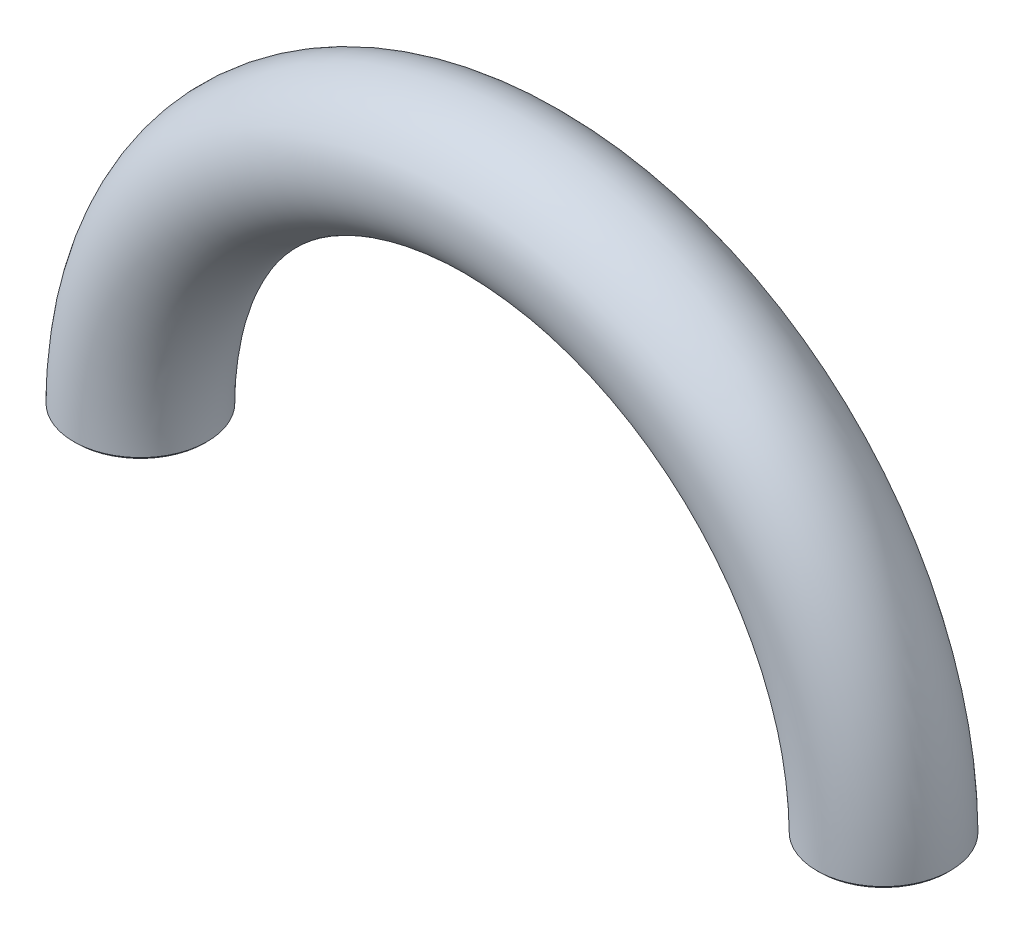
ISO-10303-21;
HEADER;
FILE_DESCRIPTION(('STEP AP214'),'2;1');
FILE_NAME('part.step','',(''),(''),'','','');
FILE_SCHEMA(('AUTOMOTIVE_DESIGN { 1 0 10303 214 1 1 1 1 }'));
ENDSEC;
DATA;
#1=APPLICATION_CONTEXT('core data for automotive mechanical design processes');
#2=APPLICATION_PROTOCOL_DEFINITION('international standard','automotive_design',2000,#1);
#3=PRODUCT_CONTEXT('',#1,'mechanical');
#4=PRODUCT('Part','Part','',(#3));
#5=PRODUCT_RELATED_PRODUCT_CATEGORY('part','',(#4));
#6=PRODUCT_DEFINITION_FORMATION('','',#4);
#7=PRODUCT_DEFINITION_CONTEXT('part definition',#1,'design');
#8=PRODUCT_DEFINITION('design','',#6,#7);
#9=PRODUCT_DEFINITION_SHAPE('','',#8);
#10=(LENGTH_UNIT() NAMED_UNIT(*) SI_UNIT(.MILLI.,.METRE.));
#11=(NAMED_UNIT(*) PLANE_ANGLE_UNIT() SI_UNIT($,.RADIAN.));
#12=(NAMED_UNIT(*) SI_UNIT($,.STERADIAN.) SOLID_ANGLE_UNIT());
#13=UNCERTAINTY_MEASURE_WITH_UNIT(LENGTH_MEASURE(1.E-05),#10,'distance_accuracy_value','');
#14=(GEOMETRIC_REPRESENTATION_CONTEXT(3) GLOBAL_UNCERTAINTY_ASSIGNED_CONTEXT((#13)) GLOBAL_UNIT_ASSIGNED_CONTEXT((#10,
#11,#12)) REPRESENTATION_CONTEXT('',''));
#15=CARTESIAN_POINT('',(0.,0.,0.));
#16=DIRECTION('',(0.,0.,1.));
#17=DIRECTION('',(1.,0.,0.));
#18=AXIS2_PLACEMENT_3D('',#15,#16,#17);
#19=CARTESIAN_POINT('',(0.,0.,0.));
#20=DIRECTION('',(0.,0.,1.));
#21=DIRECTION('',(1.,0.,0.));
#22=AXIS2_PLACEMENT_3D('',#19,#20,#21);
#23=TOROIDAL_SURFACE('',#22,609.6,109.5375);
#24=CARTESIAN_POINT('',(-609.600590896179,4.23333743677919,109.537498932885));
#25=CARTESIAN_POINT('',(-610.819509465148,4.23366457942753,109.537659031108));
#26=CARTESIAN_POINT('',(-612.038405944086,4.23398977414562,109.516992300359));
#27=CARTESIAN_POINT('',(-614.480014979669,4.23463744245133,109.434508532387));
#28=CARTESIAN_POINT('',(-615.702721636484,4.23495989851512,109.37251634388));
#29=CARTESIAN_POINT('',(-618.148015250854,4.2356011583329,109.207717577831));
#30=CARTESIAN_POINT('',(-619.370596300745,4.23591995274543,109.104823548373));
#31=CARTESIAN_POINT('',(-621.811705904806,4.23655294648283,108.858423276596));
#32=CARTESIAN_POINT('',(-623.030234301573,4.2368671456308,108.714915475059));
#33=CARTESIAN_POINT('',(-625.459326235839,4.23749002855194,108.387671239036));
#34=CARTESIAN_POINT('',(-626.669901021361,4.23779872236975,108.204018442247));
#35=CARTESIAN_POINT('',(-629.079091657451,4.23840959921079,107.796276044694));
#36=CARTESIAN_POINT('',(-630.2777362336,4.23871180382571,107.57235623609));
#37=CARTESIAN_POINT('',(-632.663100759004,4.23930992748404,107.085375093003));
#38=CARTESIAN_POINT('',(-633.849846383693,4.23960586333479,106.822439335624));
#39=CARTESIAN_POINT('',(-636.212871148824,4.24019202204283,106.257898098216));
#40=CARTESIAN_POINT('',(-637.389159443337,4.24048225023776,105.95633094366));
#41=CARTESIAN_POINT('',(-639.731180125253,4.24105707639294,105.314188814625));
#42=CARTESIAN_POINT('',(-640.896911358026,4.24134167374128,104.973609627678));
#43=CARTESIAN_POINT('',(-643.217797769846,4.24190536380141,104.253387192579));
#44=CARTESIAN_POINT('',(-644.372938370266,4.24218444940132,103.873696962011));
#45=CARTESIAN_POINT('',(-646.672581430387,4.24273722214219,103.075058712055));
#46=CARTESIAN_POINT('',(-647.817052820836,4.24301089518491,102.656021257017));
#47=CARTESIAN_POINT('',(-650.095462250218,4.2435529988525,101.778744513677));
#48=CARTESIAN_POINT('',(-651.22934959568,4.24382140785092,101.320373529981));
#49=CARTESIAN_POINT('',(-653.485593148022,4.2443528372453,100.363601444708));
#50=CARTESIAN_POINT('',(-654.607883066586,4.24461583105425,99.8650440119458));
#51=CARTESIAN_POINT('',(-656.835723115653,4.24513538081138,98.8304215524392));
#52=CARTESIAN_POINT('',(-657.941264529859,4.24539193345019,98.2943377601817));
#53=CARTESIAN_POINT('',(-660.129495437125,4.24589731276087,97.1872204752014));
#54=CARTESIAN_POINT('',(-661.212255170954,4.24614616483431,96.6163258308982));
#55=CARTESIAN_POINT('',(-663.354525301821,4.24663625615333,95.4406442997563));
#56=CARTESIAN_POINT('',(-664.414101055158,4.24687751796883,94.8359764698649));
#57=CARTESIAN_POINT('',(-666.509923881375,4.24735258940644,93.5932081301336));
#58=CARTESIAN_POINT('',(-667.546222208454,4.24758641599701,92.9551940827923));
#59=CARTESIAN_POINT('',(-669.594449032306,4.24804653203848,91.6461697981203));
#60=CARTESIAN_POINT('',(-670.606427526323,4.24827283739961,90.9752377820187));
#61=CARTESIAN_POINT('',(-672.60774477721,4.24871849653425,89.6002888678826));
#62=CARTESIAN_POINT('',(-673.597082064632,4.24893784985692,88.8962698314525));
#63=CARTESIAN_POINT('',(-675.553144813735,4.24936975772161,87.4548383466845));
#64=CARTESIAN_POINT('',(-676.519838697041,4.24958230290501,86.7173830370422));
#65=CARTESIAN_POINT('',(-678.430097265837,4.25000062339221,85.209088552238));
#66=CARTESIAN_POINT('',(-679.373609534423,4.25020638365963,84.4381829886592));
#67=CARTESIAN_POINT('',(-681.236995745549,4.25061116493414,82.8629994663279));
#68=CARTESIAN_POINT('',(-682.156794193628,4.25081016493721,82.0586321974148));
#69=CARTESIAN_POINT('',(-683.97223506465,4.25120145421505,80.4165260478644));
#70=CARTESIAN_POINT('',(-684.867776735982,4.25139371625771,79.5786757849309));
#71=CARTESIAN_POINT('',(-686.633063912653,4.25177131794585,77.870765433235));
#72=CARTESIAN_POINT('',(-687.502719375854,4.2519566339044,77.0006122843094));
#73=CARTESIAN_POINT('',(-689.209094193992,4.25231898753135,75.2350010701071));
#74=CARTESIAN_POINT('',(-690.045926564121,4.25249605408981,74.3396522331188));
#75=CARTESIAN_POINT('',(-691.685671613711,4.25284183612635,72.5249939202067));
#76=CARTESIAN_POINT('',(-692.488708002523,4.25301058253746,71.6057962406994));
#77=CARTESIAN_POINT('',(-694.061153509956,4.25333993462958,69.7437495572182));
#78=CARTESIAN_POINT('',(-694.830655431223,4.25350056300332,68.8009789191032));
#79=CARTESIAN_POINT('',(-696.336311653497,4.25381388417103,66.8920759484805));
#80=CARTESIAN_POINT('',(-697.072526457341,4.25396659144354,65.9259913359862));
#81=CARTESIAN_POINT('',(-698.511887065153,4.25426427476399,63.9707519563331));
#82=CARTESIAN_POINT('',(-699.215060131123,4.25440925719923,62.9816172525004));
#83=CARTESIAN_POINT('',(-700.588896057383,4.2546917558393,60.9801916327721));
#84=CARTESIAN_POINT('',(-701.25954026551,4.2548292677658,59.9678879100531));
#85=CARTESIAN_POINT('',(-702.568194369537,4.25509688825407,57.9185177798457));
#86=CARTESIAN_POINT('',(-703.20611052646,4.25522697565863,56.8813915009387));
#87=CARTESIAN_POINT('',(-704.449069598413,4.25547981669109,54.7830509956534));
#88=CARTESIAN_POINT('',(-705.05399830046,4.25560254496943,53.7217691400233));
#89=CARTESIAN_POINT('',(-706.230359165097,4.25584065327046,51.5756497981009));
#90=CARTESIAN_POINT('',(-706.801658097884,4.25595600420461,50.490739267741));
#91=CARTESIAN_POINT('',(-707.908624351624,4.25617902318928,48.2999226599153));
#92=CARTESIAN_POINT('',(-708.444211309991,4.25628667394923,47.1939759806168));
#93=CARTESIAN_POINT('',(-709.477065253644,4.25649384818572,44.9668132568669));
#94=CARTESIAN_POINT('',(-709.974401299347,4.25659338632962,43.8456292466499));
#95=CARTESIAN_POINT('',(-710.928516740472,4.25678398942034,41.5922613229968));
#96=CARTESIAN_POINT('',(-711.385473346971,4.25687509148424,40.4601524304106));
#97=CARTESIAN_POINT('',(-712.260415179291,4.25704924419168,38.1846966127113));
#98=CARTESIAN_POINT('',(-712.678508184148,4.25713231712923,37.0413911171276));
#99=CARTESIAN_POINT('',(-713.475620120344,4.2572904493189,34.7434108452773));
#100=CARTESIAN_POINT('',(-713.854704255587,4.25736552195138,33.5887586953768));
#101=CARTESIAN_POINT('',(-714.573954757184,4.25750775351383,31.268186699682));
#102=CARTESIAN_POINT('',(-714.914145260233,4.25757491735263,30.1022743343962));
#103=CARTESIAN_POINT('',(-715.555646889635,4.25770140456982,27.7592374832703));
#104=CARTESIAN_POINT('',(-715.856940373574,4.25776072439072,26.5821081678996));
#105=CARTESIAN_POINT('',(-716.420859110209,4.25787163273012,24.2167328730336));
#106=CARTESIAN_POINT('',(-716.683424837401,4.25792320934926,23.0284727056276));
#107=CARTESIAN_POINT('',(-717.169735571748,4.25801866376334,20.6397835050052));
#108=CARTESIAN_POINT('',(-717.393344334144,4.2580625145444,19.4393267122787));
#109=CARTESIAN_POINT('',(-717.800786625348,4.25814235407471,17.0265442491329));
#110=CARTESIAN_POINT('',(-717.984450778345,4.25817830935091,15.8141899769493));
#111=CARTESIAN_POINT('',(-718.311466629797,4.25824228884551,13.3811210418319));
#112=CARTESIAN_POINT('',(-718.454721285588,4.25827029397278,12.1603933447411));
#113=CARTESIAN_POINT('',(-718.699932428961,4.25831821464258,9.71720123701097));
#114=CARTESIAN_POINT('',(-718.801968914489,4.2583381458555,8.49474485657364));
#115=CARTESIAN_POINT('',(-718.964567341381,4.25836989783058,6.05304605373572));
#116=CARTESIAN_POINT('',(-719.025328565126,4.25838175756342,4.83381691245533));
#117=CARTESIAN_POINT('',(-719.10567496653,4.25839743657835,2.39802492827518));
#118=CARTESIAN_POINT('',(-719.125395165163,4.25840128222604,1.18146653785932));
#119=CARTESIAN_POINT('',(-719.124377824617,4.25840108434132,-1.24986619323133));
#120=CARTESIAN_POINT('',(-719.103698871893,4.25839705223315,-2.46464056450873));
#121=CARTESIAN_POINT('',(-719.022111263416,4.25838113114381,-4.89257790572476));
#122=CARTESIAN_POINT('',(-718.961211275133,4.25836924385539,-6.10574116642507));
#123=CARTESIAN_POINT('',(-718.798981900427,4.25833756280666,-8.52992019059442));
#124=CARTESIAN_POINT('',(-718.69763399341,4.25831776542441,-9.74093471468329));
#125=CARTESIAN_POINT('',(-718.454649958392,4.25827028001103,-12.1601602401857));
#126=CARTESIAN_POINT('',(-718.312972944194,4.25824258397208,-13.3683671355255));
#127=CARTESIAN_POINT('',(-717.988871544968,4.25817917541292,-15.7827747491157));
#128=CARTESIAN_POINT('',(-717.806333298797,4.25814344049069,-16.9889601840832));
#129=CARTESIAN_POINT('',(-717.400084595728,4.25806383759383,-19.4008121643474));
#130=CARTESIAN_POINT('',(-717.17616549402,4.25801992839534,-20.6064435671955));
#131=CARTESIAN_POINT('',(-716.687311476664,4.25792396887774,-23.0124167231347));
#132=CARTESIAN_POINT('',(-716.422278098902,4.25787189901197,-24.2127384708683));
#133=CARTESIAN_POINT('',(-715.852636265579,4.25775984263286,-26.601428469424));
#134=CARTESIAN_POINT('',(-715.548107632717,4.25769987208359,-27.7898157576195));
#135=CARTESIAN_POINT('',(-714.900677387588,4.25757219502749,-30.1504796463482));
#136=CARTESIAN_POINT('',(-714.557950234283,4.25750452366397,-31.3228040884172));
#137=CARTESIAN_POINT('',(-713.834579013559,4.25736147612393,-33.651680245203));
#138=CARTESIAN_POINT('',(-713.454056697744,4.25728612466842,-34.8082697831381));
#139=CARTESIAN_POINT('',(-712.65534955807,4.25712769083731,-37.1064032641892));
#140=CARTESIAN_POINT('',(-712.237222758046,4.25704462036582,-38.2479673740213));
#141=CARTESIAN_POINT('',(-711.363696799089,4.2568707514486,-40.515290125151));
#142=CARTESIAN_POINT('',(-710.908339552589,4.25677996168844,-41.6410649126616));
#143=CARTESIAN_POINT('',(-709.960052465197,4.25659051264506,-43.8775696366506));
#144=CARTESIAN_POINT('',(-709.467097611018,4.25649184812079,-44.9882889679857));
#145=CARTESIAN_POINT('',(-708.443724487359,4.25628657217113,-47.1943672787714));
#146=CARTESIAN_POINT('',(-707.913250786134,4.25617994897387,-48.2897005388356));
#147=CARTESIAN_POINT('',(-706.815164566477,4.25595872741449,-50.4643592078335));
#148=CARTESIAN_POINT('',(-706.247479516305,4.25584411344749,-51.543648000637));
#149=CARTESIAN_POINT('',(-705.073161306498,4.25560643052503,-53.6879189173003));
#150=CARTESIAN_POINT('',(-704.466345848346,4.2554833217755,-54.7528012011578));
#151=CARTESIAN_POINT('',(-703.215909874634,4.2552289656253,-56.8645609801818));
#152=CARTESIAN_POINT('',(-702.572195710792,4.25509769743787,-57.9113830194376));
#153=CARTESIAN_POINT('',(-701.250720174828,4.25482745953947,-59.9812131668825));
#154=CARTESIAN_POINT('',(-700.573008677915,4.25468850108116,-61.0042531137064));
#155=CARTESIAN_POINT('',(-699.186695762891,4.25440341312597,-63.0226290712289));
#156=CARTESIAN_POINT('',(-698.478241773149,4.25425731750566,-64.0180663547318));
#157=CARTESIAN_POINT('',(-697.030800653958,4.25395790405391,-65.9813681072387));
#158=CARTESIAN_POINT('',(-696.291923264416,4.25380461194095,-66.9493134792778));
#159=CARTESIAN_POINT('',(-694.783639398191,4.25349068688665,-68.8583651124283));
#160=CARTESIAN_POINT('',(-694.014288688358,4.25333006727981,-69.7995154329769));
#161=CARTESIAN_POINT('',(-692.444957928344,4.25300132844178,-71.6551217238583));
#162=CARTESIAN_POINT('',(-691.644993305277,4.25283321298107,-72.5695907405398));
#163=CARTESIAN_POINT('',(-690.015253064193,4.25248952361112,-74.371382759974));
#164=CARTESIAN_POINT('',(-689.185480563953,4.25231395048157,-75.2587085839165));
#165=CARTESIAN_POINT('',(-687.49647580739,4.25195529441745,-77.0063942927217));
#166=CARTESIAN_POINT('',(-686.637218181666,4.25177220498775,-77.8667296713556));
#167=CARTESIAN_POINT('',(-684.8859593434,4.2513976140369,-79.5615342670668));
#168=CARTESIAN_POINT('',(-683.993826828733,4.25120607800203,-80.3958678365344));
#169=CARTESIAN_POINT('',(-682.179241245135,4.25081497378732,-82.0370374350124));
#170=CARTESIAN_POINT('',(-681.256697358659,4.25061538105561,-82.8437729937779));
#171=CARTESIAN_POINT('',(-679.384103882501,4.25020861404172,-84.427141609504));
#172=CARTESIAN_POINT('',(-678.434020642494,4.25000143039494,-85.2037348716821));
#173=CARTESIAN_POINT('',(-676.509239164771,4.24957995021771,-86.7242694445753));
#174=CARTESIAN_POINT('',(-675.534560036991,4.24936565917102,-87.4682349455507));
#175=CARTESIAN_POINT('',(-673.563470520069,4.24893043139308,-88.9209702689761));
#176=CARTESIAN_POINT('',(-672.567127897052,4.24870951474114,-89.6298319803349));
#177=CARTESIAN_POINT('',(-670.554850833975,4.2482613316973,-91.010210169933));
#178=CARTESIAN_POINT('',(-669.539012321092,4.24803409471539,-91.6818665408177));
#179=CARTESIAN_POINT('',(-667.487920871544,4.247573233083,-92.9901511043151));
#180=CARTESIAN_POINT('',(-666.452711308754,4.24733962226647,-93.6268473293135));
#181=CARTESIAN_POINT('',(-664.362478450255,4.24686575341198,-94.865005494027));
#182=CARTESIAN_POINT('',(-663.307470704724,4.24662550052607,-95.4664936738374));
#183=CARTESIAN_POINT('',(-661.177662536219,4.24613819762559,-96.634233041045));
#184=CARTESIAN_POINT('',(-660.102855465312,4.24589114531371,-97.2004721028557));
#185=CARTESIAN_POINT('',(-657.933394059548,4.24539007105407,-98.2976029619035));
#186=CARTESIAN_POINT('',(-656.838713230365,4.24513603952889,-98.8284423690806));
#187=CARTESIAN_POINT('',(-654.629502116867,4.24462085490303,-99.8547711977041));
#188=CARTESIAN_POINT('',(-653.514928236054,4.24435968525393,-100.350166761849));
#189=CARTESIAN_POINT('',(-651.265317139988,4.24382990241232,-101.305488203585));
#190=CARTESIAN_POINT('',(-650.130215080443,4.24356126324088,-101.765261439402));
#191=CARTESIAN_POINT('',(-647.84131383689,4.24301674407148,-102.647667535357));
#192=CARTESIAN_POINT('',(-646.68746488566,4.242740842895,-103.070171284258));
#193=CARTESIAN_POINT('',(-644.367458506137,4.24218320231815,-103.875948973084));
#194=CARTESIAN_POINT('',(-643.201314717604,4.24190146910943,-104.259262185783));
#195=CARTESIAN_POINT('',(-640.86140746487,4.24133313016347,-104.984825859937));
#196=CARTESIAN_POINT('',(-639.687692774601,4.24104654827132,-105.327233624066));
#197=CARTESIAN_POINT('',(-637.333053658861,4.24046854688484,-105.971892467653));
#198=CARTESIAN_POINT('',(-636.152161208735,4.24017714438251,-106.274260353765));
#199=CARTESIAN_POINT('',(-633.784169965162,4.23958961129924,-106.838396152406));
#200=CARTESIAN_POINT('',(-632.597097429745,4.23929349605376,-107.100274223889));
#201=CARTESIAN_POINT('',(-630.216776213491,4.2386964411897,-107.583865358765));
#202=CARTESIAN_POINT('',(-629.023540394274,4.23839551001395,-107.80564178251));
#203=CARTESIAN_POINT('',(-626.629689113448,4.23778845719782,-108.209910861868));
#204=CARTESIAN_POINT('',(-625.42906961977,4.23748233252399,-108.392379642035));
#205=CARTESIAN_POINT('',(-623.020565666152,4.23686478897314,-108.717497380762));
#206=CARTESIAN_POINT('',(-621.812672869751,4.23655336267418,-108.86008463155));
#207=CARTESIAN_POINT('',(-619.38980759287,4.23592514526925,-109.10515230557));
#208=CARTESIAN_POINT('',(-618.174824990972,4.23560834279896,-109.207532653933));
#209=CARTESIAN_POINT('',(-615.737949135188,4.23496929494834,-109.371847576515));
#210=CARTESIAN_POINT('',(-614.516046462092,4.23464703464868,-109.433642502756));
#211=CARTESIAN_POINT('',(-612.065501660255,4.23399699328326,-109.516409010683));
#212=CARTESIAN_POINT('',(-610.836853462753,4.2336691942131,-109.537200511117));
#213=CARTESIAN_POINT('',(-608.378636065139,4.23300951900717,-109.537794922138));
#214=CARTESIAN_POINT('',(-607.149066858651,4.23267764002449,-109.517567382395));
#215=CARTESIAN_POINT('',(-604.694523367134,4.23201122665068,-109.43593437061));
#216=CARTESIAN_POINT('',(-603.469545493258,4.23167670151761,-109.374637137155));
#217=CARTESIAN_POINT('',(-601.023903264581,4.23100489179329,-109.210843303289));
#218=CARTESIAN_POINT('',(-599.803235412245,4.23066761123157,-109.108398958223));
#219=CARTESIAN_POINT('',(-597.365923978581,4.22999018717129,-108.862358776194));
#220=CARTESIAN_POINT('',(-596.149280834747,4.22965004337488,-108.718758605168));
#221=CARTESIAN_POINT('',(-593.719732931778,4.22896678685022,-108.390404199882));
#222=CARTESIAN_POINT('',(-592.506836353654,4.22862367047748,-108.205589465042));
#223=CARTESIAN_POINT('',(-590.084547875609,4.22793438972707,-107.794951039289));
#224=CARTESIAN_POINT('',(-588.875175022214,4.22758821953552,-107.569015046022));
#225=CARTESIAN_POINT('',(-586.466146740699,4.22689456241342,-107.077076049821));
#226=CARTESIAN_POINT('',(-585.266481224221,4.22654707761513,-106.811122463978));
#227=CARTESIAN_POINT('',(-582.881245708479,4.22585210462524,-106.240012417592));
#228=CARTESIAN_POINT('',(-581.695639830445,4.22550462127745,-105.93500583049));
#229=CARTESIAN_POINT('',(-579.338961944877,4.22480987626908,-105.286363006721));
#230=CARTESIAN_POINT('',(-578.167856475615,4.2244626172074,-104.942848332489));
#231=CARTESIAN_POINT('',(-575.840623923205,4.22376854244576,-104.217709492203));
#232=CARTESIAN_POINT('',(-574.684467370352,4.22342172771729,-103.836179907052));
#233=CARTESIAN_POINT('',(-572.387590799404,4.22272876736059,-103.035503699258));
#234=CARTESIAN_POINT('',(-571.24684674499,4.22238262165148,-102.616426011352));
#235=CARTESIAN_POINT('',(-568.981080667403,4.22169117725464,-101.741262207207));
#236=CARTESIAN_POINT('',(-567.85604277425,4.22134587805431,-101.285217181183));
#237=CARTESIAN_POINT('',(-565.620342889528,4.22065577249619,-100.335177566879));
#238=CARTESIAN_POINT('',(-564.509701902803,4.22031096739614,-99.8411335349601));
#239=CARTESIAN_POINT('',(-562.303179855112,4.21962209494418,-98.8152093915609));
#240=CARTESIAN_POINT('',(-561.207335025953,4.21927803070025,-98.2832513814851));
#241=CARTESIAN_POINT('',(-559.031391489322,4.218591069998,-97.1820729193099));
#242=CARTESIAN_POINT('',(-557.951334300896,4.21824817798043,-96.6127704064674));
#243=CARTESIAN_POINT('',(-555.805966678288,4.21756329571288,-95.4353587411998));
#244=CARTESIAN_POINT('',(-554.740749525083,4.21722131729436,-94.8270796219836));
#245=CARTESIAN_POINT('',(-552.62907973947,4.21653972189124,-93.5740696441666));
#246=CARTESIAN_POINT('',(-551.582669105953,4.21620011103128,-92.9292680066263));
#247=CARTESIAN_POINT('',(-549.51451827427,4.21552525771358,-91.6060025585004));
#248=CARTESIAN_POINT('',(-548.49272990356,4.21519000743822,-90.927614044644));
#249=CARTESIAN_POINT('',(-546.476574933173,4.21452502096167,-89.5398951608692));
#250=CARTESIAN_POINT('',(-545.482112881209,4.21419526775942,-88.8307034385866));
#251=CARTESIAN_POINT('',(-543.520582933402,4.21354150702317,-87.3817628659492));
#252=CARTESIAN_POINT('',(-542.553438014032,4.21321748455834,-86.6421183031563));
#253=CARTESIAN_POINT('',(-540.646358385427,4.21257535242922,-85.1324614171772));
#254=CARTESIAN_POINT('',(-539.706372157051,4.21225723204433,-84.3625141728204));
#255=CARTESIAN_POINT('',(-537.853396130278,4.2116270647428,-82.7924664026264));
#256=CARTESIAN_POINT('',(-536.940382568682,4.2113150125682,-81.9923939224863));
#257=CARTESIAN_POINT('',(-535.141185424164,4.21069715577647,-80.362266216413));
#258=CARTESIAN_POINT('',(-534.255007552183,4.21039135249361,-79.5322046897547));
#259=CARTESIAN_POINT('',(-532.508691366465,4.2097859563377,-77.8419682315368));
#260=CARTESIAN_POINT('',(-531.648603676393,4.20948637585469,-76.9817409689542));
#261=CARTESIAN_POINT('',(-529.954252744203,4.20889348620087,-75.2282072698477));
#262=CARTESIAN_POINT('',(-529.120133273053,4.20860021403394,-74.334761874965));
#263=CARTESIAN_POINT('',(-527.479562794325,4.20802087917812,-72.5175873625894));
#264=CARTESIAN_POINT('',(-526.673209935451,4.20773484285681,-71.5937696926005));
#265=CARTESIAN_POINT('',(-525.090887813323,4.20717119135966,-69.7188802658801));
#266=CARTESIAN_POINT('',(-524.314949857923,4.20689358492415,-68.7677820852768));
#267=CARTESIAN_POINT('',(-522.796109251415,4.20634799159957,-66.8414476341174));
#268=CARTESIAN_POINT('',(-522.053167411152,4.20607999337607,-65.8662422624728));
#269=CARTESIAN_POINT('',(-520.602965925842,4.20555481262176,-63.894800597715));
#270=CARTESIAN_POINT('',(-519.89559235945,4.20529759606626,-62.8986481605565));
#271=CARTESIAN_POINT('',(-518.518575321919,4.20479495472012,-60.8873635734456));
#272=CARTESIAN_POINT('',(-517.84877257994,4.20454948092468,-59.8723404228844));
#273=CARTESIAN_POINT('',(-516.543739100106,4.20406955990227,-57.8225038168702));
#274=CARTESIAN_POINT('',(-515.908456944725,4.20383509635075,-56.7877230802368));
#275=CARTESIAN_POINT('',(-514.672686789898,4.20337748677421,-54.6977809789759));
#276=CARTESIAN_POINT('',(-514.072193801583,4.20315433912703,-53.6426225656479));
#277=CARTESIAN_POINT('',(-512.906073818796,4.20271962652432,-51.5118759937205));
#278=CARTESIAN_POINT('',(-512.34048138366,4.20250807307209,-50.436268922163));
#279=CARTESIAN_POINT('',(-511.244344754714,4.20209684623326,-48.2644974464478));
#280=CARTESIAN_POINT('',(-510.713876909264,4.20189719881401,-47.1682945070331));
#281=CARTESIAN_POINT('',(-509.688074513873,4.20151004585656,-44.9552515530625));
#282=CARTESIAN_POINT('',(-509.192859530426,4.2013225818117,-43.8383561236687));
#283=CARTESIAN_POINT('',(-508.238034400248,4.20096020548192,-41.5840015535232));
#284=CARTESIAN_POINT('',(-507.778579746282,4.2007853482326,-40.4464765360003));
#285=CARTESIAN_POINT('',(-506.897513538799,4.20044924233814,-38.1544100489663));
#286=CARTESIAN_POINT('',(-506.475974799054,4.20028801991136,-36.9998405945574));
#287=CARTESIAN_POINT('',(-505.672731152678,4.19998013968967,-34.6800197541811));
#288=CARTESIAN_POINT('',(-505.290933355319,4.19983344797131,-33.5148005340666));
#289=CARTESIAN_POINT('',(-504.56857209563,4.19955536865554,-31.1774167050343));
#290=CARTESIAN_POINT('',(-504.227830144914,4.19942391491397,-30.0053072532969));
#291=CARTESIAN_POINT('',(-503.586131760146,4.19917593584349,-27.6530147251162));
#292=CARTESIAN_POINT('',(-503.285089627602,4.19905937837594,-26.4728550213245));
#293=CARTESIAN_POINT('',(-502.723285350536,4.19884152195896,-24.1057211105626));
#294=CARTESIAN_POINT('',(-502.462436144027,4.19874019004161,-22.9187675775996));
#295=CARTESIAN_POINT('',(-501.980762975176,4.19855286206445,-20.538053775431));
#296=CARTESIAN_POINT('',(-501.75989774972,4.19846685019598,-19.3443018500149));
#297=CARTESIAN_POINT('',(-501.357488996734,4.19831000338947,-16.9486583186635));
#298=CARTESIAN_POINT('',(-501.175994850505,4.19823918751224,-15.7467584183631));
#299=CARTESIAN_POINT('',(-500.852826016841,4.19811297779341,-13.3353518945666));
#300=CARTESIAN_POINT('',(-500.711225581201,4.19805761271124,-12.1258353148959));
#301=CARTESIAN_POINT('',(-500.468183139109,4.19796250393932,-9.6997883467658));
#302=CARTESIAN_POINT('',(-500.366840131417,4.1979227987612,-8.48324804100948));
#303=CARTESIAN_POINT('',(-500.2046825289,4.19785921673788,-6.04373598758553));
#304=CARTESIAN_POINT('',(-500.143992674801,4.19783538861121,-4.82075594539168));
#305=CARTESIAN_POINT('',(-500.063547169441,4.19780378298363,-2.36894805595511));
#306=CARTESIAN_POINT('',(-500.043942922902,4.19779606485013,-1.14011524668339));
#307=CARTESIAN_POINT('',(-500.045888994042,4.19779682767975,1.31662390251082));
#308=CARTESIAN_POINT('',(-500.067409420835,4.19780529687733,2.54453026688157));
#309=CARTESIAN_POINT('',(-500.151491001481,4.197838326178,4.993111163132));
#310=CARTESIAN_POINT('',(-500.213857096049,4.19786280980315,6.21379238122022));
#311=CARTESIAN_POINT('',(-500.379280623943,4.19792766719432,8.6480423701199));
#312=CARTESIAN_POINT('',(-500.482192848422,4.19796798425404,9.86162100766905));
#313=CARTESIAN_POINT('',(-500.728287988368,4.19806428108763,12.2817945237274));
#314=CARTESIAN_POINT('',(-500.871375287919,4.19812022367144,13.4883991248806));
#315=CARTESIAN_POINT('',(-501.197495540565,4.19824757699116,15.8947400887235));
#316=CARTESIAN_POINT('',(-501.380481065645,4.19831896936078,17.0944828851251));
#317=CARTESIAN_POINT('',(-501.785768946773,4.19847692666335,19.4872937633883));
#318=CARTESIAN_POINT('',(-502.008070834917,4.19856349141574,20.6803619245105));
#319=CARTESIAN_POINT('',(-502.492764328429,4.19875197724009,23.0608225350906));
#320=CARTESIAN_POINT('',(-502.755235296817,4.19885392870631,24.248198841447));
#321=CARTESIAN_POINT('',(-503.320825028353,4.19907322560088,26.617432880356));
#322=CARTESIAN_POINT('',(-503.624077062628,4.19919062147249,27.7992587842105));
#323=CARTESIAN_POINT('',(-504.270955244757,4.19944056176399,30.1568916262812));
#324=CARTESIAN_POINT('',(-504.614738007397,4.19957316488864,31.3326555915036));
#325=CARTESIAN_POINT('',(-505.342658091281,4.19985333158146,33.6752811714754));
#326=CARTESIAN_POINT('',(-505.726907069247,4.20000093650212,34.8421080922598));
#327=CARTESIAN_POINT('',(-506.533970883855,4.20031021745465,37.1614734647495));
#328=CARTESIAN_POINT('',(-506.956759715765,4.20047188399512,38.3140209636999));
#329=CARTESIAN_POINT('',(-507.839391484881,4.20080850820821,40.5994216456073));
#330=CARTESIAN_POINT('',(-508.299075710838,4.20098340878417,41.7323361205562));
#331=CARTESIAN_POINT('',(-509.254201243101,4.20134581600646,43.9780546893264));
#332=CARTESIAN_POINT('',(-509.749504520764,4.20153327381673,45.0909175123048));
#333=CARTESIAN_POINT('',(-510.775818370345,4.20192054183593,47.297428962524));
#334=CARTESIAN_POINT('',(-511.306757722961,4.20212032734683,48.3911107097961));
#335=CARTESIAN_POINT('',(-512.404322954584,4.20253200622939,50.5591990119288));
#336=CARTESIAN_POINT('',(-512.970916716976,4.2027438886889,51.6336218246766));
#337=CARTESIAN_POINT('',(-514.139673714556,4.20317948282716,53.7631831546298));
#338=CARTESIAN_POINT('',(-514.741843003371,4.20340319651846,54.8183183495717));
#339=CARTESIAN_POINT('',(-515.981712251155,4.2038621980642,56.9092478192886));
#340=CARTESIAN_POINT('',(-516.619454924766,4.20409749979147,57.9450167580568));
#341=CARTESIAN_POINT('',(-517.930360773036,4.2045794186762,59.9975280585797));
#342=CARTESIAN_POINT('',(-518.603608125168,4.20482606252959,61.014216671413));
#343=CARTESIAN_POINT('',(-519.987218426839,4.20533094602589,63.0288799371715));
#344=CARTESIAN_POINT('',(-520.697737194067,4.20558923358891,64.0267475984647));
#345=CARTESIAN_POINT('',(-522.153769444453,4.20611637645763,66.0008596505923));
#346=CARTESIAN_POINT('',(-522.899373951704,4.20638525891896,66.9770368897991));
#347=CARTESIAN_POINT('',(-524.422784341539,4.20693230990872,68.9034807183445));
#348=CARTESIAN_POINT('',(-525.200580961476,4.20721047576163,69.853754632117));
#349=CARTESIAN_POINT('',(-526.783979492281,4.20777426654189,71.7234154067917));
#350=CARTESIAN_POINT('',(-527.589438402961,4.20805985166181,72.6429233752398));
#351=CARTESIAN_POINT('',(-529.22779976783,4.20863812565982,74.451116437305));
#352=CARTESIAN_POINT('',(-530.060592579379,4.208930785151,75.3399008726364));
#353=CARTESIAN_POINT('',(-531.753754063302,4.20952303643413,77.0876121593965));
#354=CARTESIAN_POINT('',(-532.614068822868,4.20982261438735,77.946591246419));
#355=CARTESIAN_POINT('',(-534.361986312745,4.2104283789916,79.6346992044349));
#356=CARTESIAN_POINT('',(-535.249563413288,4.21073455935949,80.4638546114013));
#357=CARTESIAN_POINT('',(-537.051960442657,4.21135328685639,82.0922264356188));
#358=CARTESIAN_POINT('',(-537.96678359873,4.21166583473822,82.8914392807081));
#359=CARTESIAN_POINT('',(-539.823487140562,4.21229701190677,84.4599037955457));
#360=CARTESIAN_POINT('',(-540.765396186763,4.21261564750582,85.2291215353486));
#361=CARTESIAN_POINT('',(-542.676217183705,4.21325875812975,86.737336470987));
#362=CARTESIAN_POINT('',(-543.645180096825,4.2135832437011,87.4762691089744));
#363=CARTESIAN_POINT('',(-545.611305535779,4.21423822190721,88.9242212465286));
#364=CARTESIAN_POINT('',(-546.6085669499,4.21456873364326,89.633106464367));
#365=CARTESIAN_POINT('',(-548.630431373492,4.21523525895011,91.0200807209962));
#366=CARTESIAN_POINT('',(-549.655131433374,4.2155712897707,91.6980282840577));
#367=CARTESIAN_POINT('',(-551.724571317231,4.21624619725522,93.0175898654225));
#368=CARTESIAN_POINT('',(-552.769263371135,4.21658506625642,93.6592787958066));
#369=CARTESIAN_POINT('',(-554.876882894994,4.21726497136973,94.9056115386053));
#370=CARTESIAN_POINT('',(-555.939756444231,4.21760599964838,95.5103465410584));
#371=CARTESIAN_POINT('',(-558.082642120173,4.21828975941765,96.6825326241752));
#372=CARTESIAN_POINT('',(-559.162608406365,4.21863248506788,97.2500675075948));
#373=CARTESIAN_POINT('',(-561.338580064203,4.21931917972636,98.3476167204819));
#374=CARTESIAN_POINT('',(-562.434546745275,4.21966314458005,98.8777077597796));
#375=CARTESIAN_POINT('',(-564.641412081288,4.22035185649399,99.900152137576));
#376=CARTESIAN_POINT('',(-565.752278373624,4.22069660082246,100.392575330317));
#377=CARTESIAN_POINT('',(-567.989007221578,4.22138676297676,101.339864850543));
#378=CARTESIAN_POINT('',(-569.11485887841,4.22173218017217,101.794756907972));
#379=CARTESIAN_POINT('',(-571.383195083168,4.22242412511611,102.667495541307));
#380=CARTESIAN_POINT('',(-572.525706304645,4.22277065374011,103.08527278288));
#381=CARTESIAN_POINT('',(-574.826069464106,4.2234643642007,103.883437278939));
#382=CARTESIAN_POINT('',(-575.98394575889,4.22381154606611,104.263754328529));
#383=CARTESIAN_POINT('',(-578.315920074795,4.22450670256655,104.986772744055));
#384=CARTESIAN_POINT('',(-579.490061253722,4.22485467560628,105.329334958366));
#385=CARTESIAN_POINT('',(-581.854463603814,4.22555129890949,105.976315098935));
#386=CARTESIAN_POINT('',(-583.044773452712,4.22589994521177,106.280555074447));
#387=CARTESIAN_POINT('',(-585.434625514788,4.22659585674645,106.849002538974));
#388=CARTESIAN_POINT('',(-586.634165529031,4.22694312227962,107.113219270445));
#389=CARTESIAN_POINT('',(-589.036693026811,4.22763452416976,107.599933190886));
#390=CARTESIAN_POINT('',(-590.239647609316,4.22797866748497,107.822592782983));
#391=CARTESIAN_POINT('',(-592.647976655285,4.2286636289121,108.226932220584));
#392=CARTESIAN_POINT('',(-593.853326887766,4.2290044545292,108.408756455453));
#393=CARTESIAN_POINT('',(-596.266618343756,4.22968285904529,108.731644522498));
#394=CARTESIAN_POINT('',(-597.474546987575,4.23002044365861,108.872802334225));
#395=CARTESIAN_POINT('',(-599.893300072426,4.23069248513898,109.114621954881));
#396=CARTESIAN_POINT('',(-601.104120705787,4.23102694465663,109.215321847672));
#397=CARTESIAN_POINT('',(-603.528364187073,4.23169271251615,109.37631850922));
#398=CARTESIAN_POINT('',(-604.741786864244,4.23202402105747,109.43661785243));
#399=CARTESIAN_POINT('',(-607.170339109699,4.23268331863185,109.517100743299));
#400=CARTESIAN_POINT('',(-608.385469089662,4.23301130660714,109.537271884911));
#401=CARTESIAN_POINT('',(-609.600590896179,4.23333743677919,109.537498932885));
#402=B_SPLINE_CURVE_WITH_KNOTS('',3,(#24,#25,#26,#27,#28,#29,#30,#31,#32,#33,#34,#35,#36,#37,
#38,#39,#40,#41,#42,#43,#44,#45,#46,#47,#48,#49,#50,#51,#52,#53,#54,#55,#56,#57,#58,#59,#60,#61,
#62,#63,#64,#65,#66,#67,#68,#69,#70,#71,#72,#73,#74,#75,#76,#77,#78,#79,#80,#81,#82,#83,#84,#85,
#86,#87,#88,#89,#90,#91,#92,#93,#94,#95,#96,#97,#98,#99,#100,#101,#102,#103,#104,#105,#106,#107,
#108,#109,#110,#111,#112,#113,#114,#115,#116,#117,#118,#119,#120,#121,#122,#123,#124,#125,#126,
#127,#128,#129,#130,#131,#132,#133,#134,#135,#136,#137,#138,#139,#140,#141,#142,#143,#144,#145,
#146,#147,#148,#149,#150,#151,#152,#153,#154,#155,#156,#157,#158,#159,#160,#161,#162,#163,#164,
#165,#166,#167,#168,#169,#170,#171,#172,#173,#174,#175,#176,#177,#178,#179,#180,#181,#182,#183,
#184,#185,#186,#187,#188,#189,#190,#191,#192,#193,#194,#195,#196,#197,#198,#199,#200,#201,#202,
#203,#204,#205,#206,#207,#208,#209,#210,#211,#212,#213,#214,#215,#216,#217,#218,#219,#220,#221,
#222,#223,#224,#225,#226,#227,#228,#229,#230,#231,#232,#233,#234,#235,#236,#237,#238,#239,#240,
#241,#242,#243,#244,#245,#246,#247,#248,#249,#250,#251,#252,#253,#254,#255,#256,#257,#258,#259,
#260,#261,#262,#263,#264,#265,#266,#267,#268,#269,#270,#271,#272,#273,#274,#275,#276,#277,#278,
#279,#280,#281,#282,#283,#284,#285,#286,#287,#288,#289,#290,#291,#292,#293,#294,#295,#296,#297,
#298,#299,#300,#301,#302,#303,#304,#305,#306,#307,#308,#309,#310,#311,#312,#313,#314,#315,#316,
#317,#318,#319,#320,#321,#322,#323,#324,#325,#326,#327,#328,#329,#330,#331,#332,#333,#334,#335,
#336,#337,#338,#339,#340,#341,#342,#343,#344,#345,#346,#347,#348,#349,#350,#351,#352,#353,#354,
#355,#356,#357,#358,#359,#360,#361,#362,#363,#364,#365,#366,#367,#368,#369,#370,#371,#372,#373,
#374,#375,#376,#377,#378,#379,#380,#381,#382,#383,#384,#385,#386,#387,#388,#389,#390,#391,#392,
#393,#394,#395,#396,#397,#398,#399,#400,#401),.UNSPECIFIED.,.F.,.F.,(4,2,2,2,2,2,2,2,2,2,2,2,2,
2,2,2,2,2,2,2,2,2,2,2,2,2,2,2,2,2,2,2,2,2,2,2,2,2,2,2,2,2,2,2,2,2,2,2,2,2,2,2,2,2,2,2,2,2,2,2,2,
2,2,2,2,2,2,2,2,2,2,2,2,2,2,2,2,2,2,2,2,2,2,2,2,2,2,2,2,2,2,2,2,2,2,2,2,2,2,2,2,2,2,2,2,2,2,2,2,
2,2,2,2,2,2,2,2,2,2,2,2,2,2,2,2,2,2,2,2,2,2,2,2,2,2,2,2,2,2,2,2,2,2,2,2,2,2,2,2,2,2,2,2,2,2,2,2,
2,2,2,2,2,2,2,2,2,2,2,2,2,2,2,2,2,2,2,2,2,2,2,2,2,2,2,2,2,2,2,4),(0.,3.65654148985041,
7.3286800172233,11.0087125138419,14.688886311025,18.3614647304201,22.0189055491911,
25.6648200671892,29.3071451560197,32.9498639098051,36.5970106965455,40.2526578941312,
43.9210617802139,47.604497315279,51.2897881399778,54.9612356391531,58.6204703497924,
62.2706471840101,65.9125348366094,69.5546581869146,73.2015901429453,76.8561246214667,
80.5211326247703,84.1995568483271,87.8895561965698,91.5654752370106,95.226498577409,
98.8766470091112,102.519869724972,106.160031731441,109.802256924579,113.454390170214,
117.118455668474,120.79617573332,124.481910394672,128.160826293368,131.82269907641,
135.474093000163,139.11928088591,142.762194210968,146.406754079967,150.056858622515,
153.719483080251,157.397347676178,161.083970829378,164.763404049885,168.424943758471,
172.074418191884,175.718604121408,179.362004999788,183.007076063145,186.655855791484,
190.314932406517,193.992988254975,197.679992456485,201.359657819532,205.023157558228,
208.675216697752,212.321734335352,215.964201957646,219.609114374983,223.259529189,
226.917284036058,230.59352023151,234.279539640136,237.960301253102,241.625028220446,
245.277529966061,248.923631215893,252.567918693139,256.211826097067,259.85895151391,
263.522687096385,267.198584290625,270.879179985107,274.556999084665,278.224618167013,
281.877351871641,285.522705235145,289.165306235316,292.809153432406,296.458278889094,
300.116734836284,303.790087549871,307.475703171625,311.157588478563,314.824825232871,
318.481116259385,322.127277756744,325.767627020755,329.410181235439,333.058340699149,
336.715523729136,340.385225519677,344.071008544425,347.759528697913,351.438365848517,
355.11254570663,358.787112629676,362.467109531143,366.157311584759,369.842993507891,
373.514932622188,377.175590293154,380.827357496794,384.472552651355,388.113750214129,
391.759768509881,395.413506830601,399.075561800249,402.754845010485,406.44152016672,
410.120274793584,413.783908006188,417.435896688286,421.08042979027,424.721649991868,
428.363639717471,432.012294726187,435.678462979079,439.356481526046,443.038191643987,
446.715405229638,450.379973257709,454.027604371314,457.669644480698,461.311161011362,
464.956227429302,468.608973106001,472.273569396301,475.953300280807,479.639953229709,
483.317785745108,486.97900326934,490.632183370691,494.277335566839,497.918704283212,
501.5646141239,505.2172657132,508.878844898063,512.551608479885,516.2378829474,519.921479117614,
523.587611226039,527.24073136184,530.885229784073,534.525419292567,538.16556548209,
541.81299872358,545.472655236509,549.146947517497,552.831657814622,556.513900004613,
560.181073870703,563.834732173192,567.481294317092,571.124617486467,574.768562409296,
578.416981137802,582.074477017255,585.748718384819,589.433083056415,593.11639489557,
596.782907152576,600.436175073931,604.082678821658,607.725853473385,611.369461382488,
615.017077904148,618.67210349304,622.342035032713,626.027343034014,629.704735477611,
633.372652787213,637.032001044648,640.683620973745,644.328296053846,647.970451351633,
651.619273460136,655.27480873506,658.943395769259,662.628434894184,666.312621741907,
669.982094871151,673.63838138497,677.28614921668,680.930475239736,684.57456901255,
688.219789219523),.UNSPECIFIED.);
#403=CARTESIAN_POINT('',(-609.600590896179,4.23333743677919,109.537498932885));
#404=VERTEX_POINT('',#403);
#405=EDGE_CURVE('E51',#404,#404,#402,.F.);
#406=ORIENTED_EDGE('',*,*,#405,.T.);
#407=EDGE_LOOP('',(#406));
#408=FACE_BOUND('',#407,.T.);
#409=CARTESIAN_POINT('',(609.600590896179,4.23333743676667,109.537498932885));
#410=CARTESIAN_POINT('',(608.431598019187,4.23302375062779,109.537985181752));
#411=CARTESIAN_POINT('',(607.262618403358,4.23270827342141,109.519308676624));
#412=CARTESIAN_POINT('',(604.920979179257,4.2320727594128,109.44408400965));
#413=CARTESIAN_POINT('',(603.748324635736,4.23175270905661,109.387377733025));
#414=CARTESIAN_POINT('',(601.402803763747,4.23110898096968,109.236383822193));
#415=CARTESIAN_POINT('',(600.229942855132,4.23078529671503,109.14201221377));
#416=CARTESIAN_POINT('',(597.887470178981,4.23013522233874,108.915882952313));
#417=CARTESIAN_POINT('',(596.717859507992,4.22980883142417,108.784113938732));
#418=CARTESIAN_POINT('',(594.385347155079,4.2291542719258,108.483466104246));
#419=CARTESIAN_POINT('',(593.222437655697,4.22882610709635,108.314647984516));
#420=CARTESIAN_POINT('',(590.906826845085,4.22816891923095,107.939954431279));
#421=CARTESIAN_POINT('',(589.754103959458,4.2278399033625,107.734212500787));
#422=CARTESIAN_POINT('',(587.460302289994,4.22718141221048,107.286155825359));
#423=CARTESIAN_POINT('',(586.3191960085,4.22685194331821,107.043981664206));
#424=CARTESIAN_POINT('',(584.046629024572,4.2261921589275,106.524246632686));
#425=CARTESIAN_POINT('',(582.915157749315,4.22586184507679,106.246731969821));
#426=CARTESIAN_POINT('',(580.661943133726,4.22520039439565,105.655818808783));
#427=CARTESIAN_POINT('',(579.540197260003,4.22486925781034,105.342429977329));
#428=CARTESIAN_POINT('',(577.306447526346,4.22420621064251,104.679766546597));
#429=CARTESIAN_POINT('',(576.194451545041,4.22387429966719,104.330465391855));
#430=CARTESIAN_POINT('',(573.980245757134,4.22320974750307,103.595826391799));
#431=CARTESIAN_POINT('',(572.878056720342,4.22287710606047,103.210425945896));
#432=CARTESIAN_POINT('',(570.683472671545,4.22221113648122,102.40354493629));
#433=CARTESIAN_POINT('',(569.591113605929,4.22187780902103,101.98196662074));
#434=CARTESIAN_POINT('',(567.416112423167,4.2212104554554,101.102326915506));
#435=CARTESIAN_POINT('',(566.333526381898,4.22087643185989,100.644126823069));
#436=CARTESIAN_POINT('',(564.180794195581,4.22020857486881,99.6915472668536));
#437=CARTESIAN_POINT('',(563.110690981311,4.21987474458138,99.1970707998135));
#438=CARTESIAN_POINT('',(560.988268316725,4.21920907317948,98.1747411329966));
#439=CARTESIAN_POINT('',(559.93592748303,4.21887723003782,97.6469323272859));
#440=CARTESIAN_POINT('',(557.853326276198,4.21821696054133,96.5597263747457));
#441=CARTESIAN_POINT('',(556.822991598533,4.21788852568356,96.0004715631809));
#442=CARTESIAN_POINT('',(554.783330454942,4.21723495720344,94.8509169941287));
#443=CARTESIAN_POINT('',(553.773956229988,4.21690981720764,94.2607019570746));
#444=CARTESIAN_POINT('',(551.777055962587,4.21626324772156,93.0496533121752));
#445=CARTESIAN_POINT('',(550.789483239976,4.21594181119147,92.428896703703));
#446=CARTESIAN_POINT('',(548.836636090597,4.21530293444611,91.1570994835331));
#447=CARTESIAN_POINT('',(547.871323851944,4.2149854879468,90.506116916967));
#448=CARTESIAN_POINT('',(545.961274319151,4.21435423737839,89.173647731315));
#449=CARTESIAN_POINT('',(545.016547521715,4.21404043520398,88.4921460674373));
#450=CARTESIAN_POINT('',(543.148010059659,4.21341675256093,87.0984056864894));
#451=CARTESIAN_POINT('',(542.22423006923,4.21310687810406,86.3861258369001));
#452=CARTESIAN_POINT('',(540.398007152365,4.21249135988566,84.9308575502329));
#453=CARTESIAN_POINT('',(539.495613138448,4.21218572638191,84.1878077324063));
#454=CARTESIAN_POINT('',(537.712604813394,4.21157900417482,82.6709886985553));
#455=CARTESIAN_POINT('',(536.832059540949,4.21127793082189,81.8971383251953));
#456=CARTESIAN_POINT('',(535.093191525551,4.21068064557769,80.3187087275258));
#457=CARTESIAN_POINT('',(534.234959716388,4.2103844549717,79.5140293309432));
#458=CARTESIAN_POINT('',(532.54219894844,4.20979760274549,77.8749996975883));
#459=CARTESIAN_POINT('',(531.707750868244,4.20950696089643,77.0405659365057));
#460=CARTESIAN_POINT('',(530.069133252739,4.20893374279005,75.3483818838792));
#461=CARTESIAN_POINT('',(529.264864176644,4.20865114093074,74.4907279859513));
#462=CARTESIAN_POINT('',(527.687525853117,4.2080945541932,72.753343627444));
#463=CARTESIAN_POINT('',(526.914346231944,4.20782053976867,71.8737133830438));
#464=CARTESIAN_POINT('',(525.398941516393,4.20728128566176,70.0926559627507));
#465=CARTESIAN_POINT('',(524.656631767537,4.20701602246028,69.1913008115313));
#466=CARTESIAN_POINT('',(523.20271946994,4.20649442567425,67.3670656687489));
#467=CARTESIAN_POINT('',(522.491059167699,4.20623807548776,66.444231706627));
#468=CARTESIAN_POINT('',(521.098248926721,4.20573447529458,64.577277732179));
#469=CARTESIAN_POINT('',(520.417068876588,4.20548721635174,63.6331801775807));
#470=CARTESIAN_POINT('',(519.084726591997,4.20500187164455,61.7239361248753));
#471=CARTESIAN_POINT('',(518.433566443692,4.20476378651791,60.7587881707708));
#472=CARTESIAN_POINT('',(517.161193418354,4.20429695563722,58.8058784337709));
#473=CARTESIAN_POINT('',(516.540050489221,4.20406823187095,57.8180710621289));
#474=CARTESIAN_POINT('',(515.327951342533,4.20362042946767,55.8200763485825));
#475=CARTESIAN_POINT('',(514.737090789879,4.20340138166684,54.8098309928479));
#476=CARTESIAN_POINT('',(513.585878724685,4.20297327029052,52.7676067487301));
#477=CARTESIAN_POINT('',(513.025636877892,4.20276424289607,51.7355660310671));
#478=CARTESIAN_POINT('',(511.937025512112,4.2023568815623,49.6505362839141));
#479=CARTESIAN_POINT('',(511.408765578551,4.20215858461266,48.5974900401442));
#480=CARTESIAN_POINT('',(510.386269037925,4.20177370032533,46.4750154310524));
#481=CARTESIAN_POINT('',(509.892032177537,4.20158711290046,45.4055871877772));
#482=CARTESIAN_POINT('',(508.940412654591,4.20122689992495,43.2552079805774));
#483=CARTESIAN_POINT('',(508.482899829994,4.20105322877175,42.1743146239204));
#484=CARTESIAN_POINT('',(507.604387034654,4.20071898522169,40.0025505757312));
#485=CARTESIAN_POINT('',(507.183255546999,4.20055836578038,38.911733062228));
#486=CARTESIAN_POINT('',(506.376896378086,4.20025015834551,36.7196595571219));
#487=CARTESIAN_POINT('',(505.991590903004,4.20010254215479,35.6184321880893));
#488=CARTESIAN_POINT('',(505.256874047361,4.19982048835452,33.4055779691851));
#489=CARTESIAN_POINT('',(504.907418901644,4.1996860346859,32.2939656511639));
#490=CARTESIAN_POINT('',(504.244291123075,4.19943041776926,30.0604118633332));
#491=CARTESIAN_POINT('',(503.930609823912,4.19930925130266,28.9384729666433));
#492=CARTESIAN_POINT('',(503.339015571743,4.19908035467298,26.6843111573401));
#493=CARTESIAN_POINT('',(503.061129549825,4.19897263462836,25.5520811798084));
#494=CARTESIAN_POINT('',(502.540813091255,4.19877066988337,23.2774138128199));
#495=CARTESIAN_POINT('',(502.298445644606,4.19867644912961,22.1349620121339));
#496=CARTESIAN_POINT('',(501.849726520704,4.19850182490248,19.838399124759));
#497=CARTESIAN_POINT('',(501.643518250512,4.19842147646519,18.6842599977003));
#498=CARTESIAN_POINT('',(501.267720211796,4.19827490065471,16.3656790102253));
#499=CARTESIAN_POINT('',(501.098267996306,4.19820872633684,15.2012148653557));
#500=CARTESIAN_POINT('',(500.796601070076,4.19809082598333,12.8650064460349));
#501=CARTESIAN_POINT('',(500.664464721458,4.19803913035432,11.6932520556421));
#502=CARTESIAN_POINT('',(500.438257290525,4.19795059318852,9.34921259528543));
#503=CARTESIAN_POINT('',(500.344086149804,4.19791371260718,8.17693718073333));
#504=CARTESIAN_POINT('',(500.193894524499,4.19785486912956,5.83533018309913));
#505=CARTESIAN_POINT('',(500.137701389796,4.19783283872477,4.66600968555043));
#506=CARTESIAN_POINT('',(500.063173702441,4.19780361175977,2.32981011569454));
#507=CARTESIAN_POINT('',(500.044721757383,4.19779636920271,1.16293478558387));
#508=CARTESIAN_POINT('',(500.04503895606,4.19779649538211,-1.16917338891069));
#509=CARTESIAN_POINT('',(500.063756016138,4.19780384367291,-2.3344062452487));
#510=CARTESIAN_POINT('',(500.138201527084,4.19783303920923,-4.66339670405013));
#511=CARTESIAN_POINT('',(500.193920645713,4.19785488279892,-5.82715460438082));
#512=CARTESIAN_POINT('',(500.342540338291,4.19791310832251,-8.15272698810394));
#513=CARTESIAN_POINT('',(500.435454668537,4.19794949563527,-9.31454059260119));
#514=CARTESIAN_POINT('',(500.658372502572,4.19803674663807,-11.6356231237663));
#515=CARTESIAN_POINT('',(500.78840817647,4.19808762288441,-12.7948889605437));
#516=CARTESIAN_POINT('',(501.085846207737,4.19820387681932,-15.1113446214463));
#517=CARTESIAN_POINT('',(501.253334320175,4.19826928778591,-16.2685234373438));
#518=CARTESIAN_POINT('',(501.626148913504,4.19841471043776,-18.582132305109));
#519=CARTESIAN_POINT('',(501.831642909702,4.1984947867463,-19.7385353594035));
#520=CARTESIAN_POINT('',(502.280524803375,4.19866947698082,-22.0486223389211));
#521=CARTESIAN_POINT('',(502.524056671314,4.19876414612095,-23.2022782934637));
#522=CARTESIAN_POINT('',(503.047999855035,4.19896749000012,-25.4998706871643));
#523=CARTESIAN_POINT('',(503.328370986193,4.19907614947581,-26.6438162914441));
#524=CARTESIAN_POINT('',(503.924692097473,4.19930683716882,-28.9181219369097));
#525=CARTESIAN_POINT('',(504.240514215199,4.1994288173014,-30.0485154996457));
#526=CARTESIAN_POINT('',(504.907115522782,4.19968577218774,-32.2938243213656));
#527=CARTESIAN_POINT('',(505.25774360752,4.1998206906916,-33.4087844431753));
#528=CARTESIAN_POINT('',(505.993760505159,4.20010328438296,-35.6251051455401));
#529=CARTESIAN_POINT('',(506.37909037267,4.20025093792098,-36.7264853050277));
#530=CARTESIAN_POINT('',(507.184213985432,4.20055871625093,-38.9149645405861));
#531=CARTESIAN_POINT('',(507.603962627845,4.20071882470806,-40.0020802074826));
#532=CARTESIAN_POINT('',(508.477776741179,4.2010512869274,-42.1619051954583));
#533=CARTESIAN_POINT('',(508.931827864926,4.2012236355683,-43.2346203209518));
#534=CARTESIAN_POINT('',(509.874560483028,4.20158049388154,-45.366325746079));
#535=CARTESIAN_POINT('',(510.363284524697,4.20176501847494,-46.4252972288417));
#536=CARTESIAN_POINT('',(511.374998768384,4.20214588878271,-48.5287344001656));
#537=CARTESIAN_POINT('',(511.898040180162,4.20234225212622,-49.5731754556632));
#538=CARTESIAN_POINT('',(512.978803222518,4.20274674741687,-51.6478169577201));
#539=CARTESIAN_POINT('',(513.536621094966,4.20295491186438,-52.6779672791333));
#540=CARTESIAN_POINT('',(514.687907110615,4.20338312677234,-54.7246364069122));
#541=CARTESIAN_POINT('',(515.28153294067,4.20360322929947,-55.7410664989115));
#542=CARTESIAN_POINT('',(516.50187564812,4.20405414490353,-57.7558546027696));
#543=CARTESIAN_POINT('',(517.128638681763,4.2042849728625,-58.7541846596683));
#544=CARTESIAN_POINT('',(518.412749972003,4.20475616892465,-60.7276756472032));
#545=CARTESIAN_POINT('',(519.070023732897,4.20499651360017,-61.7028850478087));
#546=CARTESIAN_POINT('',(520.412657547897,4.20548562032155,-63.6276192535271));
#547=CARTESIAN_POINT('',(521.097886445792,4.20573434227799,-64.577235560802));
#548=CARTESIAN_POINT('',(522.496444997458,4.20623999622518,-66.4511846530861));
#549=CARTESIAN_POINT('',(523.209685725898,4.20649690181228,-67.3755838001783));
#550=CARTESIAN_POINT('',(524.664269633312,4.20701871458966,-69.1997777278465));
#551=CARTESIAN_POINT('',(525.405569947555,4.2072836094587,-70.0996066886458));
#552=CARTESIAN_POINT('',(526.916312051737,4.20782118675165,-71.8746718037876));
#553=CARTESIAN_POINT('',(527.685741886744,4.20809386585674,-72.7499181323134));
#554=CARTESIAN_POINT('',(529.251964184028,4.20864654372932,-74.4754006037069));
#555=CARTESIAN_POINT('',(530.048753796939,4.20892654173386,-75.3256393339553));
#556=CARTESIAN_POINT('',(531.669409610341,4.20949356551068,-77.0012875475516));
#557=CARTESIAN_POINT('',(532.493297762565,4.20978059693,-77.8266758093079));
#558=CARTESIAN_POINT('',(534.171259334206,4.2103624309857,-79.4537086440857));
#559=CARTESIAN_POINT('',(535.025449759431,4.21065726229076,-80.2552325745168));
#560=CARTESIAN_POINT('',(536.761907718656,4.21125381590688,-81.8331330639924));
#561=CARTESIAN_POINT('',(537.644258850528,4.21155555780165,-82.6094175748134));
#562=CARTESIAN_POINT('',(539.434558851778,4.21216488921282,-84.1345509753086));
#563=CARTESIAN_POINT('',(540.342542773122,4.21247248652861,-84.8833587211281));
#564=CARTESIAN_POINT('',(542.181578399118,4.21309247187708,-86.3512765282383));
#565=CARTESIAN_POINT('',(543.112620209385,4.21340485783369,-87.0703989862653));
#566=CARTESIAN_POINT('',(544.995183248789,4.21403335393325,-88.4767804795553));
#567=CARTESIAN_POINT('',(545.946653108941,4.21434945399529,-89.1641082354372));
#568=CARTESIAN_POINT('',(547.867962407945,4.21498442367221,-90.5044568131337));
#569=CARTESIAN_POINT('',(548.837716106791,4.2153032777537,-91.1576005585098));
#570=CARTESIAN_POINT('',(550.794971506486,4.21594351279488,-92.431239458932));
#571=CARTESIAN_POINT('',(551.782422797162,4.21626488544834,-93.0518121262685));
#572=CARTESIAN_POINT('',(553.775483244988,4.21691017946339,-94.260614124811));
#573=CARTESIAN_POINT('',(554.781071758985,4.21723409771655,-94.8488774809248));
#574=CARTESIAN_POINT('',(556.810441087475,4.21788436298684,-95.9929736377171));
#575=CARTESIAN_POINT('',(557.834220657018,4.21821070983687,-96.5488086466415));
#576=CARTESIAN_POINT('',(559.899992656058,4.21886571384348,-97.628003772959));
#577=CARTESIAN_POINT('',(560.94200143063,4.21919437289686,-98.1513326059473));
#578=CARTESIAN_POINT('',(563.044283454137,4.21985388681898,-99.1653979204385));
#579=CARTESIAN_POINT('',(564.104588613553,4.22018474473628,-99.6560682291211));
#580=CARTESIAN_POINT('',(566.243495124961,4.22084855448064,-100.604993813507));
#581=CARTESIAN_POINT('',(567.322142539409,4.22118150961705,-101.063145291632));
#582=CARTESIAN_POINT('',(569.498488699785,4.22184955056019,-101.946155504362));
#583=CARTESIAN_POINT('',(570.59625021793,4.22218463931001,-102.370859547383));
#584=CARTESIAN_POINT('',(572.806427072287,4.2228555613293,-103.185407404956));
#585=CARTESIAN_POINT('',(573.918861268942,4.22319139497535,-103.575200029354));
#586=CARTESIAN_POINT('',(576.152877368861,4.22386204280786,-104.317651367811));
#587=CARTESIAN_POINT('',(577.274428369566,4.22419685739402,-104.670403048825));
#588=CARTESIAN_POINT('',(579.524272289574,4.22486473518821,-105.338493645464));
#589=CARTESIAN_POINT('',(580.652527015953,4.2251978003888,-105.653961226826));
#590=CARTESIAN_POINT('',(582.91536884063,4.22586207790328,-106.247849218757));
#591=CARTESIAN_POINT('',(584.04992932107,4.22619329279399,-106.526371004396));
#592=CARTESIAN_POINT('',(586.324474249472,4.22685355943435,-107.045944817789));
#593=CARTESIAN_POINT('',(587.464436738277,4.22718261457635,-107.287092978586));
#594=CARTESIAN_POINT('',(589.750424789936,4.22783878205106,-107.732854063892));
#595=CARTESIAN_POINT('',(590.896444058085,4.22816589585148,-107.937499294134));
#596=CARTESIAN_POINT('',(593.19525820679,4.2288184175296,-108.310509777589));
#597=CARTESIAN_POINT('',(594.34805753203,4.22914382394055,-108.478847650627));
#598=CARTESIAN_POINT('',(596.660303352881,4.22979288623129,-108.778859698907));
#599=CARTESIAN_POINT('',(597.819757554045,4.23011653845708,-108.91047451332));
#600=CARTESIAN_POINT('',(600.145168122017,4.23076205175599,-109.136762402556));
#601=CARTESIAN_POINT('',(601.311133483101,4.23108390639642,-109.231343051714));
#602=CARTESIAN_POINT('',(603.6494284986,4.23172578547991,-109.383270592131));
#603=CARTESIAN_POINT('',(604.821766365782,4.23204580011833,-109.44049110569));
#604=CARTESIAN_POINT('',(607.17266841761,4.23268395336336,-109.517362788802));
#605=CARTESIAN_POINT('',(608.351237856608,4.23300207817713,-109.536852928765));
#606=CARTESIAN_POINT('',(610.709257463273,4.23363503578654,-109.538119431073));
#607=CARTESIAN_POINT('',(611.888707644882,4.23394986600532,-109.519868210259));
#608=CARTESIAN_POINT('',(614.243397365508,4.23457494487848,-109.445483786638));
#609=CARTESIAN_POINT('',(615.41863995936,4.23488520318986,-109.389447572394));
#610=CARTESIAN_POINT('',(617.765156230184,4.23550128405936,-109.239473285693));
#611=CARTESIAN_POINT('',(618.936433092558,4.23580711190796,-109.145585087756));
#612=CARTESIAN_POINT('',(621.275264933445,4.23641448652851,-108.919943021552));
#613=CARTESIAN_POINT('',(622.44282012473,4.23671603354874,-108.788191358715));
#614=CARTESIAN_POINT('',(624.774457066,4.23731499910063,-108.486835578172));
#615=CARTESIAN_POINT('',(625.938532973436,4.23761241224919,-108.317186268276));
#616=CARTESIAN_POINT('',(628.263467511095,4.23820326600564,-107.940085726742));
#617=CARTESIAN_POINT('',(629.424311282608,4.23849669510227,-107.732542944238));
#618=CARTESIAN_POINT('',(631.739352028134,4.23907880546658,-107.280293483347));
#619=CARTESIAN_POINT('',(632.893545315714,4.23936748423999,-107.035567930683));
#620=CARTESIAN_POINT('',(635.189199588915,4.23993867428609,-106.509876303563));
#621=CARTESIAN_POINT('',(636.330691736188,4.24022120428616,-106.22904634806));
#622=CARTESIAN_POINT('',(638.600471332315,4.24078012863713,-105.631689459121));
#623=CARTESIAN_POINT('',(639.728788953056,4.2410565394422,-105.31527715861));
#624=CARTESIAN_POINT('',(641.971807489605,4.24160326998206,-104.647205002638));
#625=CARTESIAN_POINT('',(643.086535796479,4.24187360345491,-104.295637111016));
#626=CARTESIAN_POINT('',(645.301966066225,4.24240822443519,-103.557715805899));
#627=CARTESIAN_POINT('',(646.402691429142,4.2426725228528,-103.17143263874));
#628=CARTESIAN_POINT('',(648.589717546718,4.24319512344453,-102.364568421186));
#629=CARTESIAN_POINT('',(649.676036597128,4.24345343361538,-101.944036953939));
#630=CARTESIAN_POINT('',(651.834632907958,4.24396428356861,-101.068709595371));
#631=CARTESIAN_POINT('',(652.906911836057,4.24421682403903,-100.61391781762));
#632=CARTESIAN_POINT('',(655.038406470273,4.2447164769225,-99.6692138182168));
#633=CARTESIAN_POINT('',(656.097592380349,4.24496357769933,-99.1792343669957));
#634=CARTESIAN_POINT('',(658.201888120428,4.24545225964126,-98.1647985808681));
#635=CARTESIAN_POINT('',(659.246966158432,4.24569382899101,-97.6402763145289));
#636=CARTESIAN_POINT('',(661.323099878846,4.24617157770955,-96.5563884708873));
#637=CARTESIAN_POINT('',(662.354100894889,4.24640773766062,-95.996918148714));
#638=CARTESIAN_POINT('',(664.402215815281,4.24687480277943,-94.8422956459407));
#639=CARTESIAN_POINT('',(665.419243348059,4.24710567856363,-94.2469902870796));
#640=CARTESIAN_POINT('',(667.433801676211,4.24756105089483,-93.0241547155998));
#641=CARTESIAN_POINT('',(668.431331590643,4.24778554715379,-92.3966230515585));
#642=CARTESIAN_POINT('',(670.401440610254,4.24822704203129,-91.1120262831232));
#643=CARTESIAN_POINT('',(671.374104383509,4.24844406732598,-90.4550910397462));
#644=CARTESIAN_POINT('',(673.294664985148,4.24887085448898,-89.1127354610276));
#645=CARTESIAN_POINT('',(674.242634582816,4.24908063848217,-88.4274192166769));
#646=CARTESIAN_POINT('',(676.113928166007,4.24949311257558,-87.0283864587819));
#647=CARTESIAN_POINT('',(677.037304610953,4.24969581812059,-86.31474012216));
#648=CARTESIAN_POINT('',(678.859542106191,4.25009431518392,-84.8592649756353));
#649=CARTESIAN_POINT('',(679.758434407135,4.25029011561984,-84.1174752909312));
#650=CARTESIAN_POINT('',(681.531859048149,4.2506749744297,-82.6056026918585));
#651=CARTESIAN_POINT('',(682.406395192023,4.25086403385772,-81.8355242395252));
#652=CARTESIAN_POINT('',(684.130829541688,4.25123548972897,-80.267652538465));
#653=CARTESIAN_POINT('',(684.98071871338,4.25141788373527,-79.4698493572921));
#654=CARTESIAN_POINT('',(686.656074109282,4.25177619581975,-77.846734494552));
#655=CARTESIAN_POINT('',(687.481505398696,4.25195210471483,-77.0213867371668));
#656=CARTESIAN_POINT('',(689.108499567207,4.25229766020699,-75.3405029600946));
#657=CARTESIAN_POINT('',(689.909942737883,4.25246727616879,-74.484851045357));
#658=CARTESIAN_POINT('',(691.487423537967,4.2528000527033,-72.7456733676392));
#659=CARTESIAN_POINT('',(692.263375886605,4.25296319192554,-71.8620702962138));
#660=CARTESIAN_POINT('',(693.787531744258,4.25328264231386,-70.0695948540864));
#661=CARTESIAN_POINT('',(694.535704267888,4.25343894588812,-69.1606961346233));
#662=CARTESIAN_POINT('',(696.001982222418,4.25374435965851,-67.3202848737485));
#663=CARTESIAN_POINT('',(696.720113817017,4.25389347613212,-66.3887931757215));
#664=CARTESIAN_POINT('',(698.124097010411,4.25418417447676,-64.5059154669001));
#665=CARTESIAN_POINT('',(698.810034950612,4.25432577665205,-63.5545938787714));
#666=CARTESIAN_POINT('',(700.147167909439,4.25460104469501,-61.6341834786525));
#667=CARTESIAN_POINT('',(700.798505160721,4.25473474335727,-60.6651936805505));
#668=CARTESIAN_POINT('',(702.068846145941,4.25499485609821,-58.7092677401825));
#669=CARTESIAN_POINT('',(702.687917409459,4.25512128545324,-57.7223754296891));
#670=CARTESIAN_POINT('',(703.894149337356,4.25536703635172,-55.7299304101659));
#671=CARTESIAN_POINT('',(704.481325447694,4.25548636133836,-54.7243870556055));
#672=CARTESIAN_POINT('',(705.623612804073,4.25571796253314,-52.6945429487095));
#673=CARTESIAN_POINT('',(706.178706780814,4.25583023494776,-51.6702324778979));
#674=CARTESIAN_POINT('',(707.256717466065,4.25604779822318,-49.6027704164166));
#675=CARTESIAN_POINT('',(707.779582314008,4.25615307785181,-48.5595917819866));
#676=CARTESIAN_POINT('',(708.792959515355,4.25635670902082,-46.4542827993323));
#677=CARTESIAN_POINT('',(709.283383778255,4.25645504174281,-45.3921100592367));
#678=CARTESIAN_POINT('',(710.231927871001,4.25664488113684,-43.2487801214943));
#679=CARTESIAN_POINT('',(710.68992282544,4.25673636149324,-42.1675676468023));
#680=CARTESIAN_POINT('',(711.572154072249,4.25691228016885,-39.9870324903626));
#681=CARTESIAN_POINT('',(711.996266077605,4.25699669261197,-38.8876595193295));
#682=CARTESIAN_POINT('',(712.809001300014,4.25715819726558,-36.6758143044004));
#683=CARTESIAN_POINT('',(713.197622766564,4.257235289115,-35.5633414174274));
#684=CARTESIAN_POINT('',(713.937242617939,4.25738179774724,-33.3307013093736));
#685=CARTESIAN_POINT('',(714.288379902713,4.25745124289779,-32.2105801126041));
#686=CARTESIAN_POINT('',(714.953366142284,4.2575825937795,-29.9634259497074));
#687=CARTESIAN_POINT('',(715.267336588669,4.25764452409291,-28.8364289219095));
#688=CARTESIAN_POINT('',(715.858562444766,4.25776101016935,-26.5753407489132));
#689=CARTESIAN_POINT('',(716.135892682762,4.2578155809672,-25.4412691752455));
#690=CARTESIAN_POINT('',(716.653364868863,4.2579173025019,-23.1672156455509));
#691=CARTESIAN_POINT('',(716.893584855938,4.25796446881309,-22.0272514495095));
#692=CARTESIAN_POINT('',(717.337530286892,4.25805157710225,-19.7405790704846));
#693=CARTESIAN_POINT('',(717.541266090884,4.25809152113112,-18.5938728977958));
#694=CARTESIAN_POINT('',(717.912449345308,4.25816424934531,-16.2930672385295));
#695=CARTESIAN_POINT('',(718.07984914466,4.25819702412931,-15.1389600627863));
#696=CARTESIAN_POINT('',(718.377972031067,4.25825535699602,-12.823840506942));
#697=CARTESIAN_POINT('',(718.508626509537,4.25828090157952,-11.6628192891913));
#698=CARTESIAN_POINT('',(718.73294505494,4.25832473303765,-9.33437183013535));
#699=CARTESIAN_POINT('',(718.826518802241,4.25834300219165,-8.1669368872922));
#700=CARTESIAN_POINT('',(718.976353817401,4.25837223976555,-5.82615721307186));
#701=CARTESIAN_POINT('',(719.032502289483,4.25838318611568,-4.65280525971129));
#702=CARTESIAN_POINT('',(719.107128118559,4.25839772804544,-2.30068682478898));
#703=CARTESIAN_POINT('',(719.125469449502,4.25840129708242,-1.12191603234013));
#704=CARTESIAN_POINT('',(719.124284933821,4.25840106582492,1.2348179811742));
#705=CARTESIAN_POINT('',(719.10478438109,4.25839727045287,2.41278121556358));
#706=CARTESIAN_POINT('',(719.028012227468,4.25838230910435,4.76207214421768));
#707=CARTESIAN_POINT('',(718.970914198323,4.25837117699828,5.9334055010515));
#708=CARTESIAN_POINT('',(718.819257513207,4.25834158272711,8.26953260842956));
#709=CARTESIAN_POINT('',(718.724830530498,4.25832314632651,9.43433490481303));
#710=CARTESIAN_POINT('',(718.49887822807,4.25827899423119,11.7575013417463));
#711=CARTESIAN_POINT('',(718.367442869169,4.25825329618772,12.9158742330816));
#712=CARTESIAN_POINT('',(718.067791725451,4.25819466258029,15.2262802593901));
#713=CARTESIAN_POINT('',(717.899625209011,4.25816173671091,16.3783197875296));
#714=CARTESIAN_POINT('',(717.526951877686,4.25808871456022,18.6761802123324));
#715=CARTESIAN_POINT('',(717.322454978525,4.25804862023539,19.8220027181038));
#716=CARTESIAN_POINT('',(716.876985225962,4.2579612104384,22.1081184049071));
#717=CARTESIAN_POINT('',(716.635964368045,4.25791388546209,23.2484022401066));
#718=CARTESIAN_POINT('',(716.116463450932,4.25781176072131,25.5240042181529));
#719=CARTESIAN_POINT('',(715.837873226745,4.25775693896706,26.6592972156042));
#720=CARTESIAN_POINT('',(715.243506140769,4.2576398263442,28.9244784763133));
#721=CARTESIAN_POINT('',(714.927598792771,4.25757750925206,30.0543324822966));
#722=CARTESIAN_POINT('',(714.25856890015,4.2574453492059,32.3073923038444));
#723=CARTESIAN_POINT('',(713.90531663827,4.25737547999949,33.4305596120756));
#724=CARTESIAN_POINT('',(713.162438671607,4.25722831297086,35.6658720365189));
#725=CARTESIAN_POINT('',(712.77278193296,4.25715100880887,36.7780068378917));
#726=CARTESIAN_POINT('',(711.958867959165,4.25698925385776,38.9864288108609));
#727=CARTESIAN_POINT('',(711.534698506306,4.25690482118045,40.0827483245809));
#728=CARTESIAN_POINT('',(710.652908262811,4.25672897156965,42.2560904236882));
#729=CARTESIAN_POINT('',(710.195446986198,4.25663758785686,43.3331777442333));
#730=CARTESIAN_POINT('',(709.247802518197,4.25644791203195,45.4696088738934));
#731=CARTESIAN_POINT('',(708.757704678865,4.25634963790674,46.5289905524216));
#732=CARTESIAN_POINT('',(707.744605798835,4.25614604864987,48.6300066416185));
#733=CARTESIAN_POINT('',(707.221653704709,4.25604074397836,49.6716646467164));
#734=CARTESIAN_POINT('',(706.142984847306,4.2558230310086,51.7372347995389));
#735=CARTESIAN_POINT('',(705.587284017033,4.25571062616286,52.7611552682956));
#736=CARTESIAN_POINT('',(704.443177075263,4.25547863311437,54.7912231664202));
#737=CARTESIAN_POINT('',(703.854754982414,4.25535904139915,55.7973615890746));
#738=CARTESIAN_POINT('',(702.645297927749,4.25511260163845,57.7918533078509));
#739=CARTESIAN_POINT('',(702.024216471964,4.25498574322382,58.7801784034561));
#740=CARTESIAN_POINT('',(700.74914864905,4.25472462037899,60.7395100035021));
#741=CARTESIAN_POINT('',(700.095071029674,4.25459033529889,61.7104571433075));
#742=CARTESIAN_POINT('',(698.752846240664,4.25431397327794,63.6347923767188));
#743=CARTESIAN_POINT('',(698.06456335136,4.25417186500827,64.5880858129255));
#744=CARTESIAN_POINT('',(696.656203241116,4.25388021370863,66.4742190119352));
#745=CARTESIAN_POINT('',(695.936058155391,4.2537306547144,67.4070080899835));
#746=CARTESIAN_POINT('',(694.466585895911,4.25342452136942,69.2481418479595));
#747=CARTESIAN_POINT('',(693.717281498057,4.25326795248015,70.1565047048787));
#748=CARTESIAN_POINT('',(692.193358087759,4.25294848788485,71.9445605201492));
#749=CARTESIAN_POINT('',(691.418870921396,4.2527856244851,72.8243658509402));
#750=CARTESIAN_POINT('',(689.844641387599,4.25245346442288,74.5556545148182));
#751=CARTESIAN_POINT('',(689.044993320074,4.25228419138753,75.4072235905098));
#752=CARTESIAN_POINT('',(687.420325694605,4.25193907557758,77.0829139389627));
#753=CARTESIAN_POINT('',(686.595352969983,4.25176324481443,77.9070806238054));
#754=CARTESIAN_POINT('',(684.920304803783,4.25140494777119,79.5279440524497));
#755=CARTESIAN_POINT('',(684.070252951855,4.2512224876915,80.3246651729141));
#756=CARTESIAN_POINT('',(682.345094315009,4.25085080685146,81.8905587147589));
#757=CARTESIAN_POINT('',(681.469986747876,4.25066158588,82.6597302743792));
#758=CARTESIAN_POINT('',(679.694861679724,4.25027628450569,84.1704991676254));
#759=CARTESIAN_POINT('',(678.794821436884,4.2500801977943,84.9120697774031));
#760=CARTESIAN_POINT('',(676.970139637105,4.24968109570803,86.3673166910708));
#761=CARTESIAN_POINT('',(676.045461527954,4.24947806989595,87.0809471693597));
#762=CARTESIAN_POINT('',(674.17023350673,4.24906464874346,88.4806825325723));
#763=CARTESIAN_POINT('',(673.219601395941,4.24885422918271,89.166677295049));
#764=CARTESIAN_POINT('',(671.291720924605,4.24842571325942,90.5114769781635));
#765=CARTESIAN_POINT('',(670.314357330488,4.24820758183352,91.170116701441));
#766=CARTESIAN_POINT('',(668.338866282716,4.2477647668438,92.4554467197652));
#767=CARTESIAN_POINT('',(667.340739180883,4.24754008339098,93.0821375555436));
#768=CARTESIAN_POINT('',(665.327762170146,4.24708494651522,94.3013060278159));
#769=CARTESIAN_POINT('',(664.312969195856,4.24685451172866,94.8938776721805));
#770=CARTESIAN_POINT('',(662.2690590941,4.24638828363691,96.0435939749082));
#771=CARTESIAN_POINT('',(661.240019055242,4.24615251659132,96.6008756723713));
#772=CARTESIAN_POINT('',(659.167211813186,4.24567541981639,97.6808348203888));
#773=CARTESIAN_POINT('',(658.123487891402,4.24543410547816,98.2035953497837));
#774=CARTESIAN_POINT('',(656.021308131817,4.24494579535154,99.214828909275));
#775=CARTESIAN_POINT('',(654.962874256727,4.24469880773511,99.7033475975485));
#776=CARTESIAN_POINT('',(652.83189490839,4.24419917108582,100.64600726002));
#777=CARTESIAN_POINT('',(651.759362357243,4.24394652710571,101.10017744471));
#778=CARTESIAN_POINT('',(649.59939502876,4.24343525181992,101.974365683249));
#779=CARTESIAN_POINT('',(648.511948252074,4.2431766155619,102.394354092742));
#780=CARTESIAN_POINT('',(646.322443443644,4.2426532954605,103.200012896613));
#781=CARTESIAN_POINT('',(645.220364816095,4.2423886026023,103.585627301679));
#782=CARTESIAN_POINT('',(643.00244294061,4.24185325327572,104.322336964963));
#783=CARTESIAN_POINT('',(641.886577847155,4.24158258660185,104.673366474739));
#784=CARTESIAN_POINT('',(639.638633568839,4.24103450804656,105.340822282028));
#785=CARTESIAN_POINT('',(638.506501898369,4.2407570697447,105.65707182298));
#786=CARTESIAN_POINT('',(636.229367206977,4.24019615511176,106.254067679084));
#787=CARTESIAN_POINT('',(635.08433615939,4.23991266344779,106.534707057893));
#788=CARTESIAN_POINT('',(632.787452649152,4.23934098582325,107.058476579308));
#789=CARTESIAN_POINT('',(631.635612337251,4.23905280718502,107.301659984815));
#790=CARTESIAN_POINT('',(629.32938013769,4.23847272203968,107.749802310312));
#791=CARTESIAN_POINT('',(628.175017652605,4.23818083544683,107.954912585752));
#792=CARTESIAN_POINT('',(625.864062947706,4.23759336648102,108.327429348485));
#793=CARTESIAN_POINT('',(624.707490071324,4.23729779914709,108.494955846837));
#794=CARTESIAN_POINT('',(622.391951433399,4.23670285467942,108.792589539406));
#795=CARTESIAN_POINT('',(621.232995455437,4.23640348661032,108.922772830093));
#796=CARTESIAN_POINT('',(618.912369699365,4.23580077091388,109.145870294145));
#797=CARTESIAN_POINT('',(617.750702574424,4.23549742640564,109.238812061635));
#798=CARTESIAN_POINT('',(615.425052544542,4.23488680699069,109.387555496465));
#799=CARTESIAN_POINT('',(614.261069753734,4.23457953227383,109.443358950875));
#800=CARTESIAN_POINT('',(611.93158823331,4.23396121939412,109.518066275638));
#801=CARTESIAN_POINT('',(610.766089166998,4.23365018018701,109.53695965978));
#802=CARTESIAN_POINT('',(609.600590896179,4.23333743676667,109.537498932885));
#803=B_SPLINE_CURVE_WITH_KNOTS('',3,(#409,#410,#411,#412,#413,#414,#415,#416,#417,#418,#419,
#420,#421,#422,#423,#424,#425,#426,#427,#428,#429,#430,#431,#432,#433,#434,#435,#436,#437,#438,
#439,#440,#441,#442,#443,#444,#445,#446,#447,#448,#449,#450,#451,#452,#453,#454,#455,#456,#457,
#458,#459,#460,#461,#462,#463,#464,#465,#466,#467,#468,#469,#470,#471,#472,#473,#474,#475,#476,
#477,#478,#479,#480,#481,#482,#483,#484,#485,#486,#487,#488,#489,#490,#491,#492,#493,#494,#495,
#496,#497,#498,#499,#500,#501,#502,#503,#504,#505,#506,#507,#508,#509,#510,#511,#512,#513,#514,
#515,#516,#517,#518,#519,#520,#521,#522,#523,#524,#525,#526,#527,#528,#529,#530,#531,#532,#533,
#534,#535,#536,#537,#538,#539,#540,#541,#542,#543,#544,#545,#546,#547,#548,#549,#550,#551,#552,
#553,#554,#555,#556,#557,#558,#559,#560,#561,#562,#563,#564,#565,#566,#567,#568,#569,#570,#571,
#572,#573,#574,#575,#576,#577,#578,#579,#580,#581,#582,#583,#584,#585,#586,#587,#588,#589,#590,
#591,#592,#593,#594,#595,#596,#597,#598,#599,#600,#601,#602,#603,#604,#605,#606,#607,#608,#609,
#610,#611,#612,#613,#614,#615,#616,#617,#618,#619,#620,#621,#622,#623,#624,#625,#626,#627,#628,
#629,#630,#631,#632,#633,#634,#635,#636,#637,#638,#639,#640,#641,#642,#643,#644,#645,#646,#647,
#648,#649,#650,#651,#652,#653,#654,#655,#656,#657,#658,#659,#660,#661,#662,#663,#664,#665,#666,
#667,#668,#669,#670,#671,#672,#673,#674,#675,#676,#677,#678,#679,#680,#681,#682,#683,#684,#685,
#686,#687,#688,#689,#690,#691,#692,#693,#694,#695,#696,#697,#698,#699,#700,#701,#702,#703,#704,
#705,#706,#707,#708,#709,#710,#711,#712,#713,#714,#715,#716,#717,#718,#719,#720,#721,#722,#723,
#724,#725,#726,#727,#728,#729,#730,#731,#732,#733,#734,#735,#736,#737,#738,#739,#740,#741,#742,
#743,#744,#745,#746,#747,#748,#749,#750,#751,#752,#753,#754,#755,#756,#757,#758,#759,#760,#761,
#762,#763,#764,#765,#766,#767,#768,#769,#770,#771,#772,#773,#774,#775,#776,#777,#778,#779,#780,
#781,#782,#783,#784,#785,#786,#787,#788,#789,#790,#791,#792,#793,#794,#795,#796,#797,#798,#799,
#800,#801,#802),.UNSPECIFIED.,.F.,.F.,(4,2,2,2,2,2,2,2,2,2,2,2,2,2,2,2,2,2,2,2,2,2,2,2,2,2,2,2,
2,2,2,2,2,2,2,2,2,2,2,2,2,2,2,2,2,2,2,2,2,2,2,2,2,2,2,2,2,2,2,2,2,2,2,2,2,2,2,2,2,2,2,2,2,2,2,2,
2,2,2,2,2,2,2,2,2,2,2,2,2,2,2,2,2,2,2,2,2,2,2,2,2,2,2,2,2,2,2,2,2,2,2,2,2,2,2,2,2,2,2,2,2,2,2,2,
2,2,2,2,2,2,2,2,2,2,2,2,2,2,2,2,2,2,2,2,2,2,2,2,2,2,2,2,2,2,2,2,2,2,2,2,2,2,2,2,2,2,2,2,2,2,2,2,
2,2,2,2,2,2,2,2,2,2,2,2,2,2,2,2,2,2,2,2,2,2,2,2,4),(0.,3.50679096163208,7.02825310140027,
10.5576105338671,14.0880412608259,17.6127303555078,21.1249232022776,24.6238953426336,
28.1183386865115,31.6118426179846,35.107948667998,38.6102337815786,42.1222993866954,
45.6483618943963,49.1842232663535,52.7154708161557,56.231852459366,59.7390684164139,
63.2378549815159,66.7301800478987,70.2242460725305,73.7231355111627,77.2293768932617,
80.7455637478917,84.2743498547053,87.8139720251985,91.3406539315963,94.8534504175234,
98.3558752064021,101.851382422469,105.343356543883,108.835572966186,112.335569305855,
115.846015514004,119.368306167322,122.902052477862,126.435772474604,129.956357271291,
133.463630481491,136.963100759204,140.458246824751,143.952544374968,147.449455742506,
150.952495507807,154.469128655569,157.998703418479,161.535635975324,165.063184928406,
168.574587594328,172.075051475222,175.57061373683,179.065294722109,182.561269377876,
186.060282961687,189.56739182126,193.090343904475,196.62696850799,200.1597668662,
203.680209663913,207.185986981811,210.685917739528,214.181333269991,217.675294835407,
221.173620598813,224.677290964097,228.191129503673,231.72176695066,235.257458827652,
238.784930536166,242.297419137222,245.79953880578,249.296508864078,252.792009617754,
256.287147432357,259.785189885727,263.298645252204,266.823733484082,270.353901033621,
273.882579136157,277.403235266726,280.91021181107,284.408424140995,287.902878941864,
291.397095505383,294.894624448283,298.399036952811,301.914174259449,305.444715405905,
308.980351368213,312.506889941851,316.020879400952,319.525018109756,323.019988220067,
326.511849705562,330.006335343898,333.506437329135,337.015219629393,340.535810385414,
344.071393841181,347.609562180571,351.138682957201,354.663168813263,358.187449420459,
361.7159553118,365.253101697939,368.792049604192,372.318026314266,375.832952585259,
379.338913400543,382.837933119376,386.331974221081,389.825596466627,393.326080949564,
396.833452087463,400.351892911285,403.886620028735,407.421506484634,410.942080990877,
414.450723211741,417.951158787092,421.446894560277,424.942081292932,428.438533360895,
431.939759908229,435.456246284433,438.983497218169,442.514570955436,446.042502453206,
449.560357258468,453.062408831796,456.556809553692,460.049502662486,463.544058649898,
467.044098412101,470.553282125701,474.075316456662,477.609727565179,481.144312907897,
484.665309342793,488.17445839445,491.676326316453,495.170726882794,498.664133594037,
502.162094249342,505.666543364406,509.179476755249,512.702950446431,516.239079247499,
519.772845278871,523.29041071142,526.795677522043,530.292496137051,533.784652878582,
537.275857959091,540.771692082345,544.278009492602,547.7969720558,551.328586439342,
554.86323939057,558.389167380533,561.899191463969,565.400371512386,568.896453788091,
572.390848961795,575.886966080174,579.388202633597,582.899718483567,586.426496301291,
589.961186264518,593.493168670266,597.008954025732,600.51284573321,604.010607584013,
607.505178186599,610.999858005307,614.49783780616,618.001333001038,621.51763165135,
625.052752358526,628.587813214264,632.112615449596,635.622764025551,639.12413157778,
642.620737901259,646.114336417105,649.610933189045,653.113125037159,656.621851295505,
660.14765707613,663.683812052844,667.214891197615,670.73161734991,674.236948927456,
677.735085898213,681.230626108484,684.72599810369,688.222362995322),.UNSPECIFIED.);
#804=CARTESIAN_POINT('',(609.600590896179,4.23333743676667,109.537498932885));
#805=VERTEX_POINT('',#804);
#806=EDGE_CURVE('E56',#805,#805,#803,.F.);
#807=ORIENTED_EDGE('',*,*,#806,.T.);
#808=EDGE_LOOP('',(#807));
#809=FACE_BOUND('',#808,.T.);
#810=ADVANCED_FACE('F34',(#408,#809),#23,.T.);
#811=CARTESIAN_POINT('',(609.6,-1.23783175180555E-11,0.));
#812=DIRECTION('',(0.,-1.,0.));
#813=DIRECTION('',(0.,0.,1.));
#814=AXIS2_PLACEMENT_3D('',#811,#812,#813);
#815=PLANE('',#814);
#816=CARTESIAN_POINT('',(609.6,-1.27740440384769E-11,105.304165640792));
#817=CARTESIAN_POINT('',(610.720456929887,-1.27966509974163E-11,105.303647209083));
#818=CARTESIAN_POINT('',(611.840914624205,-1.2819515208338E-11,105.285484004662));
#819=CARTESIAN_POINT('',(614.080371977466,-1.28653421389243E-11,105.213663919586));
#820=CARTESIAN_POINT('',(615.199371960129,-1.28883048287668E-11,105.16001712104));
#821=CARTESIAN_POINT('',(617.435145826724,-1.29339271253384E-11,105.017022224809));
#822=CARTESIAN_POINT('',(618.551919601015,-1.29565867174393E-11,104.927672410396));
#823=CARTESIAN_POINT('',(620.78286329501,-1.3001699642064E-11,104.713197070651));
#824=CARTESIAN_POINT('',(621.897030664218,-1.30241528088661E-11,104.588045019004));
#825=CARTESIAN_POINT('',(624.123083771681,-1.30693268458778E-11,104.301914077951));
#826=CARTESIAN_POINT('',(625.234960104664,-1.30920481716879E-11,104.140862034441));
#827=CARTESIAN_POINT('',(627.456606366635,-1.31373665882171E-11,103.782742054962));
#828=CARTESIAN_POINT('',(628.566357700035,-1.31599630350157E-11,103.585558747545));
#829=CARTESIAN_POINT('',(630.783463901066,-1.32050488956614E-11,103.154735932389));
#830=CARTESIAN_POINT('',(631.890790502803,-1.32275374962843E-11,102.920950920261));
#831=CARTESIAN_POINT('',(634.098909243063,-1.32725269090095E-11,102.417423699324));
#832=CARTESIAN_POINT('',(635.199689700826,-1.3295027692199E-11,102.147630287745));
#833=CARTESIAN_POINT('',(637.388822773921,-1.33396131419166E-11,101.57370673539));
#834=CARTESIAN_POINT('',(638.477202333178,-1.33616988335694E-11,101.269679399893));
#835=CARTESIAN_POINT('',(640.638273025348,-1.34054046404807E-11,100.628018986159));
#836=CARTESIAN_POINT('',(641.711014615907,-1.34270264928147E-11,100.290555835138));
#837=CARTESIAN_POINT('',(643.843223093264,-1.34702774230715E-11,99.5823180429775));
#838=CARTESIAN_POINT('',(644.90271098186,-1.34919064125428E-11,99.2116066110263));
#839=CARTESIAN_POINT('',(647.007600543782,-1.35348239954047E-11,98.4370843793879));
#840=CARTESIAN_POINT('',(648.053022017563,-1.35561130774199E-11,98.0333274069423));
#841=CARTESIAN_POINT('',(650.129515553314,-1.35982751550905E-11,97.1929242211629));
#842=CARTESIAN_POINT('',(651.160599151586,-1.36191484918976E-11,96.7563065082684));
#843=CARTESIAN_POINT('',(653.209224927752,-1.36607851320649E-11,95.85007813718));
#844=CARTESIAN_POINT('',(654.22675468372,-1.36815483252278E-11,95.3804393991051));
#845=CARTESIAN_POINT('',(656.247693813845,-1.37227405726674E-11,94.4082873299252));
#846=CARTESIAN_POINT('',(657.25108207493,-1.37431691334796E-11,93.9057301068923));
#847=CARTESIAN_POINT('',(659.243783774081,-1.37836145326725E-11,92.8675085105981));
#848=CARTESIAN_POINT('',(660.233055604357,-1.38036302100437E-11,92.3317642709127));
#849=CARTESIAN_POINT('',(662.197976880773,-1.38434719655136E-11,91.226481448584));
#850=CARTESIAN_POINT('',(663.173552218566,-1.38632969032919E-11,90.656811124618));
#851=CARTESIAN_POINT('',(665.108735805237,-1.39025931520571E-11,89.4847602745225));
#852=CARTESIAN_POINT('',(666.068289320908,-1.39220632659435E-11,88.88228937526));
#853=CARTESIAN_POINT('',(667.967435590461,-1.39605305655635E-11,87.6466339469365));
#854=CARTESIAN_POINT('',(668.907028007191,-1.39795277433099E-11,87.0134488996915));
#855=CARTESIAN_POINT('',(670.760403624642,-1.40172026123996E-11,85.7206221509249));
#856=CARTESIAN_POINT('',(671.674297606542,-1.40358814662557E-11,85.0611392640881));
#857=CARTESIAN_POINT('',(673.477055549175,-1.40727492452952E-11,83.7154999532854));
#858=CARTESIAN_POINT('',(674.365998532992,-1.40909397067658E-11,83.0294493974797));
#859=CARTESIAN_POINT('',(676.120163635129,-1.41267301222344E-11,81.6304439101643));
#860=CARTESIAN_POINT('',(676.985420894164,-1.41443309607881E-11,80.9175330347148));
#861=CARTESIAN_POINT('',(678.691944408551,-1.41789839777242E-11,79.4651513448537));
#862=CARTESIAN_POINT('',(679.533232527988,-1.4196036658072E-11,78.7257062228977));
#863=CARTESIAN_POINT('',(681.191720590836,-1.42296283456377E-11,77.2203303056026));
#864=CARTESIAN_POINT('',(682.008921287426,-1.42461673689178E-11,76.4544003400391));
#865=CARTESIAN_POINT('',(683.619235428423,-1.4278760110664E-11,74.8961789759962));
#866=CARTESIAN_POINT('',(684.412326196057,-1.42948133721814E-11,74.1038641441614));
#867=CARTESIAN_POINT('',(685.974206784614,-1.43265639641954E-11,72.492934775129));
#868=CARTESIAN_POINT('',(686.742951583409,-1.43422606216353E-11,71.6742765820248));
#869=CARTESIAN_POINT('',(688.256343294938,-1.43731834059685E-11,70.0098976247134));
#870=CARTESIAN_POINT('',(689.000899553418,-1.43884077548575E-11,69.164094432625));
#871=CARTESIAN_POINT('',(690.465929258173,-1.44182743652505E-11,67.4451422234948));
#872=CARTESIAN_POINT('',(691.186275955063,-1.44329136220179E-11,66.5718851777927));
#873=CARTESIAN_POINT('',(692.598958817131,-1.44616097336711E-11,64.8019063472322));
#874=CARTESIAN_POINT('',(693.29127308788,-1.44756661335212E-11,63.9051670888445));
#875=CARTESIAN_POINT('',(694.645205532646,-1.45030980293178E-11,62.0919279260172));
#876=CARTESIAN_POINT('',(695.306888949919,-1.45164749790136E-11,61.1754767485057));
#877=CARTESIAN_POINT('',(696.597241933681,-1.45423562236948E-11,59.32551195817));
#878=CARTESIAN_POINT('',(697.226041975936,-1.45548640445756E-11,58.3920893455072));
#879=CARTESIAN_POINT('',(698.451833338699,-1.45794598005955E-11,56.5084807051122));
#880=CARTESIAN_POINT('',(699.048912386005,-1.45915488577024E-11,55.558351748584));
#881=CARTESIAN_POINT('',(700.211628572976,-1.46152353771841E-11,53.6409418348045));
#882=CARTESIAN_POINT('',(700.777310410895,-1.46268335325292E-11,52.6736879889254));
#883=CARTESIAN_POINT('',(701.877202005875,-1.46494591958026E-11,50.7220768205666));
#884=CARTESIAN_POINT('',(702.411427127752,-1.46604869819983E-11,49.7377281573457));
#885=CARTESIAN_POINT('',(703.448409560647,-1.46818849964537E-11,47.7519868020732));
#886=CARTESIAN_POINT('',(703.951151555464,-1.46922549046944E-11,46.7505861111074));
#887=CARTESIAN_POINT('',(704.925098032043,-1.47122834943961E-11,44.7307687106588));
#888=CARTESIAN_POINT('',(705.39625545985,-1.47219411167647E-11,43.7123293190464));
#889=CARTESIAN_POINT('',(706.307277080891,-1.47403681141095E-11,41.6584655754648));
#890=CARTESIAN_POINT('',(706.747059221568,-1.47491351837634E-11,40.623004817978));
#891=CARTESIAN_POINT('',(707.594771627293,-1.4766159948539E-11,38.533656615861));
#892=CARTESIAN_POINT('',(708.002548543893,-1.47744151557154E-11,37.4797069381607));
#893=CARTESIAN_POINT('',(708.785007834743,-1.47903569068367E-11,35.356634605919));
#894=CARTESIAN_POINT('',(709.159605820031,-1.47980419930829E-11,34.2874808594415));
#895=CARTESIAN_POINT('',(709.873774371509,-1.48126548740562E-11,32.1385573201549));
#896=CARTESIAN_POINT('',(710.213374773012,-1.48195833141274E-11,31.0587974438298));
#897=CARTESIAN_POINT('',(710.856549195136,-1.48326222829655E-11,28.8928123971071));
#898=CARTESIAN_POINT('',(711.160247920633,-1.48387356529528E-11,27.80662424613));
#899=CARTESIAN_POINT('',(711.731644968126,-1.48502001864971E-11,25.6289862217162));
#900=CARTESIAN_POINT('',(711.99946873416,-1.4855554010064E-11,24.5375692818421));
#901=CARTESIAN_POINT('',(712.498892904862,-1.48655041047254E-11,22.3499132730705));
#902=CARTESIAN_POINT('',(712.730599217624,-1.48701025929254E-11,21.2536983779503));
#903=CARTESIAN_POINT('',(713.158853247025,-1.48786437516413E-11,19.0559349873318));
#904=CARTESIAN_POINT('',(713.355447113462,-1.48825872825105E-11,17.9543954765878));
#905=CARTESIAN_POINT('',(713.71371802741,-1.48898252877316E-11,15.7453412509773));
#906=CARTESIAN_POINT('',(713.875385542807,-1.4893119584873E-11,14.6378249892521));
#907=CARTESIAN_POINT('',(714.163456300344,-1.48990281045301E-11,12.4167100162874));
#908=CARTESIAN_POINT('',(714.289812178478,-1.49016414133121E-11,11.3031051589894));
#909=CARTESIAN_POINT('',(714.507032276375,-1.49061661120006E-11,9.06972293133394));
#910=CARTESIAN_POINT('',(714.59781001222,-1.49080757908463E-11,7.94993714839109));
#911=CARTESIAN_POINT('',(714.743605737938,-1.49111697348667E-11,5.70409514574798));
#912=CARTESIAN_POINT('',(714.798497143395,-1.49123514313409E-11,4.57803071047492));
#913=CARTESIAN_POINT('',(714.872302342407,-1.49139637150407E-11,2.31953363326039));
#914=CARTESIAN_POINT('',(714.891049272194,-1.49143908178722E-11,1.18709554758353));
#915=CARTESIAN_POINT('',(714.892188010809,-1.491447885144E-11,-1.0785569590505));
#916=CARTESIAN_POINT('',(714.874555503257,-1.49141392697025E-11,-2.21177139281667));
#917=CARTESIAN_POINT('',(714.802813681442,-1.49127075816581E-11,-4.47298670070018));
#918=CARTESIAN_POINT('',(714.748835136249,-1.49116181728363E-11,-5.60099171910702));
#919=CARTESIAN_POINT('',(714.604790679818,-1.49086968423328E-11,-7.85130647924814));
#920=CARTESIAN_POINT('',(714.514833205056,-1.49068671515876E-11,-8.97362316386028));
#921=CARTESIAN_POINT('',(714.299183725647,-1.49024789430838E-11,-11.2120823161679));
#922=CARTESIAN_POINT('',(714.173578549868,-1.48999221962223E-11,-12.3282331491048));
#923=CARTESIAN_POINT('',(713.886976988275,-1.48940900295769E-11,-14.553879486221));
#924=CARTESIAN_POINT('',(713.726046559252,-1.48908159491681E-11,-15.6633834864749));
#925=CARTESIAN_POINT('',(713.369208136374,-1.48835695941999E-11,-17.8752691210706));
#926=CARTESIAN_POINT('',(713.173345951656,-1.48795982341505E-11,-18.9776581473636));
#927=CARTESIAN_POINT('',(712.746557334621,-1.48709354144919E-11,-21.1759567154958));
#928=CARTESIAN_POINT('',(712.515620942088,-1.48662437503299E-11,-22.271864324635));
#929=CARTESIAN_POINT('',(712.01814709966,-1.48560886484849E-11,-24.4580317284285));
#930=CARTESIAN_POINT('',(711.751534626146,-1.48506235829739E-11,-25.548274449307));
#931=CARTESIAN_POINT('',(711.183157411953,-1.48389351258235E-11,-27.7219775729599));
#932=CARTESIAN_POINT('',(710.881320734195,-1.48327101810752E-11,-28.8054191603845));
#933=CARTESIAN_POINT('',(710.242033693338,-1.4819566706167E-11,-30.9657267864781));
#934=CARTESIAN_POINT('',(709.904466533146,-1.48126459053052E-11,-32.042558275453));
#935=CARTESIAN_POINT('',(709.193430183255,-1.47982492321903E-11,-34.1889127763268));
#936=CARTESIAN_POINT('',(708.819827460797,-1.4790771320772E-11,-35.258391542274));
#937=CARTESIAN_POINT('',(708.038501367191,-1.47751579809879E-11,-37.3847548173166));
#938=CARTESIAN_POINT('',(707.630779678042,-1.47670225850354E-11,-38.4416399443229));
#939=CARTESIAN_POINT('',(706.782643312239,-1.47500435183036E-11,-40.5379032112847));
#940=CARTESIAN_POINT('',(706.342348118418,-1.47412024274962E-11,-41.5773296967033));
#941=CARTESIAN_POINT('',(705.430461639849,-1.47228262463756E-11,-43.6378256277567));
#942=CARTESIAN_POINT('',(704.958990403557,-1.47132938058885E-11,-44.6589482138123));
#943=CARTESIAN_POINT('',(703.984776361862,-1.46935511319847E-11,-46.682892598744));
#944=CARTESIAN_POINT('',(703.482118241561,-1.46833427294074E-11,-47.6857551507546));
#945=CARTESIAN_POINT('',(702.445768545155,-1.46622610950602E-11,-49.6733152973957));
#946=CARTESIAN_POINT('',(701.912126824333,-1.46513889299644E-11,-50.6580388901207));
#947=CARTESIAN_POINT('',(700.813984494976,-1.46289935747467E-11,-52.6094349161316));
#948=CARTESIAN_POINT('',(700.249500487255,-1.46174707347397E-11,-53.576116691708));
#949=CARTESIAN_POINT('',(699.089884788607,-1.45937874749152E-11,-55.491559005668));
#950=CARTESIAN_POINT('',(698.494738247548,-1.45816267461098E-11,-56.44031055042));
#951=CARTESIAN_POINT('',(697.273491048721,-1.45566727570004E-11,-58.3206451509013));
#952=CARTESIAN_POINT('',(696.647325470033,-1.45438781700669E-11,-59.2521860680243));
#953=CARTESIAN_POINT('',(695.361867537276,-1.45176338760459E-11,-61.0983777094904));
#954=CARTESIAN_POINT('',(694.702438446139,-1.45041814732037E-11,-62.0129332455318));
#955=CARTESIAN_POINT('',(693.352713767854,-1.44766590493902E-11,-63.8230427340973));
#956=CARTESIAN_POINT('',(692.662335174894,-1.44625873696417E-11,-64.7185347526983));
#957=CARTESIAN_POINT('',(691.252723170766,-1.44338649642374E-11,-66.4878190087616));
#958=CARTESIAN_POINT('',(690.533464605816,-1.4419213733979E-11,-67.3615912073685));
#959=CARTESIAN_POINT('',(689.068211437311,-1.43893706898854E-11,-69.0847922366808));
#960=CARTESIAN_POINT('',(688.322246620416,-1.43741794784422E-11,-69.9342463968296));
#961=CARTESIAN_POINT('',(686.805729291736,-1.43432984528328E-11,-71.6062094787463));
#962=CARTESIAN_POINT('',(686.035258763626,-1.43276103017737E-11,-72.42879272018));
#963=CARTESIAN_POINT('',(684.471141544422,-1.42957529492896E-11,-74.0447148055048));
#964=CARTESIAN_POINT('',(683.677609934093,-1.4279586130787E-11,-74.8381650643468));
#965=CARTESIAN_POINT('',(682.067000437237,-1.42468545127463E-11,-76.398550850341));
#966=CARTESIAN_POINT('',(681.249956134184,-1.42302902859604E-11,-77.1655210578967));
#967=CARTESIAN_POINT('',(679.592164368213,-1.41967032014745E-11,-78.6727986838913));
#968=CARTESIAN_POINT('',(678.751425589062,-1.4179680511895E-11,-79.4131156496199));
#969=CARTESIAN_POINT('',(677.046536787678,-1.41451409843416E-11,-80.8665583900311));
#970=CARTESIAN_POINT('',(676.182383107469,-1.41276240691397E-11,-81.5796798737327));
#971=CARTESIAN_POINT('',(674.430567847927,-1.40920484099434E-11,-82.978904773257));
#972=CARTESIAN_POINT('',(673.542876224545,-1.407398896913E-11,-83.6649705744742));
#973=CARTESIAN_POINT('',(671.743900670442,-1.40373758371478E-11,-85.0099344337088));
#974=CARTESIAN_POINT('',(670.832566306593,-1.40188210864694E-11,-85.6687650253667));
#975=CARTESIAN_POINT('',(668.986227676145,-1.39812532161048E-11,-86.9592421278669));
#976=CARTESIAN_POINT('',(668.051153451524,-1.39622387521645E-11,-87.5907885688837));
#977=CARTESIAN_POINT('',(666.157181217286,-1.39237859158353E-11,-88.8257390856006));
#978=CARTESIAN_POINT('',(665.198201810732,-1.3904346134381E-11,-89.4290183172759));
#979=CARTESIAN_POINT('',(663.261498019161,-1.38651022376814E-11,-90.6045945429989));
#980=CARTESIAN_POINT('',(662.283774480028,-1.38452981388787E-11,-91.1768929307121));
#981=CARTESIAN_POINT('',(660.314810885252,-1.38054267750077E-11,-92.2868923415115));
#982=CARTESIAN_POINT('',(659.323653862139,-1.37853611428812E-11,-92.8247406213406));
#983=CARTESIAN_POINT('',(657.327754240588,-1.37448142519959E-11,-93.8667390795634));
#984=CARTESIAN_POINT('',(656.323064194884,-1.37243344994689E-11,-94.3709899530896));
#985=CARTESIAN_POINT('',(654.300090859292,-1.36830237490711E-11,-95.3462204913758));
#986=CARTESIAN_POINT('',(653.281838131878,-1.36621935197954E-11,-95.8172635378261));
#987=CARTESIAN_POINT('',(651.232716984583,-1.36202540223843E-11,-96.7254572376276));
#988=CARTESIAN_POINT('',(650.201877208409,-1.35991453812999E-11,-97.1626725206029));
#989=CARTESIAN_POINT('',(648.126701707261,-1.35567443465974E-11,-98.0041708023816));
#990=CARTESIAN_POINT('',(647.08236437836,-1.35354519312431E-11,-98.4084498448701));
#991=CARTESIAN_POINT('',(644.979857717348,-1.34926551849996E-11,-99.1841309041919));
#992=CARTESIAN_POINT('',(643.921670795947,-1.34711505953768E-11,-99.5554852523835));
#993=CARTESIAN_POINT('',(641.791857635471,-1.34279126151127E-11,-100.264887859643));
#994=CARTESIAN_POINT('',(640.720208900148,-1.34061788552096E-11,-100.602868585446));
#995=CARTESIAN_POINT('',(638.563873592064,-1.33624665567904E-11,-101.245121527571));
#996=CARTESIAN_POINT('',(637.479160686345,-1.33404875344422E-11,-101.54930533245));
#997=CARTESIAN_POINT('',(635.297098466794,-1.32962697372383E-11,-102.123575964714));
#998=CARTESIAN_POINT('',(634.199720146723,-1.32740303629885E-11,-102.393552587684));
#999=CARTESIAN_POINT('',(631.992783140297,-1.32292733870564E-11,-102.898927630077));
#1000=CARTESIAN_POINT('',(630.883194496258,-1.32067550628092E-11,-103.134195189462));
#1001=CARTESIAN_POINT('',(628.657620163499,-1.31615483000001E-11,-103.568966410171));
#1002=CARTESIAN_POINT('',(627.541638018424,-1.31388599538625E-11,-103.768488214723));
#1003=CARTESIAN_POINT('',(625.306552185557,-1.30933972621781E-11,-104.131014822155));
#1004=CARTESIAN_POINT('',(624.187462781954,-1.30706232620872E-11,-104.294107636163));
#1005=CARTESIAN_POINT('',(621.945933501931,-1.30249933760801E-11,-104.583816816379));
#1006=CARTESIAN_POINT('',(620.823499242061,-1.30021376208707E-11,-104.710476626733));
#1007=CARTESIAN_POINT('',(618.575053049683,-1.29563507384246E-11,-104.927398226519));
#1008=CARTESIAN_POINT('',(617.44904091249,-1.2933419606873E-11,-105.017657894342));
#1009=CARTESIAN_POINT('',(615.193207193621,-1.28874877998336E-11,-105.161836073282));
#1010=CARTESIAN_POINT('',(614.06338254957,-1.28644870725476E-11,-105.215706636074));
#1011=CARTESIAN_POINT('',(611.799691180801,-1.28184217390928E-11,-105.287216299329));
#1012=CARTESIAN_POINT('',(610.665821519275,-1.27953571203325E-11,-105.304762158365));
#1013=CARTESIAN_POINT('',(608.398928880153,-1.27492747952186E-11,-105.303544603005));
#1014=CARTESIAN_POINT('',(607.265905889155,-1.2726257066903E-11,-105.284807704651));
#1015=CARTESIAN_POINT('',(605.0058556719,-1.26803623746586E-11,-105.210906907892));
#1016=CARTESIAN_POINT('',(603.878823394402,-1.26574852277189E-11,-105.155897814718));
#1017=CARTESIAN_POINT('',(601.630892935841,-1.26118626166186E-11,-105.009841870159));
#1018=CARTESIAN_POINT('',(600.509986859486,-1.25891169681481E-11,-104.918916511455));
#1019=CARTESIAN_POINT('',(598.274442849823,-1.2543747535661E-11,-104.70137404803));
#1020=CARTESIAN_POINT('',(597.15979626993,-1.25211235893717E-11,-104.574845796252));
#1021=CARTESIAN_POINT('',(594.936908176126,-1.24759913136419E-11,-104.286428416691));
#1022=CARTESIAN_POINT('',(593.82865925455,-1.24534828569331E-11,-104.124596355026));
#1023=CARTESIAN_POINT('',(591.618683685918,-1.24085616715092E-11,-103.766001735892));
#1024=CARTESIAN_POINT('',(590.516952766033,-1.23861488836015E-11,-103.569265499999));
#1025=CARTESIAN_POINT('',(588.319307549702,-1.23414319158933E-11,-103.14073189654));
#1026=CARTESIAN_POINT('',(587.22339930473,-1.23191278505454E-11,-102.908903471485));
#1027=CARTESIAN_POINT('',(585.03675491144,-1.22746802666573E-11,-102.409409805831));
#1028=CARTESIAN_POINT('',(583.946039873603,-1.22525373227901E-11,-102.141652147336));
#1029=CARTESIAN_POINT('',(581.770646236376,-1.22083985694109E-11,-101.570716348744));
#1030=CARTESIAN_POINT('',(580.685993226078,-1.21864033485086E-11,-101.267440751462));
#1031=CARTESIAN_POINT('',(578.523095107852,-1.2142515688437E-11,-100.62517008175));
#1032=CARTESIAN_POINT('',(577.444886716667,-1.21206238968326E-11,-100.28605131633));
#1033=CARTESIAN_POINT('',(575.297204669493,-1.20769402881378E-11,-99.5722937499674));
#1034=CARTESIAN_POINT('',(574.227760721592,-1.2055148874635E-11,-99.1975655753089));
#1035=CARTESIAN_POINT('',(572.102996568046,-1.20118894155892E-11,-98.4144978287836));
#1036=CARTESIAN_POINT('',(571.047658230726,-1.19904209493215E-11,-98.0062074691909));
#1037=CARTESIAN_POINT('',(568.955417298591,-1.19479448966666E-11,-97.1573232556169));
#1038=CARTESIAN_POINT('',(567.918454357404,-1.19269357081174E-11,-96.7168781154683));
#1039=CARTESIAN_POINT('',(565.86220613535,-1.18852174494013E-11,-95.8046259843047));
#1040=CARTESIAN_POINT('',(564.842876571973,-1.18645076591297E-11,-95.3329187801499));
#1041=CARTESIAN_POINT('',(562.821837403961,-1.18234251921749E-11,-94.358044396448));
#1042=CARTESIAN_POINT('',(561.820097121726,-1.1803051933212E-11,-93.8549408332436));
#1043=CARTESIAN_POINT('',(559.834156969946,-1.17626380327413E-11,-92.8174537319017));
#1044=CARTESIAN_POINT('',(558.849941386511,-1.17425970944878E-11,-92.283100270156));
#1045=CARTESIAN_POINT('',(556.898997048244,-1.17028547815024E-11,-91.1832203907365));
#1046=CARTESIAN_POINT('',(555.932269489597,-1.16831534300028E-11,-90.6176918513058));
#1047=CARTESIAN_POINT('',(554.016230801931,-1.16440940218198E-11,-89.4556068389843));
#1048=CARTESIAN_POINT('',(553.066939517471,-1.16247363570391E-11,-88.859017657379));
#1049=CARTESIAN_POINT('',(551.185322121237,-1.15863608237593E-11,-87.6346015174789));
#1050=CARTESIAN_POINT('',(550.253044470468,-1.15673439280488E-11,-87.0067000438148));
#1051=CARTESIAN_POINT('',(548.405983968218,-1.15296641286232E-11,-85.7181523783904));
#1052=CARTESIAN_POINT('',(547.491283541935,-1.1511002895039E-11,-85.057388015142));
#1053=CARTESIAN_POINT('',(545.68147188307,-1.14740850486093E-11,-83.7053594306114));
#1054=CARTESIAN_POINT('',(544.78641003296,-1.14558294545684E-11,-83.0140291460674));
#1055=CARTESIAN_POINT('',(543.018443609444,-1.14197822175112E-11,-81.6028424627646));
#1056=CARTESIAN_POINT('',(542.145548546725,-1.14019907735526E-11,-80.8829741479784));
#1057=CARTESIAN_POINT('',(540.424434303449,-1.1366930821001E-11,-79.4167831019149));
#1058=CARTESIAN_POINT('',(539.576181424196,-1.13496615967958E-11,-78.670499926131));
#1059=CARTESIAN_POINT('',(537.90682844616,-1.13157026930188E-11,-77.1535810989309));
#1060=CARTESIAN_POINT('',(537.085647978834,-1.12990112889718E-11,-76.3830339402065));
#1061=CARTESIAN_POINT('',(535.472530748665,-1.12662623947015E-11,-74.8188816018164));
#1062=CARTESIAN_POINT('',(534.680481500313,-1.12502024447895E-11,-74.0253924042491));
#1063=CARTESIAN_POINT('',(533.122455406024,-1.12185908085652E-11,-72.4145035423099));
#1064=CARTESIAN_POINT('',(532.356457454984,-1.12030387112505E-11,-71.5971242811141));
#1065=CARTESIAN_POINT('',(530.85076125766,-1.11724963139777E-11,-69.9383271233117));
#1066=CARTESIAN_POINT('',(530.11106574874,-1.11575060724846E-11,-69.0969067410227));
#1067=CARTESIAN_POINT('',(528.658705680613,-1.11281850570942E-11,-67.3904431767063));
#1068=CARTESIAN_POINT('',(527.946052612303,-1.11138545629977E-11,-66.5253902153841));
#1069=CARTESIAN_POINT('',(526.547680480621,-1.10856140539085E-11,-64.7716965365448));
#1070=CARTESIAN_POINT('',(525.862002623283,-1.10717046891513E-11,-63.8830229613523));
#1071=CARTESIAN_POINT('',(524.517490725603,-1.10443520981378E-11,-62.0814970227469));
#1072=CARTESIAN_POINT('',(523.8587421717,-1.10309103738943E-11,-61.1685808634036));
#1073=CARTESIAN_POINT('',(522.567993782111,-1.10045050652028E-11,-59.3182325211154));
#1074=CARTESIAN_POINT('',(521.936120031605,-1.0991543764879E-11,-58.3807123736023));
#1075=CARTESIAN_POINT('',(520.70163255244,-1.096626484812E-11,-56.4834915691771));
#1076=CARTESIAN_POINT('',(520.099090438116,-1.09539488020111E-11,-55.5237443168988));
#1077=CARTESIAN_POINT('',(518.925907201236,-1.09300252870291E-11,-53.5868224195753));
#1078=CARTESIAN_POINT('',(518.35522170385,-1.09184168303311E-11,-52.6096746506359));
#1079=CARTESIAN_POINT('',(517.24842646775,-1.08960414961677E-11,-50.6421038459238));
#1080=CARTESIAN_POINT('',(516.712165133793,-1.08852708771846E-11,-49.6517660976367));
#1081=CARTESIAN_POINT('',(515.673167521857,-1.08643130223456E-11,-47.6573039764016));
#1082=CARTESIAN_POINT('',(515.170338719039,-1.08541241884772E-11,-46.6532277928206));
#1083=CARTESIAN_POINT('',(514.197721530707,-1.08343459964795E-11,-44.6310828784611));
#1084=CARTESIAN_POINT('',(513.727883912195,-1.0824755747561E-11,-43.6130378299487));
#1085=CARTESIAN_POINT('',(512.821582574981,-1.08062049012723E-11,-41.5637171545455));
#1086=CARTESIAN_POINT('',(512.385077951,-1.07972435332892E-11,-40.5324596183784));
#1087=CARTESIAN_POINT('',(511.545031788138,-1.07800769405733E-11,-38.4561061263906));
#1088=CARTESIAN_POINT('',(511.141504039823,-1.07718720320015E-11,-37.4110045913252));
#1089=CARTESIAN_POINT('',(510.367493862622,-1.07561787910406E-11,-35.3071042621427));
#1090=CARTESIAN_POINT('',(509.997054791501,-1.07486913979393E-11,-34.2482895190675));
#1091=CARTESIAN_POINT('',(509.289480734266,-1.07343983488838E-11,-32.1176237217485));
#1092=CARTESIAN_POINT('',(508.952402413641,-1.072759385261E-11,-31.0457538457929));
#1093=CARTESIAN_POINT('',(508.311561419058,-1.07145703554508E-11,-28.8872202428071));
#1094=CARTESIAN_POINT('',(508.007944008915,-1.07083539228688E-11,-27.8005133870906));
#1095=CARTESIAN_POINT('',(507.434667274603,-1.06965545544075E-11,-25.6141036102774));
#1096=CARTESIAN_POINT('',(507.165130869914,-1.0690973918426E-11,-24.5143684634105));
#1097=CARTESIAN_POINT('',(506.661435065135,-1.06804066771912E-11,-22.3055719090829));
#1098=CARTESIAN_POINT('',(506.427314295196,-1.06754207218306E-11,-21.1965016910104));
#1099=CARTESIAN_POINT('',(505.995779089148,-1.06664474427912E-11,-18.9756934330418));
#1100=CARTESIAN_POINT('',(505.798226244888,-1.06624563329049E-11,-17.8639822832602));
#1101=CARTESIAN_POINT('',(505.439818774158,-1.06553909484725E-11,-15.6397882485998));
#1102=CARTESIAN_POINT('',(505.278803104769,-1.06523126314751E-11,-14.527331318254));
#1103=CARTESIAN_POINT('',(504.992859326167,-1.06466506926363E-11,-12.3004005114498));
#1104=CARTESIAN_POINT('',(504.867848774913,-1.06440659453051E-11,-11.1859372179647));
#1105=CARTESIAN_POINT('',(504.653545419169,-1.06395188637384E-11,-8.95455835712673));
#1106=CARTESIAN_POINT('',(504.564221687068,-1.06375559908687E-11,-7.83764576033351));
#1107=CARTESIAN_POINT('',(504.421345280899,-1.06344909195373E-11,-5.60195056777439));
#1108=CARTESIAN_POINT('',(504.367779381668,-1.06333884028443E-11,-4.48316881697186));
#1109=CARTESIAN_POINT('',(504.296210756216,-1.06320120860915E-11,-2.2441876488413));
#1110=CARTESIAN_POINT('',(504.278217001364,-1.06317384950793E-11,-1.12398794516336));
#1111=CARTESIAN_POINT('',(504.277912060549,-1.06318736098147E-11,1.11799044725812));
#1112=CARTESIAN_POINT('',(504.295650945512,-1.06322832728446E-11,2.23976914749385));
#1113=CARTESIAN_POINT('',(504.367298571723,-1.06337304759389E-11,4.48568081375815));
#1114=CARTESIAN_POINT('',(504.421320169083,-1.06347699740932E-11,5.60981018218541));
#1115=CARTESIAN_POINT('',(504.565707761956,-1.06376694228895E-11,7.86092029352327));
#1116=CARTESIAN_POINT('',(504.656239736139,-1.06395331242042E-11,8.98789037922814));
#1117=CARTESIAN_POINT('',(504.873705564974,-1.06440686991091E-11,11.2413389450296));
#1118=CARTESIAN_POINT('',(505.000735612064,-1.06467427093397E-11,12.3678081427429));
#1119=CARTESIAN_POINT('',(505.290744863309,-1.06527425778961E-11,14.6137283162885));
#1120=CARTESIAN_POINT('',(505.453648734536,-1.06560670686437E-11,15.7331890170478));
#1121=CARTESIAN_POINT('',(505.81492435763,-1.06634263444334E-11,17.9621630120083));
#1122=CARTESIAN_POINT('',(506.013163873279,-1.06674584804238E-11,19.0716977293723));
#1123=CARTESIAN_POINT('',(506.444542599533,-1.06762344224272E-11,21.2795045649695));
#1124=CARTESIAN_POINT('',(506.677543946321,-1.06809754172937E-11,22.3778036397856));
#1125=CARTESIAN_POINT('',(507.177753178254,-1.06911581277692E-11,24.5645611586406));
#1126=CARTESIAN_POINT('',(507.444900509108,-1.06965986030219E-11,25.6530334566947));
#1127=CARTESIAN_POINT('',(508.013633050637,-1.07081818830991E-11,27.8200779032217));
#1128=CARTESIAN_POINT('',(508.315192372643,-1.07143241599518E-11,28.8986568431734));
#1129=CARTESIAN_POINT('',(508.952694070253,-1.07273082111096E-11,31.0458897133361));
#1130=CARTESIAN_POINT('',(509.288644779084,-1.07341501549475E-11,32.1145411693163));
#1131=CARTESIAN_POINT('',(509.994969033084,-1.07485333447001E-11,34.2418744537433));
#1132=CARTESIAN_POINT('',(510.365384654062,-1.07560754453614E-11,35.3005423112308));
#1133=CARTESIAN_POINT('',(511.140582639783,-1.07718525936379E-11,37.4078980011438));
#1134=CARTESIAN_POINT('',(511.545439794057,-1.07800891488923E-11,38.4565583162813));
#1135=CARTESIAN_POINT('',(512.390003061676,-1.07972759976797E-11,40.5443894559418));
#1136=CARTESIAN_POINT('',(512.829835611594,-1.08062288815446E-11,41.583509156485));
#1137=CARTESIAN_POINT('',(513.744680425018,-1.08248745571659E-11,43.650781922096));
#1138=CARTESIAN_POINT('',(514.219817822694,-1.08345699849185E-11,44.6788796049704));
#1139=CARTESIAN_POINT('',(515.202800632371,-1.08545844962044E-11,46.719326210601));
#1140=CARTESIAN_POINT('',(515.710646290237,-1.08649035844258E-11,47.7316750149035));
#1141=CARTESIAN_POINT('',(516.757188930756,-1.08861080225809E-11,49.7361239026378));
#1142=CARTESIAN_POINT('',(517.295780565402,-1.08969914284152E-11,50.7282789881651));
#1143=CARTESIAN_POINT('',(518.402504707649,-1.09194586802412E-11,52.6915766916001));
#1144=CARTESIAN_POINT('',(518.970531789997,-1.09310400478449E-11,53.6627787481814));
#1145=CARTESIAN_POINT('',(520.135790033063,-1.09547582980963E-11,55.5835562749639));
#1146=CARTESIAN_POINT('',(520.732929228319,-1.09668934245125E-11,56.5331875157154));
#1147=CARTESIAN_POINT('',(521.956132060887,-1.09916293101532E-11,58.4106224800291));
#1148=CARTESIAN_POINT('',(522.582128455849,-1.10042289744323E-11,59.3384700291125));
#1149=CARTESIAN_POINT('',(523.862983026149,-1.10300972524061E-11,61.1739268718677));
#1150=CARTESIAN_POINT('',(524.517839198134,-1.10433658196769E-11,62.081537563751));
#1151=CARTESIAN_POINT('',(525.856824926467,-1.10705318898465E-11,63.8763387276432));
#1152=CARTESIAN_POINT('',(526.540983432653,-1.10844300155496E-11,64.7635076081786));
#1153=CARTESIAN_POINT('',(527.938709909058,-1.11128539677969E-11,66.5172409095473));
#1154=CARTESIAN_POINT('',(528.652333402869,-1.1127380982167E-11,67.3837610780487));
#1155=CARTESIAN_POINT('',(530.10917589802,-1.11570502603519E-11,69.0959853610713));
#1156=CARTESIAN_POINT('',(530.852476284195,-1.11721942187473E-11,69.941620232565));
#1157=CARTESIAN_POINT('',(532.368858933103,-1.12030896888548E-11,71.611859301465));
#1158=CARTESIAN_POINT('',(533.142047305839,-1.12188433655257E-11,72.4363671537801));
#1159=CARTESIAN_POINT('',(534.717341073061,-1.12509225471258E-11,74.0631527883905));
#1160=CARTESIAN_POINT('',(535.51954216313,-1.12672499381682E-11,74.8653379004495));
#1161=CARTESIAN_POINT('',(537.14688667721,-1.13003834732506E-11,76.4410233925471));
#1162=CARTESIAN_POINT('',(537.97195235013,-1.13171879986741E-11,77.2146040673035));
#1163=CARTESIAN_POINT('',(539.643622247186,-1.13512414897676E-11,78.7320315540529));
#1164=CARTESIAN_POINT('',(540.490139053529,-1.13684886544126E-11,79.4759746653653));
#1165=CARTESIAN_POINT('',(542.204243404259,-1.14034153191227E-11,80.934172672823));
#1166=CARTESIAN_POINT('',(543.071764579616,-1.14210934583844E-11,81.6485055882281));
#1167=CARTESIAN_POINT('',(544.827413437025,-1.1456869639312E-11,83.0475316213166));
#1168=CARTESIAN_POINT('',(545.715494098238,-1.14749667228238E-11,83.732283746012));
#1169=CARTESIAN_POINT('',(547.511822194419,-1.15115673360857E-11,85.0721597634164));
#1170=CARTESIAN_POINT('',(548.420040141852,-1.15300702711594E-11,85.7273231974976));
#1171=CARTESIAN_POINT('',(550.256276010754,-1.15674771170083E-11,87.0082959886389));
#1172=CARTESIAN_POINT('',(551.1842838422,-1.15863808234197E-11,87.6341198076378));
#1173=CARTESIAN_POINT('',(553.061663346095,-1.16245836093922E-11,88.8567654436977));
#1174=CARTESIAN_POINT('',(554.011071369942,-1.16438833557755E-11,89.4535314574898));
#1175=CARTESIAN_POINT('',(555.930801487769,-1.16828938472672E-11,90.6177762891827));
#1176=CARTESIAN_POINT('',(556.901168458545,-1.1702605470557E-11,91.1851810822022));
#1177=CARTESIAN_POINT('',(558.862006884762,-1.17424560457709E-11,92.2903084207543));
#1178=CARTESIAN_POINT('',(559.852524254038,-1.17625959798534E-11,92.8279495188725));
#1179=CARTESIAN_POINT('',(561.854643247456,-1.18033008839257E-11,93.8731378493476));
#1180=CARTESIAN_POINT('',(562.866316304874,-1.18238672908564E-11,94.3805482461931));
#1181=CARTESIAN_POINT('',(564.906717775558,-1.18653539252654E-11,95.3633675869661));
#1182=CARTESIAN_POINT('',(565.935466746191,-1.18862745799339E-11,95.8387338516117));
#1183=CARTESIAN_POINT('',(568.005006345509,-1.19284031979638E-11,96.7544987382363));
#1184=CARTESIAN_POINT('',(569.045755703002,-1.19496102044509E-11,97.1949906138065));
#1185=CARTESIAN_POINT('',(571.136703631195,-1.19922088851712E-11,98.0406345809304));
#1186=CARTESIAN_POINT('',(572.186848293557,-1.20135994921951E-11,98.4459200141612));
#1187=CARTESIAN_POINT('',(574.296622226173,-1.20565543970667E-11,99.2216172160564));
#1188=CARTESIAN_POINT('',(575.356216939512,-1.20781180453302E-11,99.5921229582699));
#1189=CARTESIAN_POINT('',(577.484854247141,-1.2121422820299E-11,100.298370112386));
#1190=CARTESIAN_POINT('',(578.553876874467,-1.21431635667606E-11,100.634171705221));
#1191=CARTESIAN_POINT('',(580.70130276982,-1.21868199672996E-11,101.271224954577));
#1192=CARTESIAN_POINT('',(581.779698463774,-1.22087354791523E-11,101.572502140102));
#1193=CARTESIAN_POINT('',(583.94583693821,-1.22527463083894E-11,102.140578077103));
#1194=CARTESIAN_POINT('',(585.033582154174,-1.22748416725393E-11,102.407367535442));
#1195=CARTESIAN_POINT('',(587.218325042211,-1.23191944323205E-11,102.907016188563));
#1196=CARTESIAN_POINT('',(588.315332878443,-1.23414520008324E-11,103.139830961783));
#1197=CARTESIAN_POINT('',(590.520489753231,-1.2386234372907E-11,103.570571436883));
#1198=CARTESIAN_POINT('',(591.628665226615,-1.24087598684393E-11,103.768361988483));
#1199=CARTESIAN_POINT('',(593.854788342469,-1.24540509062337E-11,104.128574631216));
#1200=CARTESIAN_POINT('',(594.972756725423,-1.24768170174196E-11,104.29086837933));
#1201=CARTESIAN_POINT('',(597.215128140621,-1.25224867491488E-11,104.579896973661));
#1202=CARTESIAN_POINT('',(598.339538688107,-1.25453905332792E-11,104.706573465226));
#1203=CARTESIAN_POINT('',(600.591485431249,-1.25912430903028E-11,104.923963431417));
#1204=CARTESIAN_POINT('',(601.719020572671,-1.26141918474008E-11,105.014687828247));
#1205=CARTESIAN_POINT('',(603.973897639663,-1.26600390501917E-11,105.159846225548));
#1206=CARTESIAN_POINT('',(605.1012343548,-1.26829374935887E-11,105.214360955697));
#1207=CARTESIAN_POINT('',(607.35237970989,-1.272858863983E-11,105.286678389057));
#1208=CARTESIAN_POINT('',(608.476183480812,-1.27513415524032E-11,105.304633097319));
#1209=CARTESIAN_POINT('',(609.6,-1.27740440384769E-11,105.304165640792));
#1210=B_SPLINE_CURVE_WITH_KNOTS('',3,(#816,#817,#818,#819,#820,#821,#822,#823,#824,#825,#826,
#827,#828,#829,#830,#831,#832,#833,#834,#835,#836,#837,#838,#839,#840,#841,#842,#843,#844,#845,
#846,#847,#848,#849,#850,#851,#852,#853,#854,#855,#856,#857,#858,#859,#860,#861,#862,#863,#864,
#865,#866,#867,#868,#869,#870,#871,#872,#873,#874,#875,#876,#877,#878,#879,#880,#881,#882,#883,
#884,#885,#886,#887,#888,#889,#890,#891,#892,#893,#894,#895,#896,#897,#898,#899,#900,#901,#902,
#903,#904,#905,#906,#907,#908,#909,#910,#911,#912,#913,#914,#915,#916,#917,#918,#919,#920,#921,
#922,#923,#924,#925,#926,#927,#928,#929,#930,#931,#932,#933,#934,#935,#936,#937,#938,#939,#940,
#941,#942,#943,#944,#945,#946,#947,#948,#949,#950,#951,#952,#953,#954,#955,#956,#957,#958,#959,
#960,#961,#962,#963,#964,#965,#966,#967,#968,#969,#970,#971,#972,#973,#974,#975,#976,#977,#978,
#979,#980,#981,#982,#983,#984,#985,#986,#987,#988,#989,#990,#991,#992,#993,#994,#995,#996,#997,
#998,#999,#1000,#1001,#1002,#1003,#1004,#1005,#1006,#1007,#1008,#1009,#1010,#1011,#1012,#1013,
#1014,#1015,#1016,#1017,#1018,#1019,#1020,#1021,#1022,#1023,#1024,#1025,#1026,#1027,#1028,#1029,
#1030,#1031,#1032,#1033,#1034,#1035,#1036,#1037,#1038,#1039,#1040,#1041,#1042,#1043,#1044,#1045,
#1046,#1047,#1048,#1049,#1050,#1051,#1052,#1053,#1054,#1055,#1056,#1057,#1058,#1059,#1060,#1061,
#1062,#1063,#1064,#1065,#1066,#1067,#1068,#1069,#1070,#1071,#1072,#1073,#1074,#1075,#1076,#1077,
#1078,#1079,#1080,#1081,#1082,#1083,#1084,#1085,#1086,#1087,#1088,#1089,#1090,#1091,#1092,#1093,
#1094,#1095,#1096,#1097,#1098,#1099,#1100,#1101,#1102,#1103,#1104,#1105,#1106,#1107,#1108,#1109,
#1110,#1111,#1112,#1113,#1114,#1115,#1116,#1117,#1118,#1119,#1120,#1121,#1122,#1123,#1124,#1125,
#1126,#1127,#1128,#1129,#1130,#1131,#1132,#1133,#1134,#1135,#1136,#1137,#1138,#1139,#1140,#1141,
#1142,#1143,#1144,#1145,#1146,#1147,#1148,#1149,#1150,#1151,#1152,#1153,#1154,#1155,#1156,#1157,
#1158,#1159,#1160,#1161,#1162,#1163,#1164,#1165,#1166,#1167,#1168,#1169,#1170,#1171,#1172,#1173,
#1174,#1175,#1176,#1177,#1178,#1179,#1180,#1181,#1182,#1183,#1184,#1185,#1186,#1187,#1188,#1189,
#1190,#1191,#1192,#1193,#1194,#1195,#1196,#1197,#1198,#1199,#1200,#1201,#1202,#1203,#1204,#1205,
#1206,#1207,#1208,#1209),.UNSPECIFIED.,.F.,.F.,(4,2,2,2,2,2,2,2,2,2,2,2,2,2,2,2,2,2,2,2,2,2,2,2,
2,2,2,2,2,2,2,2,2,2,2,2,2,2,2,2,2,2,2,2,2,2,2,2,2,2,2,2,2,2,2,2,2,2,2,2,2,2,2,2,2,2,2,2,2,2,2,2,
2,2,2,2,2,2,2,2,2,2,2,2,2,2,2,2,2,2,2,2,2,2,2,2,2,2,2,2,2,2,2,2,2,2,2,2,2,2,2,2,2,2,2,2,2,2,2,2,
2,2,2,2,2,2,2,2,2,2,2,2,2,2,2,2,2,2,2,2,2,2,2,2,2,2,2,2,2,2,2,2,2,2,2,2,2,2,2,2,2,2,2,2,2,2,2,2,
2,2,2,2,2,2,2,2,2,2,2,2,2,2,2,2,2,2,2,2,2,2,2,2,2,2,2,2,4),(0.,3.36124576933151,
6.72153690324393,10.0819896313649,13.4449386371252,16.8148040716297,20.1956235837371,
23.5902412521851,26.9897384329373,30.3792862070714,33.752414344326,37.1192604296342,
40.4807274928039,43.8393119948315,47.200787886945,50.5668408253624,53.9413352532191,
57.3299168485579,60.7283604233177,64.1268613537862,67.5072674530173,70.8753647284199,
74.2381595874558,77.5977818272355,80.9572989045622,84.3198837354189,87.6883613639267,
91.0682728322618,94.4637552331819,97.8618404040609,101.252319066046,104.628125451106,
107.994049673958,111.355052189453,114.714399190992,118.075367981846,121.441237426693,
124.815609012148,128.205269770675,131.603318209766,134.998445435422,138.381409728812,
141.752217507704,145.112947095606,148.469226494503,151.826420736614,155.188096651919,
158.557894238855,161.939515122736,165.336710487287,168.736177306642,172.123478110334,
175.500645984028,178.869657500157,182.232431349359,185.590827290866,188.950178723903,
192.316708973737,195.690239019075,199.075158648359,202.473142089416,205.870958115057,
209.256875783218,212.630439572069,215.9952129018,219.354714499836,222.712425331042,
226.071777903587,229.438485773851,232.820386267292,236.211974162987,239.606583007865,
242.997516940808,246.378102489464,249.74401811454,253.105343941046,256.465453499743,
259.826091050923,263.191246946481,266.564292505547,269.948809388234,273.3470852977,
276.745208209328,280.127674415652,283.499498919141,286.864703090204,290.22331040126,
293.582320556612,296.946117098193,300.316586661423,303.695675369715,307.085387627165,
310.487569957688,313.888020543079,317.28016469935,320.668247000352,324.056526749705,
327.449262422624,330.850696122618,334.249644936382,337.63418054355,341.007364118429,
344.372202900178,347.731642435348,351.088559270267,354.4484646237,357.817184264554,
361.195373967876,364.585627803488,367.984627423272,371.378729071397,374.758022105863,
378.127004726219,381.489369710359,384.848550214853,388.20795962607,391.570981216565,
394.942428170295,398.327025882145,401.719335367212,405.113076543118,408.501934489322,
411.879608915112,415.242465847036,418.602530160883,421.962943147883,425.324768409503,
428.691544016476,432.06828757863,435.459434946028,438.85848454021,442.252674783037,
445.630715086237,448.998979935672,452.362106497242,455.721037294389,459.081365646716,
462.446034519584,465.816323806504,469.200711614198,472.596977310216,475.996921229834,
479.383720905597,482.755289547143,486.119075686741,489.479940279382,492.83956115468,
496.200029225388,499.565209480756,502.94090578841,506.332124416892,509.73236406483,
513.125530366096,516.506255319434,519.873912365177,523.235678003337,526.594931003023,
529.954999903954,533.319226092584,536.690953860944,540.075478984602,543.472631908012,
546.869810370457,550.255976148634,553.630755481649,556.995489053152,560.352743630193,
563.709765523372,567.070184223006,570.437253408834,573.814293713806,577.204683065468,
580.607512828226,583.999925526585,587.380226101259,590.750965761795,594.114637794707,
597.473672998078,600.831034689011,604.194608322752,607.566285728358,610.946774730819,
614.341555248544,617.74077137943,621.130567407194,624.506907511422,627.873845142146,
631.234842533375,634.593338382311,637.952737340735,641.316490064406,644.692952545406,
648.081428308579,651.475423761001,654.868387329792,658.253760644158,661.625029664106),.UNSPECIFIED.);
#1211=CARTESIAN_POINT('',(609.6,-1.27740440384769E-11,105.304165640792));
#1212=VERTEX_POINT('',#1211);
#1213=EDGE_CURVE('E10',#1212,#1212,#1210,.F.);
#1214=ORIENTED_EDGE('',*,*,#1213,.T.);
#1215=EDGE_LOOP('',(#1214));
#1216=FACE_BOUND('',#1215,.T.);
#1217=CARTESIAN_POINT('',(609.6,-1.23783175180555E-11,0.));
#1218=DIRECTION('',(0.,-1.,0.));
#1219=DIRECTION('',(1.,0.,0.));
#1220=AXIS2_PLACEMENT_3D('',#1217,#1218,#1219);
#1221=CIRCLE('',#1220,96.8374999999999);
#1222=CARTESIAN_POINT('',(706.4375,-1.43446648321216E-11,0.));
#1223=VERTEX_POINT('',#1222);
#1224=EDGE_CURVE('E61',#1223,#1223,#1221,.T.);
#1225=ORIENTED_EDGE('',*,*,#1224,.F.);
#1226=EDGE_LOOP('',(#1225));
#1227=FACE_BOUND('',#1226,.T.);
#1228=ADVANCED_FACE('F85',(#1216,#1227),#815,.T.);
#1229=CARTESIAN_POINT('',(-609.6,0.,0.));
#1230=DIRECTION('',(0.,1.,0.));
#1231=DIRECTION('',(0.,0.,1.));
#1232=AXIS2_PLACEMENT_3D('',#1229,#1230,#1231);
#1233=PLANE('',#1232);
#1234=CARTESIAN_POINT('',(-609.6,0.,105.304165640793));
#1235=CARTESIAN_POINT('',(-606.167567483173,0.,105.303537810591));
#1236=CARTESIAN_POINT('',(-602.738495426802,0.,105.137354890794));
#1237=CARTESIAN_POINT('',(-595.90892678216,0.,104.468679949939));
#1238=CARTESIAN_POINT('',(-592.505461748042,0.,103.967146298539));
#1239=CARTESIAN_POINT('',(-585.717553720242,0.,102.622420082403));
#1240=CARTESIAN_POINT('',(-582.329124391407,0.,101.774534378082));
#1241=CARTESIAN_POINT('',(-575.735001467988,0.,99.7746116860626));
#1242=CARTESIAN_POINT('',(-572.495064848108,0.,98.6161685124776));
#1243=CARTESIAN_POINT('',(-562.996550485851,0.,94.6858977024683));
#1244=CARTESIAN_POINT('',(-556.888824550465,0.,91.4356403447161));
#1245=CARTESIAN_POINT('',(-548.223959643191,0.,85.6504293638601));
#1246=CARTESIAN_POINT('',(-545.460217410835,0.,83.5999506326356));
#1247=CARTESIAN_POINT('',(-540.150253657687,0.,79.2451528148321));
#1248=CARTESIAN_POINT('',(-537.608178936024,0.,76.9436742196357));
#1249=CARTESIAN_POINT('',(-532.749676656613,0.,72.0927413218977));
#1250=CARTESIAN_POINT('',(-530.435670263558,0.,69.5460314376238));
#1251=CARTESIAN_POINT('',(-526.029968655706,0.,64.1866814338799));
#1252=CARTESIAN_POINT('',(-523.955799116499,0.,61.3923704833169));
#1253=CARTESIAN_POINT('',(-518.216368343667,0.,52.8032970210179));
#1254=CARTESIAN_POINT('',(-514.977985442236,0.,46.755470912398));
#1255=CARTESIAN_POINT('',(-511.009408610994,0.,37.2073694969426));
#1256=CARTESIAN_POINT('',(-509.832564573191,0.,33.9261140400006));
#1257=CARTESIAN_POINT('',(-507.819196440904,0.,27.2978454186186));
#1258=CARTESIAN_POINT('',(-506.981229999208,0.,23.9566600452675));
#1259=CARTESIAN_POINT('',(-504.97281307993,0.,13.8722659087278));
#1260=CARTESIAN_POINT('',(-504.28379442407,0.,7.03976947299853));
#1261=CARTESIAN_POINT('',(-504.272403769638,0.,-6.86922410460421));
#1262=CARTESIAN_POINT('',(-504.954130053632,0.,-13.7363469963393));
#1263=CARTESIAN_POINT('',(-506.949991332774,0.,-23.8204439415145));
#1264=CARTESIAN_POINT('',(-507.783112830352,0.,-27.1603967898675));
#1265=CARTESIAN_POINT('',(-509.777466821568,0.,-33.7626506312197));
#1266=CARTESIAN_POINT('',(-510.950273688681,0.,-37.050655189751));
#1267=CARTESIAN_POINT('',(-514.919871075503,0.,-46.643344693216));
#1268=CARTESIAN_POINT('',(-518.155311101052,0.,-52.6923684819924));
#1269=CARTESIAN_POINT('',(-525.767679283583,0.,-64.123189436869));
#1270=CARTESIAN_POINT('',(-530.224368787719,0.,-69.5626594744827));
#1271=CARTESIAN_POINT('',(-539.932770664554,0.,-79.2730826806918));
#1272=CARTESIAN_POINT('',(-545.226991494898,0.,-83.635534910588));
#1273=CARTESIAN_POINT('',(-553.85392414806,0.,-89.4160991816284));
#1274=CARTESIAN_POINT('',(-556.846560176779,0.,-91.2124559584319));
#1275=CARTESIAN_POINT('',(-562.926267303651,0.,-94.4659524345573));
#1276=CARTESIAN_POINT('',(-566.036768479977,0.,-95.9397052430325));
#1277=CARTESIAN_POINT('',(-575.531250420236,0.,-99.880547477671));
#1278=CARTESIAN_POINT('',(-582.129313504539,0.,-101.89991882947));
#1279=CARTESIAN_POINT('',(-595.774766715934,0.,-104.626179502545));
#1280=CARTESIAN_POINT('',(-602.650540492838,0.,-105.30562406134));
#1281=CARTESIAN_POINT('',(-616.564091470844,0.,-105.302704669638));
#1282=CARTESIAN_POINT('',(-623.411790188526,0.,-104.615770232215));
#1283=CARTESIAN_POINT('',(-633.494747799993,0.,-102.612039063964));
#1284=CARTESIAN_POINT('',(-636.835517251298,0.,-101.775679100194));
#1285=CARTESIAN_POINT('',(-643.449019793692,0.,-99.7711602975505));
#1286=CARTESIAN_POINT('',(-646.736417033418,0.,-98.5946659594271));
#1287=CARTESIAN_POINT('',(-656.304054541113,0.,-94.6244631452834));
#1288=CARTESIAN_POINT('',(-662.351076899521,0.,-91.3868599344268));
#1289=CARTESIAN_POINT('',(-673.793062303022,0.,-83.7521238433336));
#1290=CARTESIAN_POINT('',(-679.22107942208,0.,-79.2942776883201));
#1291=CARTESIAN_POINT('',(-686.494528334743,0.,-72.0120063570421));
#1292=CARTESIAN_POINT('',(-688.800859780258,0.,-69.4687585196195));
#1293=CARTESIAN_POINT('',(-693.155967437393,0.,-64.1637307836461));
#1294=CARTESIAN_POINT('',(-695.207009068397,0.,-61.4015593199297));
#1295=CARTESIAN_POINT('',(-699.057834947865,0.,-55.6418904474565));
#1296=CARTESIAN_POINT('',(-700.850181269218,0.,-52.6494526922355));
#1297=CARTESIAN_POINT('',(-704.09433622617,0.,-46.5743674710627));
#1298=CARTESIAN_POINT('',(-705.563543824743,0.,-43.4660161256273));
#1299=CARTESIAN_POINT('',(-708.187022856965,0.,-37.1322580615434));
#1300=CARTESIAN_POINT('',(-709.345857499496,0.,-33.8970026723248));
#1301=CARTESIAN_POINT('',(-711.347091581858,0.,-27.3099755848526));
#1302=CARTESIAN_POINT('',(-712.194236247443,0.,-23.9352811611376));
#1303=CARTESIAN_POINT('',(-713.547402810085,0.,-17.1260902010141));
#1304=CARTESIAN_POINT('',(-714.049775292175,0.,-13.7249110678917));
#1305=CARTESIAN_POINT('',(-714.721875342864,0.,-6.89251207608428));
#1306=CARTESIAN_POINT('',(-714.890031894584,0.,-3.46537495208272));
#1307=CARTESIAN_POINT('',(-714.893222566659,0.,3.39792397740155));
#1308=CARTESIAN_POINT('',(-714.726632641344,0.,6.83829197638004));
#1309=CARTESIAN_POINT('',(-714.047846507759,0.,13.7503567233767));
#1310=CARTESIAN_POINT('',(-713.537509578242,0.,17.1870872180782));
#1311=CARTESIAN_POINT('',(-711.518923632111,0.,27.310954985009));
#1312=CARTESIAN_POINT('',(-709.530416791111,0.,33.8762682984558));
#1313=CARTESIAN_POINT('',(-705.576819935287,0.,43.4402652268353));
#1314=CARTESIAN_POINT('',(-704.085457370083,0.,46.5949944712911));
#1315=CARTESIAN_POINT('',(-700.823065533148,0.,52.6961853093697));
#1316=CARTESIAN_POINT('',(-699.051927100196,0.,55.6502114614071));
#1317=CARTESIAN_POINT('',(-693.338451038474,0.,64.1973580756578));
#1318=CARTESIAN_POINT('',(-688.987476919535,0.,69.5191805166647));
#1319=CARTESIAN_POINT('',(-679.15275085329,0.,79.3595426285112));
#1320=CARTESIAN_POINT('',(-673.820011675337,0.,83.7242577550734));
#1321=CARTESIAN_POINT('',(-665.275816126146,0.,89.4401711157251));
#1322=CARTESIAN_POINT('',(-662.323431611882,0.,91.2118925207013));
#1323=CARTESIAN_POINT('',(-656.237542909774,0.,94.470266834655));
#1324=CARTESIAN_POINT('',(-653.081429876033,0.,95.9647216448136));
#1325=CARTESIAN_POINT('',(-643.500382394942,0.,99.9314552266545));
#1326=CARTESIAN_POINT('',(-636.935051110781,0.,101.919454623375));
#1327=CARTESIAN_POINT('',(-623.458116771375,0.,104.615407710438));
#1328=CARTESIAN_POINT('',(-616.464865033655,0.,105.305421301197));
#1329=CARTESIAN_POINT('',(-609.6,0.,105.304165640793));
#1330=B_SPLINE_CURVE_WITH_KNOTS('',3,(#1234,#1235,#1236,#1237,#1238,#1239,#1240,#1241,#1242,
#1243,#1244,#1245,#1246,#1247,#1248,#1249,#1250,#1251,#1252,#1253,#1254,#1255,#1256,#1257,#1258,
#1259,#1260,#1261,#1262,#1263,#1264,#1265,#1266,#1267,#1268,#1269,#1270,#1271,#1272,#1273,#1274,
#1275,#1276,#1277,#1278,#1279,#1280,#1281,#1282,#1283,#1284,#1285,#1286,#1287,#1288,#1289,#1290,
#1291,#1292,#1293,#1294,#1295,#1296,#1297,#1298,#1299,#1300,#1301,#1302,#1303,#1304,#1305,#1306,
#1307,#1308,#1309,#1310,#1311,#1312,#1313,#1314,#1315,#1316,#1317,#1318,#1319,#1320,#1321,#1322,
#1323,#1324,#1325,#1326,#1327,#1328,#1329),.UNSPECIFIED.,.T.,.F.,(4,2,2,2,2,2,2,2,2,2,2,2,2,2,2,
2,2,2,2,2,2,2,2,2,2,2,2,2,2,2,2,2,2,2,2,2,2,2,2,2,2,2,2,2,2,2,2,4),(0.0109772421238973,
0.0212646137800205,0.0315519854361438,0.0418393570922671,0.0521267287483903,0.0727014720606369,
0.0829888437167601,0.0932762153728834,0.103563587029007,0.11385095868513,0.134425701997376,
0.1447130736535,0.155000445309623,0.17557518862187,0.196149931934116,0.206437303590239,
0.216724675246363,0.237299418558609,0.257874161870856,0.278448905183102,0.288736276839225,
0.299023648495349,0.319598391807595,0.340173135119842,0.360747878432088,0.371035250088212,
0.381322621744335,0.401897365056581,0.422472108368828,0.432759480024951,0.443046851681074,
0.453334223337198,0.463621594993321,0.473908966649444,0.484196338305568,0.494483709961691,
0.504771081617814,0.515058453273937,0.525345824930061,0.545920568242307,0.55620793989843,
0.566495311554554,0.5870700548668,0.607644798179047,0.61793216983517,0.628219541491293,
0.64879428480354,0.669369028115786),.UNSPECIFIED.);
#1331=CARTESIAN_POINT('',(-609.6,0.,105.304165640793));
#1332=VERTEX_POINT('',#1331);
#1333=EDGE_CURVE('E46',#1332,#1332,#1330,.F.);
#1334=ORIENTED_EDGE('',*,*,#1333,.T.);
#1335=EDGE_LOOP('',(#1334));
#1336=FACE_BOUND('',#1335,.T.);
#1337=CARTESIAN_POINT('',(-609.6,0.,0.));
#1338=DIRECTION('',(0.,1.,0.));
#1339=DIRECTION('',(0.,0.,1.));
#1340=AXIS2_PLACEMENT_3D('',#1337,#1338,#1339);
#1341=CIRCLE('',#1340,96.8374999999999);
#1342=CARTESIAN_POINT('',(-706.4375,0.,0.));
#1343=VERTEX_POINT('',#1342);
#1344=EDGE_CURVE('E66',#1343,#1343,#1341,.T.);
#1345=ORIENTED_EDGE('',*,*,#1344,.T.);
#1346=EDGE_LOOP('',(#1345));
#1347=FACE_BOUND('',#1346,.T.);
#1348=ADVANCED_FACE('F104',(#1336,#1347),#1233,.F.);
#1349=CARTESIAN_POINT('',(0.,0.,0.));
#1350=DIRECTION('',(0.,0.,1.));
#1351=DIRECTION('',(1.,0.,0.));
#1352=AXIS2_PLACEMENT_3D('',#1349,#1350,#1351);
#1353=TOROIDAL_SURFACE('',#1352,609.6,96.8374999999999);
#1354=CARTESIAN_POINT('',(0.,0.,0.));
#1355=DIRECTION('',(0.,0.,1.));
#1356=DIRECTION('',(1.,0.,0.));
#1357=AXIS2_PLACEMENT_3D('',#1354,#1355,#1356);
#1358=CIRCLE('',#1357,706.4375);
#1359=EDGE_CURVE('',#1223,#1343,#1358,.T.);
#1360=ORIENTED_EDGE('',*,*,#1224,.T.);
#1361=ORIENTED_EDGE('',*,*,#1344,.F.);
#1362=ORIENTED_EDGE('',*,*,#1359,.T.);
#1363=ORIENTED_EDGE('',*,*,#1359,.F.);
#1364=EDGE_LOOP('',(#1360,#1362,#1361,#1363));
#1365=FACE_BOUND('',#1364,.T.);
#1366=ADVANCED_FACE('F113',(#1365),#1353,.F.);
#1367=CARTESIAN_POINT('',(-609.600590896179,4.23333743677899,109.537498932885));
#1368=CARTESIAN_POINT('',(-606.030177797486,4.2323791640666,109.536845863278));
#1369=CARTESIAN_POINT('',(-602.463260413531,4.23140580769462,109.363982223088));
#1370=CARTESIAN_POINT('',(-595.359150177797,4.22943337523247,108.668425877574));
#1371=CARTESIAN_POINT('',(-591.818869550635,4.22843354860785,108.146730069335));
#1372=CARTESIAN_POINT('',(-584.758095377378,4.2264046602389,106.747944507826));
#1373=CARTESIAN_POINT('',(-581.233455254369,4.22537400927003,105.865972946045));
#1374=CARTESIAN_POINT('',(-574.374256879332,4.22333368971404,103.785651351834));
#1375=CARTESIAN_POINT('',(-571.004079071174,4.22231382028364,102.580637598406));
#1376=CARTESIAN_POINT('',(-561.123737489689,4.21927385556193,98.4923659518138));
#1377=CARTESIAN_POINT('',(-554.770490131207,4.21725077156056,95.1114449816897));
#1378=CARTESIAN_POINT('',(-545.757311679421,4.21429129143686,89.0936627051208));
#1379=CARTESIAN_POINT('',(-542.882471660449,4.21333191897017,86.9607526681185));
#1380=CARTESIAN_POINT('',(-537.359056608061,4.21146240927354,82.4308876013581));
#1381=CARTESIAN_POINT('',(-534.71479506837,4.21055369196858,80.036887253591));
#1382=CARTESIAN_POINT('',(-529.660990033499,4.20879403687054,74.9909419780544));
#1383=CARTESIAN_POINT('',(-527.253965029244,4.20794398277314,72.3418517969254));
#1384=CARTESIAN_POINT('',(-522.671162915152,4.2063060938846,66.7670505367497));
#1385=CARTESIAN_POINT('',(-520.513615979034,4.2055247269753,63.8604054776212));
#1386=CARTESIAN_POINT('',(-514.543472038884,4.20333989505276,54.9260426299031));
#1387=CARTESIAN_POINT('',(-511.174913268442,4.20207587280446,48.6350878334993));
#1388=CARTESIAN_POINT('',(-507.04680861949,4.20050748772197,38.7031431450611));
#1389=CARTESIAN_POINT('',(-505.82265816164,4.20003836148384,35.2899779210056));
#1390=CARTESIAN_POINT('',(-503.728357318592,4.1992316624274,28.3952462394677));
#1391=CARTESIAN_POINT('',(-502.856706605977,4.19889360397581,24.9197418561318));
#1392=CARTESIAN_POINT('',(-500.76755610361,4.19808086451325,14.4299449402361));
#1393=CARTESIAN_POINT('',(-500.050840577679,4.19779876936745,7.32277528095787));
#1394=CARTESIAN_POINT('',(-500.038992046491,4.19779412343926,-7.14537381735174));
#1395=CARTESIAN_POINT('',(-500.748122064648,4.19807325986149,-14.2885619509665));
#1396=CARTESIAN_POINT('',(-502.82421221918,4.19888098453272,-24.7780497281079));
#1397=CARTESIAN_POINT('',(-503.690823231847,4.19921713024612,-28.2522720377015));
#1398=CARTESIAN_POINT('',(-505.765345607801,4.20001635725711,-35.1199431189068));
#1399=CARTESIAN_POINT('',(-506.985296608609,4.20048398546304,-38.5401287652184));
#1400=CARTESIAN_POINT('',(-511.114462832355,4.20205316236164,-48.5184540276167));
#1401=CARTESIAN_POINT('',(-514.479960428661,4.20331612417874,-54.8106546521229));
#1402=CARTESIAN_POINT('',(-522.398329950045,4.20621498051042,-66.7010060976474));
#1403=CARTESIAN_POINT('',(-527.034169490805,4.20787892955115,-72.3591482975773));
#1404=CARTESIAN_POINT('',(-537.132831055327,4.21139609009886,-82.4599402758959));
#1405=CARTESIAN_POINT('',(-542.63987027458,4.21326662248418,-86.9977674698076));
#1406=CARTESIAN_POINT('',(-551.613591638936,4.21621471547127,-93.0107162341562));
#1407=CARTESIAN_POINT('',(-554.726526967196,4.21722166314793,-94.879288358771));
#1408=CARTESIAN_POINT('',(-561.050629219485,4.21923350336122,-98.2635786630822));
#1409=CARTESIAN_POINT('',(-564.286168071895,4.22024648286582,-99.7965778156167));
#1410=CARTESIAN_POINT('',(-574.162315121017,4.22328628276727,-103.895845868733));
#1411=CARTESIAN_POINT('',(-581.025612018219,4.22533097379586,-105.996397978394));
#1412=CARTESIAN_POINT('',(-595.219596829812,4.2294118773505,-108.832257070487));
#1413=CARTESIAN_POINT('',(-602.371769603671,4.23139753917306,-109.539015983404));
#1414=CARTESIAN_POINT('',(-616.844632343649,4.23528141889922,-109.535979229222));
#1415=CARTESIAN_POINT('',(-623.967602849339,4.23712644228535,-108.821429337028));
#1416=CARTESIAN_POINT('',(-634.455887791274,4.23976087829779,-106.737146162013));
#1417=CARTESIAN_POINT('',(-637.930953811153,4.24061951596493,-105.867163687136));
#1418=CARTESIAN_POINT('',(-644.81031473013,4.24229379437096,-103.782061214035));
#1419=CARTESIAN_POINT('',(-648.22986326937,4.24311288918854,-102.558270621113));
#1420=CARTESIAN_POINT('',(-658.182114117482,4.24546240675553,-98.4284616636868));
#1421=CARTESIAN_POINT('',(-664.472223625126,4.2469017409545,-95.0607035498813));
#1422=CARTESIAN_POINT('',(-676.374171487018,4.24956143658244,-87.1190433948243));
#1423=CARTESIAN_POINT('',(-682.020392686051,4.25078817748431,-82.4819873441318));
#1424=CARTESIAN_POINT('',(-689.586231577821,4.25240046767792,-74.9069613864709));
#1425=CARTESIAN_POINT('',(-691.98527675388,4.25290608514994,-72.261472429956));
#1426=CARTESIAN_POINT('',(-696.515458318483,4.25385234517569,-66.7431772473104));
#1427=CARTESIAN_POINT('',(-698.64895119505,4.25429353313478,-63.8699637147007));
#1428=CARTESIAN_POINT('',(-702.654579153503,4.25511552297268,-57.8787503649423));
#1429=CARTESIAN_POINT('',(-704.518977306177,4.25549469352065,-54.7660136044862));
#1430=CARTESIAN_POINT('',(-707.893546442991,4.2561766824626,-48.4467038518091));
#1431=CARTESIAN_POINT('',(-709.421815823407,4.25648321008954,-45.2133936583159));
#1432=CARTESIAN_POINT('',(-712.150758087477,4.25702787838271,-38.6250121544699));
#1433=CARTESIAN_POINT('',(-713.356177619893,4.25726697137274,-35.2596962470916));
#1434=CARTESIAN_POINT('',(-715.437860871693,4.25767840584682,-28.4078640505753));
#1435=CARTESIAN_POINT('',(-716.31906057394,4.25785171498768,-24.8975035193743));
#1436=CARTESIAN_POINT('',(-717.726624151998,4.25812794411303,-17.814576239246));
#1437=CARTESIAN_POINT('',(-718.249191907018,4.25823013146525,-14.2766662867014));
#1438=CARTESIAN_POINT('',(-718.948310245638,4.25836675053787,-7.16959798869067));
#1439=CARTESIAN_POINT('',(-719.123226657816,4.25840086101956,-3.60468650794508));
#1440=CARTESIAN_POINT('',(-719.126545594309,4.25840150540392,3.5345239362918));
#1441=CARTESIAN_POINT('',(-718.953258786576,4.25836771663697,7.11319818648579));
#1442=CARTESIAN_POINT('',(-718.247185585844,4.25822974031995,14.3031348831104));
#1443=CARTESIAN_POINT('',(-717.71633321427,4.25812592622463,17.8780253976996));
#1444=CARTESIAN_POINT('',(-715.616600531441,4.25771385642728,28.408882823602));
#1445=CARTESIAN_POINT('',(-713.54815613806,4.25730673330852,35.2381283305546));
#1446=CARTESIAN_POINT('',(-709.435625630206,4.2564859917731,45.1866075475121));
#1447=CARTESIAN_POINT('',(-707.884310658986,4.25617484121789,48.4681600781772));
#1448=CARTESIAN_POINT('',(-704.490771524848,4.25548896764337,54.8146249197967));
#1449=CARTESIAN_POINT('',(-702.648433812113,4.25511425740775,57.8874058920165));
#1450=CARTESIAN_POINT('',(-696.705277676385,4.25389468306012,66.7781563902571));
#1451=CARTESIAN_POINT('',(-692.179395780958,4.25295313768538,72.3139214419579));
#1452=CARTESIAN_POINT('',(-681.949317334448,4.25077296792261,82.5498760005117));
#1453=CARTESIAN_POINT('',(-676.402204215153,4.24956731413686,87.09005706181));
#1454=CARTESIAN_POINT('',(-667.514535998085,4.2475817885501,93.0357558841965));
#1455=CARTESIAN_POINT('',(-664.443467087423,4.24688714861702,94.8787022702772));
#1456=CARTESIAN_POINT('',(-658.112928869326,4.24543468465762,98.2680665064));
#1457=CARTESIAN_POINT('',(-654.829941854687,4.24467121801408,99.8225999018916));
#1458=CARTESIAN_POINT('',(-644.863741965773,4.24231783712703,103.94880016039));
#1459=CARTESIAN_POINT('',(-638.034488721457,4.24065899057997,106.016719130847));
#1460=CARTESIAN_POINT('',(-624.01579171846,4.23713929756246,108.821052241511));
#1461=CARTESIAN_POINT('',(-616.741417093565,4.23525398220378,109.538805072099));
#1462=CARTESIAN_POINT('',(-609.600590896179,4.23333743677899,109.537498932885));
#1463=CARTESIAN_POINT('',(-609.6,0.,105.304165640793));
#1464=CARTESIAN_POINT('',(-606.167567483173,0.,105.303537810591));
#1465=CARTESIAN_POINT('',(-602.738495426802,0.,105.137354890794));
#1466=CARTESIAN_POINT('',(-595.90892678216,0.,104.468679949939));
#1467=CARTESIAN_POINT('',(-592.505461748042,0.,103.967146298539));
#1468=CARTESIAN_POINT('',(-585.717553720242,0.,102.622420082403));
#1469=CARTESIAN_POINT('',(-582.329124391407,0.,101.774534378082));
#1470=CARTESIAN_POINT('',(-575.735001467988,0.,99.7746116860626));
#1471=CARTESIAN_POINT('',(-572.495064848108,0.,98.6161685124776));
#1472=CARTESIAN_POINT('',(-562.996550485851,0.,94.6858977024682));
#1473=CARTESIAN_POINT('',(-556.888824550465,0.,91.4356403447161));
#1474=CARTESIAN_POINT('',(-548.223959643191,0.,85.6504293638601));
#1475=CARTESIAN_POINT('',(-545.460217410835,0.,83.5999506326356));
#1476=CARTESIAN_POINT('',(-540.150253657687,0.,79.2451528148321));
#1477=CARTESIAN_POINT('',(-537.608178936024,0.,76.9436742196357));
#1478=CARTESIAN_POINT('',(-532.749676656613,0.,72.0927413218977));
#1479=CARTESIAN_POINT('',(-530.435670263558,0.,69.5460314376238));
#1480=CARTESIAN_POINT('',(-526.029968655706,0.,64.1866814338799));
#1481=CARTESIAN_POINT('',(-523.955799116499,0.,61.3923704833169));
#1482=CARTESIAN_POINT('',(-518.216368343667,0.,52.8032970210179));
#1483=CARTESIAN_POINT('',(-514.977985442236,0.,46.755470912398));
#1484=CARTESIAN_POINT('',(-511.009408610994,0.,37.2073694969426));
#1485=CARTESIAN_POINT('',(-509.832564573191,0.,33.9261140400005));
#1486=CARTESIAN_POINT('',(-507.819196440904,0.,27.2978454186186));
#1487=CARTESIAN_POINT('',(-506.981229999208,0.,23.9566600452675));
#1488=CARTESIAN_POINT('',(-504.97281307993,0.,13.8722659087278));
#1489=CARTESIAN_POINT('',(-504.28379442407,0.,7.03976947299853));
#1490=CARTESIAN_POINT('',(-504.272403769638,0.,-6.86922410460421));
#1491=CARTESIAN_POINT('',(-504.954130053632,0.,-13.7363469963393));
#1492=CARTESIAN_POINT('',(-506.949991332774,0.,-23.8204439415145));
#1493=CARTESIAN_POINT('',(-507.783112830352,0.,-27.1603967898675));
#1494=CARTESIAN_POINT('',(-509.777466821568,0.,-33.7626506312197));
#1495=CARTESIAN_POINT('',(-510.950273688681,0.,-37.050655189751));
#1496=CARTESIAN_POINT('',(-514.919871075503,0.,-46.643344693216));
#1497=CARTESIAN_POINT('',(-518.155311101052,0.,-52.6923684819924));
#1498=CARTESIAN_POINT('',(-525.767679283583,0.,-64.123189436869));
#1499=CARTESIAN_POINT('',(-530.224368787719,0.,-69.5626594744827));
#1500=CARTESIAN_POINT('',(-539.932770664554,0.,-79.2730826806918));
#1501=CARTESIAN_POINT('',(-545.226991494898,0.,-83.635534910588));
#1502=CARTESIAN_POINT('',(-553.85392414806,0.,-89.4160991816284));
#1503=CARTESIAN_POINT('',(-556.846560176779,0.,-91.2124559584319));
#1504=CARTESIAN_POINT('',(-562.926267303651,0.,-94.4659524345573));
#1505=CARTESIAN_POINT('',(-566.036768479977,0.,-95.9397052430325));
#1506=CARTESIAN_POINT('',(-575.531250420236,0.,-99.880547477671));
#1507=CARTESIAN_POINT('',(-582.129313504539,0.,-101.89991882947));
#1508=CARTESIAN_POINT('',(-595.774766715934,0.,-104.626179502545));
#1509=CARTESIAN_POINT('',(-602.650540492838,0.,-105.30562406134));
#1510=CARTESIAN_POINT('',(-616.564091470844,0.,-105.302704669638));
#1511=CARTESIAN_POINT('',(-623.411790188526,0.,-104.615770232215));
#1512=CARTESIAN_POINT('',(-633.494747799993,0.,-102.612039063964));
#1513=CARTESIAN_POINT('',(-636.835517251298,0.,-101.775679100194));
#1514=CARTESIAN_POINT('',(-643.449019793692,0.,-99.7711602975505));
#1515=CARTESIAN_POINT('',(-646.736417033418,0.,-98.5946659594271));
#1516=CARTESIAN_POINT('',(-656.304054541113,0.,-94.6244631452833));
#1517=CARTESIAN_POINT('',(-662.351076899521,0.,-91.3868599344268));
#1518=CARTESIAN_POINT('',(-673.793062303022,0.,-83.7521238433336));
#1519=CARTESIAN_POINT('',(-679.22107942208,0.,-79.29427768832));
#1520=CARTESIAN_POINT('',(-686.494528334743,0.,-72.012006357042));
#1521=CARTESIAN_POINT('',(-688.800859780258,0.,-69.4687585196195));
#1522=CARTESIAN_POINT('',(-693.155967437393,0.,-64.1637307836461));
#1523=CARTESIAN_POINT('',(-695.207009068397,0.,-61.4015593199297));
#1524=CARTESIAN_POINT('',(-699.057834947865,0.,-55.6418904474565));
#1525=CARTESIAN_POINT('',(-700.850181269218,0.,-52.6494526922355));
#1526=CARTESIAN_POINT('',(-704.09433622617,0.,-46.5743674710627));
#1527=CARTESIAN_POINT('',(-705.563543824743,0.,-43.4660161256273));
#1528=CARTESIAN_POINT('',(-708.187022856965,0.,-37.1322580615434));
#1529=CARTESIAN_POINT('',(-709.345857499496,0.,-33.8970026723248));
#1530=CARTESIAN_POINT('',(-711.347091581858,0.,-27.3099755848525));
#1531=CARTESIAN_POINT('',(-712.194236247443,0.,-23.9352811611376));
#1532=CARTESIAN_POINT('',(-713.547402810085,0.,-17.1260902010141));
#1533=CARTESIAN_POINT('',(-714.049775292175,0.,-13.7249110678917));
#1534=CARTESIAN_POINT('',(-714.721875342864,0.,-6.89251207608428));
#1535=CARTESIAN_POINT('',(-714.890031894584,0.,-3.46537495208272));
#1536=CARTESIAN_POINT('',(-714.893222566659,0.,3.39792397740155));
#1537=CARTESIAN_POINT('',(-714.726632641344,0.,6.83829197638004));
#1538=CARTESIAN_POINT('',(-714.047846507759,0.,13.7503567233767));
#1539=CARTESIAN_POINT('',(-713.537509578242,0.,17.1870872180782));
#1540=CARTESIAN_POINT('',(-711.518923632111,0.,27.310954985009));
#1541=CARTESIAN_POINT('',(-709.530416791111,0.,33.8762682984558));
#1542=CARTESIAN_POINT('',(-705.576819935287,0.,43.4402652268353));
#1543=CARTESIAN_POINT('',(-704.085457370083,0.,46.5949944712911));
#1544=CARTESIAN_POINT('',(-700.823065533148,0.,52.6961853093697));
#1545=CARTESIAN_POINT('',(-699.051927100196,0.,55.6502114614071));
#1546=CARTESIAN_POINT('',(-693.338451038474,0.,64.1973580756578));
#1547=CARTESIAN_POINT('',(-688.987476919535,0.,69.5191805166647));
#1548=CARTESIAN_POINT('',(-679.15275085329,0.,79.3595426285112));
#1549=CARTESIAN_POINT('',(-673.820011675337,0.,83.7242577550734));
#1550=CARTESIAN_POINT('',(-665.275816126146,0.,89.4401711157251));
#1551=CARTESIAN_POINT('',(-662.323431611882,0.,91.2118925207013));
#1552=CARTESIAN_POINT('',(-656.237542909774,0.,94.470266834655));
#1553=CARTESIAN_POINT('',(-653.081429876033,0.,95.9647216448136));
#1554=CARTESIAN_POINT('',(-643.500382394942,0.,99.9314552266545));
#1555=CARTESIAN_POINT('',(-636.935051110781,0.,101.919454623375));
#1556=CARTESIAN_POINT('',(-623.458116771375,0.,104.615407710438));
#1557=CARTESIAN_POINT('',(-616.464865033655,0.,105.305421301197));
#1558=CARTESIAN_POINT('',(-609.6,0.,105.304165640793));
#1559=B_SPLINE_SURFACE_WITH_KNOTS('',1,3,((#1367,#1368,#1369,#1370,#1371,#1372,#1373,#1374,
#1375,#1376,#1377,#1378,#1379,#1380,#1381,#1382,#1383,#1384,#1385,#1386,#1387,#1388,#1389,#1390,
#1391,#1392,#1393,#1394,#1395,#1396,#1397,#1398,#1399,#1400,#1401,#1402,#1403,#1404,#1405,#1406,
#1407,#1408,#1409,#1410,#1411,#1412,#1413,#1414,#1415,#1416,#1417,#1418,#1419,#1420,#1421,#1422,
#1423,#1424,#1425,#1426,#1427,#1428,#1429,#1430,#1431,#1432,#1433,#1434,#1435,#1436,#1437,#1438,
#1439,#1440,#1441,#1442,#1443,#1444,#1445,#1446,#1447,#1448,#1449,#1450,#1451,#1452,#1453,#1454,
#1455,#1456,#1457,#1458,#1459,#1460,#1461,#1462),(#1463,#1464,#1465,#1466,#1467,#1468,#1469,
#1470,#1471,#1472,#1473,#1474,#1475,#1476,#1477,#1478,#1479,#1480,#1481,#1482,#1483,#1484,#1485,
#1486,#1487,#1488,#1489,#1490,#1491,#1492,#1493,#1494,#1495,#1496,#1497,#1498,#1499,#1500,#1501,
#1502,#1503,#1504,#1505,#1506,#1507,#1508,#1509,#1510,#1511,#1512,#1513,#1514,#1515,#1516,#1517,
#1518,#1519,#1520,#1521,#1522,#1523,#1524,#1525,#1526,#1527,#1528,#1529,#1530,#1531,#1532,#1533,
#1534,#1535,#1536,#1537,#1538,#1539,#1540,#1541,#1542,#1543,#1544,#1545,#1546,#1547,#1548,#1549,
#1550,#1551,#1552,#1553,#1554,#1555,#1556,#1557,#1558)),.UNSPECIFIED.,.F.,.T.,.F.,(2,2),(4,2,2,
2,2,2,2,2,2,2,2,2,2,2,2,2,2,2,2,2,2,2,2,2,2,2,2,2,2,2,2,2,2,2,2,2,2,2,2,2,2,2,2,2,2,2,2,4),(0.,
1.),(0.0109772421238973,0.0212646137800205,0.0315519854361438,0.0418393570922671,
0.0521267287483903,0.0727014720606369,0.0829888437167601,0.0932762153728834,0.103563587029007,
0.11385095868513,0.134425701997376,0.1447130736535,0.155000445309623,0.17557518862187,
0.196149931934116,0.206437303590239,0.216724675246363,0.237299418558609,0.257874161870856,
0.278448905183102,0.288736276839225,0.299023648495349,0.319598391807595,0.340173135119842,
0.360747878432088,0.371035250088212,0.381322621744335,0.401897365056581,0.422472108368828,
0.432759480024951,0.443046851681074,0.453334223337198,0.463621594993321,0.473908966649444,
0.484196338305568,0.494483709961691,0.504771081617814,0.515058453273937,0.525345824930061,
0.545920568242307,0.55620793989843,0.566495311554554,0.5870700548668,0.607644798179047,
0.61793216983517,0.628219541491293,0.64879428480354,0.669369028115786),.UNSPECIFIED.);
#1560=ORIENTED_EDGE('',*,*,#1333,.F.);
#1561=EDGE_LOOP('',(#1560));
#1562=FACE_BOUND('',#1561,.T.);
#1563=ORIENTED_EDGE('',*,*,#405,.F.);
#1564=EDGE_LOOP('',(#1563));
#1565=FACE_BOUND('',#1564,.T.);
#1566=ADVANCED_FACE('F88',(#1562,#1565),#1559,.T.);
#1567=CARTESIAN_POINT('',(609.6,-1.23781193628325E-11,105.304165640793));
#1568=CARTESIAN_POINT('',(602.735471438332,-1.22396282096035E-11,105.307339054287));
#1569=CARTESIAN_POINT('',(595.742263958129,-1.20966365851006E-11,104.619373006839));
#1570=CARTESIAN_POINT('',(582.263544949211,-1.18234654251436E-11,101.927024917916));
#1571=CARTESIAN_POINT('',(575.69771936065,-1.16901811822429E-11,99.9407374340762));
#1572=CARTESIAN_POINT('',(566.116563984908,-1.14952052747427E-11,95.9771968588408));
#1573=CARTESIAN_POINT('',(562.959989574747,-1.14311772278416E-11,94.4836546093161));
#1574=CARTESIAN_POINT('',(556.872568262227,-1.13075780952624E-11,91.2267146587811));
#1575=CARTESIAN_POINT('',(553.91961627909,-1.12477552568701E-11,89.4557947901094));
#1576=CARTESIAN_POINT('',(545.37379984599,-1.1073990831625E-11,83.7422745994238));
#1577=CARTESIAN_POINT('',(540.040468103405,-1.09653968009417E-11,79.3797021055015));
#1578=CARTESIAN_POINT('',(530.202687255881,-1.07654841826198E-11,69.5421038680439));
#1579=CARTESIAN_POINT('',(525.849686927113,-1.0676659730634E-11,64.2209806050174));
#1580=CARTESIAN_POINT('',(520.133813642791,-1.05617118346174E-11,55.67556225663));
#1581=CARTESIAN_POINT('',(518.361841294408,-1.05253844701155E-11,52.7220692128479));
#1582=CARTESIAN_POINT('',(515.098032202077,-1.0459565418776E-11,46.6225715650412));
#1583=CARTESIAN_POINT('',(513.60560481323,-1.0429047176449E-11,43.4680385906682));
#1584=CARTESIAN_POINT('',(509.648848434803,-1.03487136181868E-11,33.9043677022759));
#1585=CARTESIAN_POINT('',(507.658559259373,-1.03082002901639E-11,27.3396549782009));
#1586=CARTESIAN_POINT('',(505.637166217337,-1.02671578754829E-11,17.2169946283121));
#1587=CARTESIAN_POINT('',(505.125892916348,-1.02568061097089E-11,13.780956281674));
#1588=CARTESIAN_POINT('',(504.445017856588,-1.02424212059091E-11,6.86845489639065));
#1589=CARTESIAN_POINT('',(504.277443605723,-1.02395261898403E-11,3.42797296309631));
#1590=CARTESIAN_POINT('',(504.27868566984,-1.02388844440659E-11,-3.43554125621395));
#1591=CARTESIAN_POINT('',(504.445879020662,-1.02423269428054E-11,-6.86272389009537));
#1592=CARTESIAN_POINT('',(505.116032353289,-1.02569003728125E-11,-13.6951408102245));
#1593=CARTESIAN_POINT('',(505.617450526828,-1.02657031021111E-11,-17.0963819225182));
#1594=CARTESIAN_POINT('',(506.968502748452,-1.0294239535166E-11,-23.9052177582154));
#1595=CARTESIAN_POINT('',(507.814815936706,-1.031179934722E-11,-27.2807494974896));
#1596=CARTESIAN_POINT('',(509.814274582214,-1.03522266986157E-11,-33.8685449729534));
#1597=CARTESIAN_POINT('',(510.972245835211,-1.03754479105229E-11,-37.1042771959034));
#1598=CARTESIAN_POINT('',(513.593975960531,-1.0429090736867E-11,-43.4387465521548));
#1599=CARTESIAN_POINT('',(515.062247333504,-1.04590877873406E-11,-46.5473848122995));
#1600=CARTESIAN_POINT('',(518.304564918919,-1.05241273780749E-11,-52.6231057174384));
#1601=CARTESIAN_POINT('',(520.095776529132,-1.05606372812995E-11,-55.6156152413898));
#1602=CARTESIAN_POINT('',(523.945410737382,-1.0639418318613E-11,-61.377057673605));
#1603=CARTESIAN_POINT('',(525.995714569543,-1.06811938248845E-11,-64.1398190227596));
#1604=CARTESIAN_POINT('',(530.349438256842,-1.07686619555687E-11,-69.4461793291));
#1605=CARTESIAN_POINT('',(532.655073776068,-1.08155061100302E-11,-71.9900752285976));
#1606=CARTESIAN_POINT('',(539.926182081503,-1.09627071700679E-11,-79.2740839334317));
#1607=CARTESIAN_POINT('',(545.352584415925,-1.10733383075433E-11,-83.7332601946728));
#1608=CARTESIAN_POINT('',(556.793340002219,-1.13063292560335E-11,-91.3719241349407));
#1609=CARTESIAN_POINT('',(562.839436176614,-1.14293885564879E-11,-94.6110874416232));
#1610=CARTESIAN_POINT('',(572.404979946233,-1.16229995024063E-11,-98.5836944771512));
#1611=CARTESIAN_POINT('',(575.691899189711,-1.16901132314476E-11,-99.761119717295));
#1612=CARTESIAN_POINT('',(582.305540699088,-1.18240634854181E-11,-101.767797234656));
#1613=CARTESIAN_POINT('',(585.646124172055,-1.18917173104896E-11,-102.60512783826));
#1614=CARTESIAN_POINT('',(595.728556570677,-1.20967183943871E-11,-104.611750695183));
#1615=CARTESIAN_POINT('',(602.575320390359,-1.2235147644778E-11,-105.300624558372));
#1616=CARTESIAN_POINT('',(616.488601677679,-1.2517621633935E-11,-105.307681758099));
#1617=CARTESIAN_POINT('',(623.364863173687,-1.26577786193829E-11,-104.630251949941));
#1618=CARTESIAN_POINT('',(637.010995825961,-1.29345968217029E-11,-101.908064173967));
#1619=CARTESIAN_POINT('',(643.610448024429,-1.30675550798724E-11,-99.8903999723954));
#1620=CARTESIAN_POINT('',(653.106041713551,-1.32615857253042E-11,-95.9522313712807));
#1621=CARTESIAN_POINT('',(656.216868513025,-1.33253133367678E-11,-94.4794207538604));
#1622=CARTESIAN_POINT('',(662.297062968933,-1.34484087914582E-11,-91.2279106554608));
#1623=CARTESIAN_POINT('',(665.294729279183,-1.350896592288E-11,-89.4292122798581));
#1624=CARTESIAN_POINT('',(671.038371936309,-1.36255786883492E-11,-85.5834235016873));
#1625=CARTESIAN_POINT('',(673.799385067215,-1.36818534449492E-11,-83.5312329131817));
#1626=CARTESIAN_POINT('',(679.099986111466,-1.37892275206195E-11,-79.1748315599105));
#1627=CARTESIAN_POINT('',(681.641836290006,-1.38405194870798E-11,-76.8674860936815));
#1628=CARTESIAN_POINT('',(688.926986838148,-1.39887536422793E-11,-69.5827945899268));
#1629=CARTESIAN_POINT('',(693.383724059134,-1.40793425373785E-11,-64.1475745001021));
#1630=CARTESIAN_POINT('',(700.999817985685,-1.42348140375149E-11,-52.7181176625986));
#1631=CARTESIAN_POINT('',(704.236810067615,-1.43009367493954E-11,-46.6699537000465));
#1632=CARTESIAN_POINT('',(708.208714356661,-1.43804857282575E-11,-37.0794507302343));
#1633=CARTESIAN_POINT('',(709.382530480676,-1.44036653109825E-11,-33.7916196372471));
#1634=CARTESIAN_POINT('',(711.378911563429,-1.44447860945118E-11,-27.1894006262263));
#1635=CARTESIAN_POINT('',(712.212999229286,-1.4461912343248E-11,-23.8495893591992));
#1636=CARTESIAN_POINT('',(714.211647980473,-1.45023754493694E-11,-13.7660326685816));
#1637=CARTESIAN_POINT('',(714.895284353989,-1.45164240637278E-11,-6.90006224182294));
#1638=CARTESIAN_POINT('',(714.887952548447,-1.451590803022E-11,7.00935801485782));
#1639=CARTESIAN_POINT('',(714.200825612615,-1.45010957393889E-11,13.8426535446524));
#1640=CARTESIAN_POINT('',(712.195321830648,-1.44612511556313E-11,23.9274491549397));
#1641=CARTESIAN_POINT('',(711.358320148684,-1.44446172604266E-11,27.2688317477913));
#1642=CARTESIAN_POINT('',(709.347151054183,-1.44038341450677E-11,33.89690416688));
#1643=CARTESIAN_POINT('',(708.171157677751,-1.43794185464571E-11,37.1788796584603));
#1644=CARTESIAN_POINT('',(704.205067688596,-1.43004690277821E-11,46.7289056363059));
#1645=CARTESIAN_POINT('',(700.968364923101,-1.4231464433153E-11,52.7776018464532));
#1646=CARTESIAN_POINT('',(695.231837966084,-1.41172831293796E-11,61.3677706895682));
#1647=CARTESIAN_POINT('',(693.15881383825,-1.40751406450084E-11,64.1622870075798));
#1648=CARTESIAN_POINT('',(688.754204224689,-1.39857463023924E-11,69.5235490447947));
#1649=CARTESIAN_POINT('',(686.440872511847,-1.39381898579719E-11,72.0709761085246));
#1650=CARTESIAN_POINT('',(681.583642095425,-1.38399371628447E-11,76.9234362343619));
#1651=CARTESIAN_POINT('',(679.042226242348,-1.37886287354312E-11,79.2256368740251));
#1652=CARTESIAN_POINT('',(673.733662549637,-1.36807175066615E-11,83.5818356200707));
#1653=CARTESIAN_POINT('',(670.972171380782,-1.36238848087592E-11,85.6319634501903));
#1654=CARTESIAN_POINT('',(665.194179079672,-1.3507190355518E-11,89.4921842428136));
#1655=CARTESIAN_POINT('',(662.213499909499,-1.34465124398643E-11,91.275633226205));
#1656=CARTESIAN_POINT('',(656.141894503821,-1.33237402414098E-11,94.5164162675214));
#1657=CARTESIAN_POINT('',(653.035838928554,-1.32600792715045E-11,95.9834255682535));
#1658=CARTESIAN_POINT('',(646.701648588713,-1.31320036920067E-11,98.6062467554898));
#1659=CARTESIAN_POINT('',(643.463454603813,-1.30654605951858E-11,99.7651252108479));
#1660=CARTESIAN_POINT('',(636.870272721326,-1.29328401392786E-11,101.76679260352));
#1661=CARTESIAN_POINT('',(633.482475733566,-1.28632090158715E-11,102.61556903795));
#1662=CARTESIAN_POINT('',(626.694146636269,-1.27256969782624E-11,103.962393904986));
#1663=CARTESIAN_POINT('',(623.290816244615,-1.26557326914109E-11,104.464861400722));
#1664=CARTESIAN_POINT('',(616.461307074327,-1.25185743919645E-11,105.135451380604));
#1665=CARTESIAN_POINT('',(613.032264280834,-1.2447364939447E-11,105.302578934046));
#1666=CARTESIAN_POINT('',(609.6,-1.23781193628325E-11,105.304165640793));
#1667=CARTESIAN_POINT('',(609.600590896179,4.23333743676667,109.537498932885));
#1668=CARTESIAN_POINT('',(602.460114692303,4.23142140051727,109.540799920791));
#1669=CARTESIAN_POINT('',(595.185787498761,4.2294021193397,108.825176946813));
#1670=CARTESIAN_POINT('',(581.165239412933,4.22537115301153,106.024593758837));
#1671=CARTESIAN_POINT('',(574.335475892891,4.22333876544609,103.958455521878));
#1672=CARTESIAN_POINT('',(564.369171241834,4.22027243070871,99.8355766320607));
#1673=CARTESIAN_POINT('',(561.085707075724,4.21924463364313,98.2819924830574));
#1674=CARTESIAN_POINT('',(554.753580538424,4.21723029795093,94.8941202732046));
#1675=CARTESIAN_POINT('',(551.681924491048,4.21623682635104,93.0520076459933));
#1676=CARTESIAN_POINT('',(542.792580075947,4.21331744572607,87.1087982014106));
#1677=CARTESIAN_POINT('',(537.244857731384,4.21143505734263,82.5708459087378));
#1678=CARTESIAN_POINT('',(527.011616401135,4.20787112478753,72.337766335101));
#1679=CARTESIAN_POINT('',(522.483634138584,4.20624550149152,66.8027285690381));
#1680=CARTESIAN_POINT('',(516.53799464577,4.20406989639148,57.9137758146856));
#1681=CARTESIAN_POINT('',(514.694792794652,4.20338744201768,54.8415493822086));
#1682=CARTESIAN_POINT('',(511.299785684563,4.20211945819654,48.4968457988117));
#1683=CARTESIAN_POINT('',(509.747366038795,4.20153363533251,45.215497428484));
#1684=CARTESIAN_POINT('',(505.631557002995,4.19996953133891,35.267357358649));
#1685=CARTESIAN_POINT('',(503.561262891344,4.19916769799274,28.4387365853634));
#1686=CARTESIAN_POINT('',(501.458614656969,4.19834970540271,17.9091351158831));
#1687=CARTESIAN_POINT('',(500.926789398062,4.19814179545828,14.3349645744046));
#1688=CARTESIAN_POINT('',(500.218544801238,4.19786460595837,7.14457368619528));
#1689=CARTESIAN_POINT('',(500.044234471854,4.19779617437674,3.5657809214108));
#1690=CARTESIAN_POINT('',(500.045526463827,4.19779669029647,-3.57365346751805));
#1691=CARTESIAN_POINT('',(500.219440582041,4.19786495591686,-7.13861228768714));
#1692=CARTESIAN_POINT('',(500.916532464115,4.19813778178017,-14.2456992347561));
#1693=CARTESIAN_POINT('',(501.438106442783,4.19834171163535,-17.7836736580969));
#1694=CARTESIAN_POINT('',(502.843467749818,4.19888846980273,-24.8662315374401));
#1695=CARTESIAN_POINT('',(503.723800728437,4.19922989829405,-28.3774630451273));
#1696=CARTESIAN_POINT('',(505.803632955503,4.20003104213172,-35.2300945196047));
#1697=CARTESIAN_POINT('',(507.00815198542,4.20049269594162,-38.5959064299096));
#1698=CARTESIAN_POINT('',(509.735269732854,4.20152901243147,-45.1850278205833));
#1699=CARTESIAN_POINT('',(511.262562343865,4.20210542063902,-48.4186364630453));
#1700=CARTESIAN_POINT('',(514.635214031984,4.20336532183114,-54.7386074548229));
#1701=CARTESIAN_POINT('',(516.498428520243,4.20405534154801,-57.8514188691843));
#1702=CARTESIAN_POINT('',(520.502810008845,4.20552076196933,-63.8444770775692));
#1703=CARTESIAN_POINT('',(522.635531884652,4.2062931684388,-66.7183042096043));
#1704=CARTESIAN_POINT('',(527.164266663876,4.20791211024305,-72.237985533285));
#1705=CARTESIAN_POINT('',(529.562584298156,4.20875934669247,-74.8841486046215));
#1706=CARTESIAN_POINT('',(537.12597761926,4.21139406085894,-82.4609817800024));
#1707=CARTESIAN_POINT('',(542.770511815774,4.21331055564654,-87.0994214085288));
#1708=CARTESIAN_POINT('',(554.671167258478,4.21721817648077,-95.0451673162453));
#1709=CARTESIAN_POINT('',(560.960307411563,4.21922264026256,-98.4145482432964));
#1710=CARTESIAN_POINT('',(570.910372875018,4.22228544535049,-102.546858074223));
#1711=CARTESIAN_POINT('',(574.329421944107,4.2233203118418,-103.771616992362));
#1712=CARTESIAN_POINT('',(581.208923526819,4.22536675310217,-105.858964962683));
#1713=CARTESIAN_POINT('',(584.683794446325,4.22638299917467,-106.72995709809));
#1714=CARTESIAN_POINT('',(595.171529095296,4.22939752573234,-108.817248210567));
#1715=CARTESIAN_POINT('',(602.293525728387,4.23137605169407,-109.533815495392));
#1716=CARTESIAN_POINT('',(616.766107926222,4.23526083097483,-109.541156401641));
#1717=CARTESIAN_POINT('',(623.918789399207,4.23711462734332,-108.836493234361));
#1718=CARTESIAN_POINT('',(638.113486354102,4.24067913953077,-106.004870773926));
#1719=CARTESIAN_POINT('',(644.978232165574,4.24234513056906,-103.906094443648));
#1720=CARTESIAN_POINT('',(654.855543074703,4.24467713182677,-99.8096075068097));
#1721=CARTESIAN_POINT('',(658.0914233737,4.24542964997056,-98.2775884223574));
#1722=CARTESIAN_POINT('',(664.416038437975,4.24688095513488,-94.8953643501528));
#1723=CARTESIAN_POINT('',(667.53420945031,4.24758625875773,-93.0243564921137));
#1724=CARTESIAN_POINT('',(673.508743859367,4.24892083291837,-89.0239631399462));
#1725=CARTESIAN_POINT('',(676.380748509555,4.24955383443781,-86.8892724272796));
#1726=CARTESIAN_POINT('',(681.894431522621,4.25075552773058,-82.357739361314));
#1727=CARTESIAN_POINT('',(684.538463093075,4.25132470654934,-79.9576362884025));
#1728=CARTESIAN_POINT('',(692.116474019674,4.25293981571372,-72.3800928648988));
#1729=CARTESIAN_POINT('',(696.752370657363,4.25390455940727,-66.7263714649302));
#1730=CARTESIAN_POINT('',(704.674629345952,4.25552983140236,-54.8374389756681));
#1731=CARTESIAN_POINT('',(708.041747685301,4.25620777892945,-48.5461327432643));
#1732=CARTESIAN_POINT('',(712.173321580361,4.2570323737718,-38.5700819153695));
#1733=CARTESIAN_POINT('',(713.394324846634,4.25727453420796,-35.1500767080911));
#1734=CARTESIAN_POINT('',(715.470960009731,4.25768492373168,-28.2824418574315));
#1735=CARTESIAN_POINT('',(716.338577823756,4.25785554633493,-24.8083668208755));
#1736=CARTESIAN_POINT('',(718.41757184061,4.25826353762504,-14.3194410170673));
#1737=CARTESIAN_POINT('',(719.128690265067,4.25840192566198,-7.17745167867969));
#1738=CARTESIAN_POINT('',(719.121063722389,4.25840043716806,7.29114125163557));
#1739=CARTESIAN_POINT('',(718.406314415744,4.25826133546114,14.3991421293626));
#1740=CARTESIAN_POINT('',(716.320189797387,4.2578519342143,24.8893566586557));
#1741=CARTESIAN_POINT('',(715.449540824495,4.25768070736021,28.3650661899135));
#1742=CARTESIAN_POINT('',(713.357523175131,4.25726724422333,35.259593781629));
#1743=CARTESIAN_POINT('',(712.134255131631,4.25702460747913,38.6735079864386));
#1744=CARTESIAN_POINT('',(708.008729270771,4.25620112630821,48.6074546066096));
#1745=CARTESIAN_POINT('',(704.641911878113,4.25552326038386,54.8993144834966));
#1746=CARTESIAN_POINT('',(698.674778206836,4.25429887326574,63.8348167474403));
#1747=CARTESIAN_POINT('',(696.51841914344,4.253852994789,66.7416754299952));
#1748=CARTESIAN_POINT('',(691.936745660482,4.25289591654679,72.3184655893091));
#1749=CARTESIAN_POINT('',(689.530418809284,4.25238870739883,74.9683017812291));
#1750=CARTESIAN_POINT('',(684.477929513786,4.25131174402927,80.0158356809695));
#1751=CARTESIAN_POINT('',(681.834349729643,4.25074254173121,82.4105871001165));
#1752=CARTESIAN_POINT('',(676.312383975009,4.249538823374,86.9419094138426));
#1753=CARTESIAN_POINT('',(673.439882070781,4.24890562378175,89.0744544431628));
#1754=CARTESIAN_POINT('',(667.429617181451,4.24756271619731,93.0898599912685));
#1755=CARTESIAN_POINT('',(664.329116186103,4.24686116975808,94.9450054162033));
#1756=CARTESIAN_POINT('',(658.013435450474,4.2454115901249,98.316071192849));
#1757=CARTESIAN_POINT('',(654.782518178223,4.24466002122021,99.8420557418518));
#1758=CARTESIAN_POINT('',(648.193697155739,4.24310415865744,102.570316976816));
#1759=CARTESIAN_POINT('',(644.825329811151,4.24229732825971,103.775783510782));
#1760=CARTESIAN_POINT('',(637.967106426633,4.24062843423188,105.857919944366));
#1761=CARTESIAN_POINT('',(634.443122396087,4.23975776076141,106.740818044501));
#1762=CARTESIAN_POINT('',(627.381907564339,4.2379839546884,108.141786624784));
#1763=CARTESIAN_POINT('',(623.841765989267,4.23708038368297,108.664453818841));
#1764=CARTESIAN_POINT('',(616.737716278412,4.23523658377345,109.362002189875));
#1765=CARTESIAN_POINT('',(613.170828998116,4.23429545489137,109.535848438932));
#1766=CARTESIAN_POINT('',(609.600590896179,4.23333743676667,109.537498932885));
#1767=B_SPLINE_SURFACE_WITH_KNOTS('',1,3,((#1567,#1568,#1569,#1570,#1571,#1572,#1573,#1574,
#1575,#1576,#1577,#1578,#1579,#1580,#1581,#1582,#1583,#1584,#1585,#1586,#1587,#1588,#1589,#1590,
#1591,#1592,#1593,#1594,#1595,#1596,#1597,#1598,#1599,#1600,#1601,#1602,#1603,#1604,#1605,#1606,
#1607,#1608,#1609,#1610,#1611,#1612,#1613,#1614,#1615,#1616,#1617,#1618,#1619,#1620,#1621,#1622,
#1623,#1624,#1625,#1626,#1627,#1628,#1629,#1630,#1631,#1632,#1633,#1634,#1635,#1636,#1637,#1638,
#1639,#1640,#1641,#1642,#1643,#1644,#1645,#1646,#1647,#1648,#1649,#1650,#1651,#1652,#1653,#1654,
#1655,#1656,#1657,#1658,#1659,#1660,#1661,#1662,#1663,#1664,#1665,#1666),(#1667,#1668,#1669,
#1670,#1671,#1672,#1673,#1674,#1675,#1676,#1677,#1678,#1679,#1680,#1681,#1682,#1683,#1684,#1685,
#1686,#1687,#1688,#1689,#1690,#1691,#1692,#1693,#1694,#1695,#1696,#1697,#1698,#1699,#1700,#1701,
#1702,#1703,#1704,#1705,#1706,#1707,#1708,#1709,#1710,#1711,#1712,#1713,#1714,#1715,#1716,#1717,
#1718,#1719,#1720,#1721,#1722,#1723,#1724,#1725,#1726,#1727,#1728,#1729,#1730,#1731,#1732,#1733,
#1734,#1735,#1736,#1737,#1738,#1739,#1740,#1741,#1742,#1743,#1744,#1745,#1746,#1747,#1748,#1749,
#1750,#1751,#1752,#1753,#1754,#1755,#1756,#1757,#1758,#1759,#1760,#1761,#1762,#1763,#1764,#1765,
#1766)),.UNSPECIFIED.,.F.,.T.,.F.,(2,2),(4,2,2,2,2,2,2,2,2,2,2,2,2,2,2,2,2,2,2,2,2,2,2,2,2,2,2,
2,2,2,2,2,2,2,2,2,2,2,2,2,2,2,2,2,2,2,2,2,2,4),(0.,1.),(-0.64735573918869,-0.626781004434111,
-0.606206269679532,-0.595918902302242,-0.585631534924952,-0.565056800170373,-0.544482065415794,
-0.534194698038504,-0.523907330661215,-0.503332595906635,-0.493045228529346,-0.482757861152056,
-0.472470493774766,-0.462183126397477,-0.451895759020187,-0.441608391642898,-0.431321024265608,
-0.421033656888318,-0.410746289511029,-0.400458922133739,-0.37988418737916,-0.359309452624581,
-0.349022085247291,-0.338734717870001,-0.318159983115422,-0.297585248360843,-0.277010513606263,
-0.266723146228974,-0.256435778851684,-0.246148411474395,-0.235861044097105,-0.215286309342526,
-0.194711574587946,-0.184424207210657,-0.174136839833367,-0.153562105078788,-0.132987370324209,
-0.122700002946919,-0.112412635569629,-0.0918379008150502,-0.0815505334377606,
-0.071263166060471,-0.0609757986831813,-0.0506884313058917,-0.0404010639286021,
-0.0301136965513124,-0.0198263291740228,-0.00953896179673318,0.000748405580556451,
0.0110357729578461),.UNSPECIFIED.);
#1768=ORIENTED_EDGE('',*,*,#806,.F.);
#1769=EDGE_LOOP('',(#1768));
#1770=FACE_BOUND('',#1769,.T.);
#1771=ORIENTED_EDGE('',*,*,#1213,.F.);
#1772=EDGE_LOOP('',(#1771));
#1773=FACE_BOUND('',#1772,.T.);
#1774=ADVANCED_FACE('F36',(#1770,#1773),#1767,.T.);
#1775=CLOSED_SHELL('',(#810,#1228,#1348,#1366,#1566,#1774));
#1776=MANIFOLD_SOLID_BREP('B2',#1775);
#1777=ADVANCED_BREP_SHAPE_REPRESENTATION('',(#18,#1776),#14);
#1778=SHAPE_DEFINITION_REPRESENTATION(#9,#1777);
ENDSEC;
END-ISO-10303-21;
